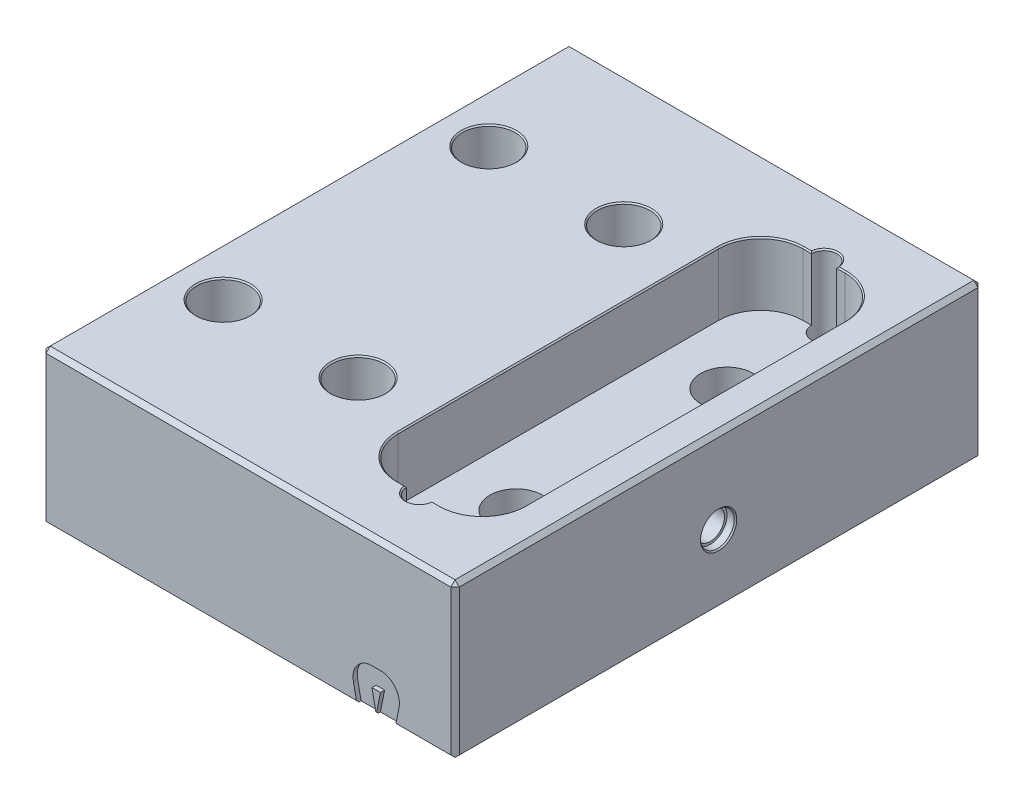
ISO-10303-21;
HEADER;
FILE_DESCRIPTION(('STEP AP214'),'2;1');
FILE_NAME('part.step','',(''),(''),'','','');
FILE_SCHEMA(('AUTOMOTIVE_DESIGN { 1 0 10303 214 1 1 1 1 }'));
ENDSEC;
DATA;
#1=APPLICATION_CONTEXT('core data for automotive mechanical design processes');
#2=APPLICATION_PROTOCOL_DEFINITION('international standard','automotive_design',2000,#1);
#3=PRODUCT_CONTEXT('',#1,'mechanical');
#4=PRODUCT('Part','Part','',(#3));
#5=PRODUCT_RELATED_PRODUCT_CATEGORY('part','',(#4));
#6=PRODUCT_DEFINITION_FORMATION('','',#4);
#7=PRODUCT_DEFINITION_CONTEXT('part definition',#1,'design');
#8=PRODUCT_DEFINITION('design','',#6,#7);
#9=PRODUCT_DEFINITION_SHAPE('','',#8);
#10=(LENGTH_UNIT() NAMED_UNIT(*) SI_UNIT(.MILLI.,.METRE.));
#11=(NAMED_UNIT(*) PLANE_ANGLE_UNIT() SI_UNIT($,.RADIAN.));
#12=(NAMED_UNIT(*) SI_UNIT($,.STERADIAN.) SOLID_ANGLE_UNIT());
#13=UNCERTAINTY_MEASURE_WITH_UNIT(LENGTH_MEASURE(1.E-05),#10,'distance_accuracy_value','');
#14=(GEOMETRIC_REPRESENTATION_CONTEXT(3) GLOBAL_UNCERTAINTY_ASSIGNED_CONTEXT((#13)) GLOBAL_UNIT_ASSIGNED_CONTEXT((#10,
#11,#12)) REPRESENTATION_CONTEXT('',''));
#15=CARTESIAN_POINT('',(0.,0.,0.));
#16=DIRECTION('',(0.,0.,1.));
#17=DIRECTION('',(1.,0.,0.));
#18=AXIS2_PLACEMENT_3D('',#15,#16,#17);
#19=CARTESIAN_POINT('',(-98.,36.,-62.5));
#20=DIRECTION('',(0.,0.,1.));
#21=DIRECTION('',(1.,0.,0.));
#22=AXIS2_PLACEMENT_3D('',#19,#20,#21);
#23=PLANE('',#22);
#24=DIRECTION('',(0.196116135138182,0.980580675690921,0.));
#25=VECTOR('',#24,1.);
#26=CARTESIAN_POINT('',(-13.2873869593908,4.11747739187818,-62.5));
#27=LINE('',#26,#25);
#28=CARTESIAN_POINT('',(-14.0108824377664,0.50000000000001,-62.5));
#29=VERTEX_POINT('',#28);
#30=CARTESIAN_POINT('',(-13.2873869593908,4.11747739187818,-62.5));
#31=VERTEX_POINT('',#30);
#32=EDGE_CURVE('E461',#29,#31,#27,.T.);
#33=ORIENTED_EDGE('',*,*,#32,.T.);
#34=CARTESIAN_POINT('',(-17.7,5.,-62.5));
#35=DIRECTION('',(0.,0.,1.));
#36=DIRECTION('',(1.,0.,0.));
#37=AXIS2_PLACEMENT_3D('',#34,#35,#36);
#38=CIRCLE('',#37,4.5);
#39=CARTESIAN_POINT('',(-17.7,9.5,-62.5));
#40=VERTEX_POINT('',#39);
#41=EDGE_CURVE('E478',#31,#40,#38,.T.);
#42=ORIENTED_EDGE('',*,*,#41,.T.);
#43=DIRECTION('',(-1.,0.,0.));
#44=VECTOR('',#43,1.);
#45=CARTESIAN_POINT('',(-19.7,9.5,-62.5));
#46=LINE('',#45,#44);
#47=CARTESIAN_POINT('',(-19.7,9.5,-62.5));
#48=VERTEX_POINT('',#47);
#49=EDGE_CURVE('E475',#40,#48,#46,.T.);
#50=ORIENTED_EDGE('',*,*,#49,.T.);
#51=CARTESIAN_POINT('',(-19.7,5.,-62.5));
#52=DIRECTION('',(0.,0.,1.));
#53=DIRECTION('',(-1.,0.,0.));
#54=AXIS2_PLACEMENT_3D('',#51,#52,#53);
#55=CIRCLE('',#54,4.5);
#56=CARTESIAN_POINT('',(-24.1126130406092,4.11747739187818,-62.5));
#57=VERTEX_POINT('',#56);
#58=EDGE_CURVE('E472',#48,#57,#55,.T.);
#59=ORIENTED_EDGE('',*,*,#58,.T.);
#60=DIRECTION('',(0.196116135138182,-0.980580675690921,0.));
#61=VECTOR('',#60,1.);
#62=CARTESIAN_POINT('',(-24.1126130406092,4.11747739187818,-62.5));
#63=LINE('',#62,#61);
#64=CARTESIAN_POINT('',(-23.3891175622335,0.5,-62.5));
#65=VERTEX_POINT('',#64);
#66=EDGE_CURVE('E456',#57,#65,#63,.T.);
#67=ORIENTED_EDGE('',*,*,#66,.T.);
#68=DIRECTION('',(-1.,0.,0.));
#69=VECTOR('',#68,1.);
#70=CARTESIAN_POINT('',(-98.,0.5,-62.5));
#71=LINE('',#70,#69);
#72=CARTESIAN_POINT('',(-97.,0.5,-62.5));
#73=VERTEX_POINT('',#72);
#74=EDGE_CURVE('E957',#65,#73,#71,.T.);
#75=ORIENTED_EDGE('',*,*,#74,.T.);
#76=DIRECTION('',(0.,1.,0.));
#77=VECTOR('',#76,1.);
#78=CARTESIAN_POINT('',(-97.,36.,-62.5));
#79=LINE('',#78,#77);
#80=CARTESIAN_POINT('',(-97.,35.,-62.5));
#81=VERTEX_POINT('',#80);
#82=EDGE_CURVE('E851',#73,#81,#79,.T.);
#83=ORIENTED_EDGE('',*,*,#82,.T.);
#84=DIRECTION('',(1.,0.,0.));
#85=VECTOR('',#84,1.);
#86=CARTESIAN_POINT('',(0.,35.,-62.5));
#87=LINE('',#86,#85);
#88=CARTESIAN_POINT('',(-1.,35.,-62.5));
#89=VERTEX_POINT('',#88);
#90=EDGE_CURVE('E846',#81,#89,#87,.T.);
#91=ORIENTED_EDGE('',*,*,#90,.T.);
#92=DIRECTION('',(0.,-1.,0.));
#93=VECTOR('',#92,1.);
#94=CARTESIAN_POINT('',(-1.,36.,-62.5));
#95=LINE('',#94,#93);
#96=CARTESIAN_POINT('',(-1.,0.5,-62.5));
#97=VERTEX_POINT('',#96);
#98=EDGE_CURVE('E848',#89,#97,#95,.T.);
#99=ORIENTED_EDGE('',*,*,#98,.T.);
#100=EDGE_CURVE('E958',#97,#29,#71,.T.);
#101=ORIENTED_EDGE('',*,*,#100,.T.);
#102=EDGE_LOOP('',(#33,#42,#50,#59,#67,#75,#83,#91,#99,#101));
#103=FACE_BOUND('',#102,.T.);
#104=ADVANCED_FACE('F14',(#103),#23,.F.);
#105=CARTESIAN_POINT('',(-98.,0.,62.5));
#106=DIRECTION('',(0.,1.,0.));
#107=DIRECTION('',(0.,0.,1.));
#108=AXIS2_PLACEMENT_3D('',#105,#106,#107);
#109=PLANE('',#108);
#110=CARTESIAN_POINT('',(-23.,0.,48.));
#111=DIRECTION('',(0.,-1.,0.));
#112=DIRECTION('',(0.,0.,-1.));
#113=AXIS2_PLACEMENT_3D('',#110,#111,#112);
#114=CIRCLE('',#113,4.6);
#115=CARTESIAN_POINT('',(-23.,0.,43.4));
#116=VERTEX_POINT('',#115);
#117=EDGE_CURVE('E655',#116,#116,#114,.T.);
#118=ORIENTED_EDGE('',*,*,#117,.F.);
#119=EDGE_LOOP('',(#118));
#120=FACE_BOUND('',#119,.T.);
#121=CARTESIAN_POINT('',(-23.,0.,-48.));
#122=DIRECTION('',(0.,-1.,0.));
#123=DIRECTION('',(0.,0.,-1.));
#124=AXIS2_PLACEMENT_3D('',#121,#122,#123);
#125=CIRCLE('',#124,4.6);
#126=CARTESIAN_POINT('',(-23.,0.,-52.6));
#127=VERTEX_POINT('',#126);
#128=EDGE_CURVE('E665',#127,#127,#125,.T.);
#129=ORIENTED_EDGE('',*,*,#128,.F.);
#130=EDGE_LOOP('',(#129));
#131=FACE_BOUND('',#130,.T.);
#132=CARTESIAN_POINT('',(-86.,0.,-31.5));
#133=DIRECTION('',(0.,1.,0.));
#134=DIRECTION('',(0.,0.,1.));
#135=AXIS2_PLACEMENT_3D('',#132,#133,#134);
#136=CIRCLE('',#135,6.55);
#137=CARTESIAN_POINT('',(-86.,0.,-24.95));
#138=VERTEX_POINT('',#137);
#139=EDGE_CURVE('E728',#138,#138,#136,.T.);
#140=ORIENTED_EDGE('',*,*,#139,.T.);
#141=EDGE_LOOP('',(#140));
#142=FACE_BOUND('',#141,.T.);
#143=CARTESIAN_POINT('',(-54.,0.,-31.5));
#144=DIRECTION('',(0.,1.,0.));
#145=DIRECTION('',(0.,0.,1.));
#146=AXIS2_PLACEMENT_3D('',#143,#144,#145);
#147=CIRCLE('',#146,6.55);
#148=CARTESIAN_POINT('',(-54.,0.,-24.95));
#149=VERTEX_POINT('',#148);
#150=EDGE_CURVE('E752',#149,#149,#147,.T.);
#151=ORIENTED_EDGE('',*,*,#150,.T.);
#152=EDGE_LOOP('',(#151));
#153=FACE_BOUND('',#152,.T.);
#154=CARTESIAN_POINT('',(-23.,0.,25.));
#155=DIRECTION('',(0.,-1.,0.));
#156=DIRECTION('',(0.,0.,-1.));
#157=AXIS2_PLACEMENT_3D('',#154,#155,#156);
#158=CIRCLE('',#157,10.3);
#159=CARTESIAN_POINT('',(-23.,0.,14.7));
#160=VERTEX_POINT('',#159);
#161=EDGE_CURVE('E755',#160,#160,#158,.T.);
#162=ORIENTED_EDGE('',*,*,#161,.F.);
#163=EDGE_LOOP('',(#162));
#164=FACE_BOUND('',#163,.T.);
#165=CARTESIAN_POINT('',(-23.,0.,-25.));
#166=DIRECTION('',(0.,-1.,0.));
#167=DIRECTION('',(0.,0.,-1.));
#168=AXIS2_PLACEMENT_3D('',#165,#166,#167);
#169=CIRCLE('',#168,10.3);
#170=CARTESIAN_POINT('',(-23.,0.,-35.3));
#171=VERTEX_POINT('',#170);
#172=EDGE_CURVE('E767',#171,#171,#169,.T.);
#173=ORIENTED_EDGE('',*,*,#172,.F.);
#174=EDGE_LOOP('',(#173));
#175=FACE_BOUND('',#174,.T.);
#176=DIRECTION('',(-1.,0.,0.));
#177=VECTOR('',#176,1.);
#178=CARTESIAN_POINT('',(-98.,0.,-61.5));
#179=LINE('',#178,#177);
#180=CARTESIAN_POINT('',(-14.1108824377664,0.,-61.5));
#181=VERTEX_POINT('',#180);
#182=CARTESIAN_POINT('',(-18.7,0.,-61.5));
#183=VERTEX_POINT('',#182);
#184=EDGE_CURVE('E9',#181,#183,#179,.T.);
#185=ORIENTED_EDGE('',*,*,#184,.F.);
#186=DIRECTION('',(0.,0.,1.));
#187=VECTOR('',#186,1.);
#188=CARTESIAN_POINT('',(-14.1108824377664,0.,62.5));
#189=LINE('',#188,#187);
#190=CARTESIAN_POINT('',(-14.1108824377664,0.,-62.));
#191=VERTEX_POINT('',#190);
#192=EDGE_CURVE('E491',#191,#181,#189,.T.);
#193=ORIENTED_EDGE('',*,*,#192,.F.);
#194=DIRECTION('',(1.,0.,0.));
#195=VECTOR('',#194,1.);
#196=CARTESIAN_POINT('',(-98.,0.,-62.));
#197=LINE('',#196,#195);
#198=CARTESIAN_POINT('',(-0.499999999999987,0.,-62.));
#199=VERTEX_POINT('',#198);
#200=EDGE_CURVE('E921',#191,#199,#197,.T.);
#201=ORIENTED_EDGE('',*,*,#200,.T.);
#202=DIRECTION('',(0.,0.,1.));
#203=VECTOR('',#202,1.);
#204=CARTESIAN_POINT('',(-0.499999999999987,0.,62.5));
#205=LINE('',#204,#203);
#206=CARTESIAN_POINT('',(-0.499999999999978,0.,62.));
#207=VERTEX_POINT('',#206);
#208=EDGE_CURVE('E919',#199,#207,#205,.T.);
#209=ORIENTED_EDGE('',*,*,#208,.T.);
#210=DIRECTION('',(-1.,0.,0.));
#211=VECTOR('',#210,1.);
#212=CARTESIAN_POINT('',(-98.,0.,62.));
#213=LINE('',#212,#211);
#214=CARTESIAN_POINT('',(-14.1108824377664,0.,62.));
#215=VERTEX_POINT('',#214);
#216=EDGE_CURVE('E929',#207,#215,#213,.T.);
#217=ORIENTED_EDGE('',*,*,#216,.T.);
#218=DIRECTION('',(0.,0.,-1.));
#219=VECTOR('',#218,1.);
#220=CARTESIAN_POINT('',(-14.1108824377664,0.,62.5));
#221=LINE('',#220,#219);
#222=CARTESIAN_POINT('',(-14.1108824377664,0.,61.5));
#223=VERTEX_POINT('',#222);
#224=EDGE_CURVE('E547',#215,#223,#221,.T.);
#225=ORIENTED_EDGE('',*,*,#224,.T.);
#226=DIRECTION('',(1.,0.,0.));
#227=VECTOR('',#226,1.);
#228=CARTESIAN_POINT('',(-98.,0.,61.5));
#229=LINE('',#228,#227);
#230=CARTESIAN_POINT('',(-18.7,0.,61.5));
#231=VERTEX_POINT('',#230);
#232=EDGE_CURVE('E1477',#231,#223,#229,.T.);
#233=ORIENTED_EDGE('',*,*,#232,.F.);
#234=CARTESIAN_POINT('',(-23.2891175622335,0.,61.5));
#235=VERTEX_POINT('',#234);
#236=EDGE_CURVE('E1476',#235,#231,#229,.T.);
#237=ORIENTED_EDGE('',*,*,#236,.F.);
#238=DIRECTION('',(0.,0.,1.));
#239=VECTOR('',#238,1.);
#240=CARTESIAN_POINT('',(-23.2891175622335,0.,62.5));
#241=LINE('',#240,#239);
#242=CARTESIAN_POINT('',(-23.2891175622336,0.,62.));
#243=VERTEX_POINT('',#242);
#244=EDGE_CURVE('E556',#235,#243,#241,.T.);
#245=ORIENTED_EDGE('',*,*,#244,.T.);
#246=CARTESIAN_POINT('',(-97.5,0.,62.));
#247=VERTEX_POINT('',#246);
#248=EDGE_CURVE('E928',#243,#247,#213,.T.);
#249=ORIENTED_EDGE('',*,*,#248,.T.);
#250=DIRECTION('',(0.,0.,-1.));
#251=VECTOR('',#250,1.);
#252=CARTESIAN_POINT('',(-97.5,0.,62.5));
#253=LINE('',#252,#251);
#254=CARTESIAN_POINT('',(-97.5,0.,41.8));
#255=VERTEX_POINT('',#254);
#256=EDGE_CURVE('E932',#247,#255,#253,.T.);
#257=ORIENTED_EDGE('',*,*,#256,.T.);
#258=DIRECTION('',(1.,0.,0.));
#259=VECTOR('',#258,1.);
#260=CARTESIAN_POINT('',(-98.,0.,41.8));
#261=LINE('',#260,#259);
#262=CARTESIAN_POINT('',(-41.5,0.,41.8));
#263=VERTEX_POINT('',#262);
#264=EDGE_CURVE('E795',#255,#263,#261,.T.);
#265=ORIENTED_EDGE('',*,*,#264,.T.);
#266=CARTESIAN_POINT('',(-41.5,0.,36.));
#267=DIRECTION('',(0.,1.,0.));
#268=DIRECTION('',(0.,0.,1.));
#269=AXIS2_PLACEMENT_3D('',#266,#267,#268);
#270=CIRCLE('',#269,5.8);
#271=CARTESIAN_POINT('',(-35.7,0.,36.));
#272=VERTEX_POINT('',#271);
#273=EDGE_CURVE('E793',#263,#272,#270,.T.);
#274=ORIENTED_EDGE('',*,*,#273,.T.);
#275=DIRECTION('',(0.,0.,-1.));
#276=VECTOR('',#275,1.);
#277=CARTESIAN_POINT('',(-35.7,0.,62.5));
#278=LINE('',#277,#276);
#279=CARTESIAN_POINT('',(-35.7,0.,27.));
#280=VERTEX_POINT('',#279);
#281=EDGE_CURVE('E791',#272,#280,#278,.T.);
#282=ORIENTED_EDGE('',*,*,#281,.T.);
#283=CARTESIAN_POINT('',(-41.5,0.,27.));
#284=DIRECTION('',(0.,1.,0.));
#285=DIRECTION('',(0.,0.,1.));
#286=AXIS2_PLACEMENT_3D('',#283,#284,#285);
#287=CIRCLE('',#286,5.8);
#288=CARTESIAN_POINT('',(-41.5,0.,21.2));
#289=VERTEX_POINT('',#288);
#290=EDGE_CURVE('E789',#280,#289,#287,.T.);
#291=ORIENTED_EDGE('',*,*,#290,.T.);
#292=DIRECTION('',(-1.,0.,0.));
#293=VECTOR('',#292,1.);
#294=CARTESIAN_POINT('',(-98.,0.,21.2));
#295=LINE('',#294,#293);
#296=CARTESIAN_POINT('',(-97.5,0.,21.2));
#297=VERTEX_POINT('',#296);
#298=EDGE_CURVE('E786',#289,#297,#295,.T.);
#299=ORIENTED_EDGE('',*,*,#298,.T.);
#300=DIRECTION('',(0.,0.,-1.));
#301=VECTOR('',#300,1.);
#302=CARTESIAN_POINT('',(-97.5,0.,62.5));
#303=LINE('',#302,#301);
#304=CARTESIAN_POINT('',(-97.5,0.,-62.));
#305=VERTEX_POINT('',#304);
#306=EDGE_CURVE('E925',#297,#305,#303,.T.);
#307=ORIENTED_EDGE('',*,*,#306,.T.);
#308=CARTESIAN_POINT('',(-23.2891175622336,0.,-62.));
#309=VERTEX_POINT('',#308);
#310=EDGE_CURVE('E922',#305,#309,#197,.T.);
#311=ORIENTED_EDGE('',*,*,#310,.T.);
#312=DIRECTION('',(0.,0.,-1.));
#313=VECTOR('',#312,1.);
#314=CARTESIAN_POINT('',(-23.2891175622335,0.,62.5));
#315=LINE('',#314,#313);
#316=CARTESIAN_POINT('',(-23.2891175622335,0.,-61.5));
#317=VERTEX_POINT('',#316);
#318=EDGE_CURVE('E37',#317,#309,#315,.T.);
#319=ORIENTED_EDGE('',*,*,#318,.F.);
#320=EDGE_CURVE('E18',#183,#317,#179,.T.);
#321=ORIENTED_EDGE('',*,*,#320,.F.);
#322=EDGE_LOOP('',(#185,#193,#201,#209,#217,#225,#233,#237,#245,#249,#257,#265,#274,#282,#291,
#299,#307,#311,#319,#321));
#323=FACE_BOUND('',#322,.T.);
#324=ADVANCED_FACE('F1117',(#120,#131,#142,#153,#164,#175,#323),#109,.F.);
#325=CARTESIAN_POINT('',(-98.,0.5,-62.5));
#326=DIRECTION('',(0.,0.707106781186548,0.707106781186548));
#327=DIRECTION('',(0.,-0.707106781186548,0.707106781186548));
#328=AXIS2_PLACEMENT_3D('',#325,#326,#327);
#329=PLANE('',#328);
#330=ORIENTED_EDGE('',*,*,#200,.F.);
#331=DIRECTION('',(-0.140028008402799,-0.700140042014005,0.700140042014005));
#332=VECTOR('',#331,1.);
#333=CARTESIAN_POINT('',(-15.6577278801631,-7.73422721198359,-54.2657727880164));
#334=LINE('',#333,#332);
#335=EDGE_CURVE('E1463',#191,#29,#334,.F.);
#336=ORIENTED_EDGE('',*,*,#335,.T.);
#337=ORIENTED_EDGE('',*,*,#100,.F.);
#338=DIRECTION('',(-0.577350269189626,0.577350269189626,-0.577350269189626));
#339=VECTOR('',#338,1.);
#340=CARTESIAN_POINT('',(-12.8333333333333,12.3333333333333,-74.3333333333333));
#341=LINE('',#340,#339);
#342=EDGE_CURVE('E965',#199,#97,#341,.T.);
#343=ORIENTED_EDGE('',*,*,#342,.F.);
#344=EDGE_LOOP('',(#330,#336,#337,#343));
#345=FACE_BOUND('',#344,.T.);
#346=ADVANCED_FACE('F1120',(#345),#329,.F.);
#347=ORIENTED_EDGE('',*,*,#74,.F.);
#348=DIRECTION('',(-0.140028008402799,0.700140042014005,-0.700140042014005));
#349=VECTOR('',#348,1.);
#350=CARTESIAN_POINT('',(-24.8520760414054,7.81479239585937,-69.8147923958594));
#351=LINE('',#350,#349);
#352=EDGE_CURVE('E1469',#65,#309,#351,.F.);
#353=ORIENTED_EDGE('',*,*,#352,.T.);
#354=ORIENTED_EDGE('',*,*,#310,.F.);
#355=DIRECTION('',(-0.577350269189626,-0.577350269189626,0.577350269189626));
#356=VECTOR('',#355,1.);
#357=CARTESIAN_POINT('',(-85.8333333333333,11.6666666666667,-73.6666666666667));
#358=LINE('',#357,#356);
#359=EDGE_CURVE('E953',#73,#305,#358,.T.);
#360=ORIENTED_EDGE('',*,*,#359,.F.);
#361=EDGE_LOOP('',(#347,#353,#354,#360));
#362=FACE_BOUND('',#361,.T.);
#363=ADVANCED_FACE('F1233',(#362),#329,.F.);
#364=CARTESIAN_POINT('',(-98.,0.5,62.5));
#365=DIRECTION('',(0.,0.707106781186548,-0.707106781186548));
#366=DIRECTION('',(0.,0.707106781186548,0.707106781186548));
#367=AXIS2_PLACEMENT_3D('',#364,#365,#366);
#368=PLANE('',#367);
#369=DIRECTION('',(-0.140028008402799,-0.700140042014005,-0.700140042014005));
#370=VECTOR('',#369,1.);
#371=CARTESIAN_POINT('',(-15.6577278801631,-7.73422721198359,54.2657727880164));
#372=LINE('',#371,#370);
#373=CARTESIAN_POINT('',(-14.0108824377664,0.5,62.5));
#374=VERTEX_POINT('',#373);
#375=EDGE_CURVE('E1481',#215,#374,#372,.F.);
#376=ORIENTED_EDGE('',*,*,#375,.F.);
#377=ORIENTED_EDGE('',*,*,#216,.F.);
#378=DIRECTION('',(0.577350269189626,-0.577350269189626,-0.577350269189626));
#379=VECTOR('',#378,1.);
#380=CARTESIAN_POINT('',(-12.1666666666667,11.6666666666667,73.6666666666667));
#381=LINE('',#380,#379);
#382=CARTESIAN_POINT('',(-1.,0.5,62.5));
#383=VERTEX_POINT('',#382);
#384=EDGE_CURVE('E916',#383,#207,#381,.T.);
#385=ORIENTED_EDGE('',*,*,#384,.F.);
#386=DIRECTION('',(1.,0.,0.));
#387=VECTOR('',#386,1.);
#388=CARTESIAN_POINT('',(-98.,0.5,62.5));
#389=LINE('',#388,#387);
#390=EDGE_CURVE('E876',#374,#383,#389,.T.);
#391=ORIENTED_EDGE('',*,*,#390,.F.);
#392=EDGE_LOOP('',(#376,#377,#385,#391));
#393=FACE_BOUND('',#392,.T.);
#394=ADVANCED_FACE('F1067',(#393),#368,.F.);
#395=CARTESIAN_POINT('',(-54.,36.,31.5));
#396=DIRECTION('',(0.,1.,0.));
#397=DIRECTION('',(0.,0.,1.));
#398=AXIS2_PLACEMENT_3D('',#395,#396,#397);
#399=CYLINDRICAL_SURFACE('',#398,6.25);
#400=CARTESIAN_POINT('',(-54.,35.7,31.5));
#401=DIRECTION('',(0.,1.,0.));
#402=DIRECTION('',(0.,0.,1.));
#403=AXIS2_PLACEMENT_3D('',#400,#401,#402);
#404=CIRCLE('',#403,6.25);
#405=CARTESIAN_POINT('',(-54.,35.7,37.75));
#406=VERTEX_POINT('',#405);
#407=EDGE_CURVE('E740',#406,#406,#404,.T.);
#408=ORIENTED_EDGE('',*,*,#407,.T.);
#409=EDGE_LOOP('',(#408));
#410=FACE_BOUND('',#409,.T.);
#411=CARTESIAN_POINT('',(-54.,6.,31.5));
#412=DIRECTION('',(0.,-1.,0.));
#413=DIRECTION('',(0.,0.,-1.));
#414=AXIS2_PLACEMENT_3D('',#411,#412,#413);
#415=CIRCLE('',#414,6.25);
#416=CARTESIAN_POINT('',(-54.,6.,25.25));
#417=VERTEX_POINT('',#416);
#418=EDGE_CURVE('E716',#417,#417,#415,.F.);
#419=ORIENTED_EDGE('',*,*,#418,.F.);
#420=EDGE_LOOP('',(#419));
#421=FACE_BOUND('',#420,.T.);
#422=ADVANCED_FACE('F1059',(#410,#421),#399,.F.);
#423=CARTESIAN_POINT('',(-86.,36.,31.5));
#424=DIRECTION('',(0.,1.,0.));
#425=DIRECTION('',(0.,0.,1.));
#426=AXIS2_PLACEMENT_3D('',#423,#424,#425);
#427=CYLINDRICAL_SURFACE('',#426,6.25);
#428=CARTESIAN_POINT('',(-86.,35.7,31.5));
#429=DIRECTION('',(0.,1.,0.));
#430=DIRECTION('',(0.,0.,1.));
#431=AXIS2_PLACEMENT_3D('',#428,#429,#430);
#432=CIRCLE('',#431,6.25);
#433=CARTESIAN_POINT('',(-86.,35.7,37.75));
#434=VERTEX_POINT('',#433);
#435=EDGE_CURVE('E734',#434,#434,#432,.T.);
#436=ORIENTED_EDGE('',*,*,#435,.T.);
#437=EDGE_LOOP('',(#436));
#438=FACE_BOUND('',#437,.T.);
#439=CARTESIAN_POINT('',(-86.,6.,31.5));
#440=DIRECTION('',(0.,-1.,0.));
#441=DIRECTION('',(0.,0.,-1.));
#442=AXIS2_PLACEMENT_3D('',#439,#440,#441);
#443=CIRCLE('',#442,6.25);
#444=CARTESIAN_POINT('',(-86.,6.,25.25));
#445=VERTEX_POINT('',#444);
#446=EDGE_CURVE('E707',#445,#445,#443,.F.);
#447=ORIENTED_EDGE('',*,*,#446,.F.);
#448=EDGE_LOOP('',(#447));
#449=FACE_BOUND('',#448,.T.);
#450=ADVANCED_FACE('F1055',(#438,#449),#427,.F.);
#451=CARTESIAN_POINT('',(-98.,36.,-62.5));
#452=DIRECTION('',(1.,0.,0.));
#453=DIRECTION('',(0.,0.,-1.));
#454=AXIS2_PLACEMENT_3D('',#451,#452,#453);
#455=PLANE('',#454);
#456=CARTESIAN_POINT('',(-98.,16.,0.));
#457=DIRECTION('',(1.,0.,0.));
#458=DIRECTION('',(0.,0.,-1.));
#459=AXIS2_PLACEMENT_3D('',#456,#457,#458);
#460=CIRCLE('',#459,4.3);
#461=CARTESIAN_POINT('',(-98.,16.,-4.3));
#462=VERTEX_POINT('',#461);
#463=EDGE_CURVE('E1495',#462,#462,#460,.T.);
#464=ORIENTED_EDGE('',*,*,#463,.T.);
#465=EDGE_LOOP('',(#464));
#466=FACE_BOUND('',#465,.T.);
#467=DIRECTION('',(0.,-1.,0.));
#468=VECTOR('',#467,1.);
#469=CARTESIAN_POINT('',(-98.,36.,41.8));
#470=LINE('',#469,#468);
#471=CARTESIAN_POINT('',(-98.,6.3,41.8));
#472=VERTEX_POINT('',#471);
#473=CARTESIAN_POINT('',(-98.,0.50000000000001,41.8));
#474=VERTEX_POINT('',#473);
#475=EDGE_CURVE('E807',#472,#474,#470,.T.);
#476=ORIENTED_EDGE('',*,*,#475,.T.);
#477=DIRECTION('',(0.,0.,1.));
#478=VECTOR('',#477,1.);
#479=CARTESIAN_POINT('',(-98.,0.5,-62.5));
#480=LINE('',#479,#478);
#481=CARTESIAN_POINT('',(-98.,0.5,61.5));
#482=VERTEX_POINT('',#481);
#483=EDGE_CURVE('E942',#474,#482,#480,.T.);
#484=ORIENTED_EDGE('',*,*,#483,.T.);
#485=DIRECTION('',(0.,1.,0.));
#486=VECTOR('',#485,1.);
#487=CARTESIAN_POINT('',(-98.,36.,61.5));
#488=LINE('',#487,#486);
#489=CARTESIAN_POINT('',(-98.,35.,61.5));
#490=VERTEX_POINT('',#489);
#491=EDGE_CURVE('E841',#482,#490,#488,.T.);
#492=ORIENTED_EDGE('',*,*,#491,.T.);
#493=DIRECTION('',(0.,0.,-1.));
#494=VECTOR('',#493,1.);
#495=CARTESIAN_POINT('',(-98.,35.,-62.5));
#496=LINE('',#495,#494);
#497=CARTESIAN_POINT('',(-98.,35.,-61.5));
#498=VERTEX_POINT('',#497);
#499=EDGE_CURVE('E817',#490,#498,#496,.T.);
#500=ORIENTED_EDGE('',*,*,#499,.T.);
#501=DIRECTION('',(0.,-1.,0.));
#502=VECTOR('',#501,1.);
#503=CARTESIAN_POINT('',(-98.,36.,-61.5));
#504=LINE('',#503,#502);
#505=CARTESIAN_POINT('',(-98.,0.5,-61.5));
#506=VERTEX_POINT('',#505);
#507=EDGE_CURVE('E843',#498,#506,#504,.T.);
#508=ORIENTED_EDGE('',*,*,#507,.T.);
#509=DIRECTION('',(0.,0.,1.));
#510=VECTOR('',#509,1.);
#511=CARTESIAN_POINT('',(-98.,0.5,-62.5));
#512=LINE('',#511,#510);
#513=CARTESIAN_POINT('',(-98.,0.5,21.2));
#514=VERTEX_POINT('',#513);
#515=EDGE_CURVE('E939',#506,#514,#512,.T.);
#516=ORIENTED_EDGE('',*,*,#515,.T.);
#517=DIRECTION('',(0.,1.,0.));
#518=VECTOR('',#517,1.);
#519=CARTESIAN_POINT('',(-98.,36.,21.2));
#520=LINE('',#519,#518);
#521=CARTESIAN_POINT('',(-98.,6.3,21.2));
#522=VERTEX_POINT('',#521);
#523=EDGE_CURVE('E803',#514,#522,#520,.T.);
#524=ORIENTED_EDGE('',*,*,#523,.T.);
#525=DIRECTION('',(0.,0.,1.));
#526=VECTOR('',#525,1.);
#527=CARTESIAN_POINT('',(-98.,6.3,41.5));
#528=LINE('',#527,#526);
#529=EDGE_CURVE('E805',#522,#472,#528,.T.);
#530=ORIENTED_EDGE('',*,*,#529,.T.);
#531=EDGE_LOOP('',(#476,#484,#492,#500,#508,#516,#524,#530));
#532=FACE_BOUND('',#531,.T.);
#533=ADVANCED_FACE('F1058',(#466,#532),#455,.F.);
#534=CARTESIAN_POINT('',(-98.,36.,62.5));
#535=DIRECTION('',(0.,0.,-1.));
#536=DIRECTION('',(-1.,0.,0.));
#537=AXIS2_PLACEMENT_3D('',#534,#535,#536);
#538=PLANE('',#537);
#539=CARTESIAN_POINT('',(-97.,0.5,62.5));
#540=VERTEX_POINT('',#539);
#541=CARTESIAN_POINT('',(-23.3891175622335,0.5,62.5));
#542=VERTEX_POINT('',#541);
#543=EDGE_CURVE('E910',#540,#542,#389,.T.);
#544=ORIENTED_EDGE('',*,*,#543,.T.);
#545=DIRECTION('',(0.196116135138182,-0.980580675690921,0.));
#546=VECTOR('',#545,1.);
#547=CARTESIAN_POINT('',(-24.1126130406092,4.11747739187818,62.5));
#548=LINE('',#547,#546);
#549=CARTESIAN_POINT('',(-24.1126130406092,4.11747739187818,62.5));
#550=VERTEX_POINT('',#549);
#551=EDGE_CURVE('E521',#550,#542,#548,.T.);
#552=ORIENTED_EDGE('',*,*,#551,.F.);
#553=CARTESIAN_POINT('',(-19.7,5.,62.5));
#554=DIRECTION('',(0.,0.,1.));
#555=DIRECTION('',(-1.,0.,0.));
#556=AXIS2_PLACEMENT_3D('',#553,#554,#555);
#557=CIRCLE('',#556,4.5);
#558=CARTESIAN_POINT('',(-19.7,9.5,62.5));
#559=VERTEX_POINT('',#558);
#560=EDGE_CURVE('E541',#559,#550,#557,.T.);
#561=ORIENTED_EDGE('',*,*,#560,.F.);
#562=DIRECTION('',(-1.,0.,0.));
#563=VECTOR('',#562,1.);
#564=CARTESIAN_POINT('',(-19.7,9.5,62.5));
#565=LINE('',#564,#563);
#566=CARTESIAN_POINT('',(-17.7,9.5,62.5));
#567=VERTEX_POINT('',#566);
#568=EDGE_CURVE('E538',#567,#559,#565,.T.);
#569=ORIENTED_EDGE('',*,*,#568,.F.);
#570=CARTESIAN_POINT('',(-17.7,5.,62.5));
#571=DIRECTION('',(0.,0.,1.));
#572=DIRECTION('',(1.,0.,0.));
#573=AXIS2_PLACEMENT_3D('',#570,#571,#572);
#574=CIRCLE('',#573,4.5);
#575=CARTESIAN_POINT('',(-13.2873869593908,4.11747739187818,62.5));
#576=VERTEX_POINT('',#575);
#577=EDGE_CURVE('E535',#576,#567,#574,.T.);
#578=ORIENTED_EDGE('',*,*,#577,.F.);
#579=DIRECTION('',(0.196116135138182,0.980580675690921,0.));
#580=VECTOR('',#579,1.);
#581=CARTESIAN_POINT('',(-13.2873869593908,4.11747739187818,62.5));
#582=LINE('',#581,#580);
#583=EDGE_CURVE('E514',#374,#576,#582,.T.);
#584=ORIENTED_EDGE('',*,*,#583,.F.);
#585=ORIENTED_EDGE('',*,*,#390,.T.);
#586=DIRECTION('',(0.,1.,0.));
#587=VECTOR('',#586,1.);
#588=CARTESIAN_POINT('',(-1.,36.,62.5));
#589=LINE('',#588,#587);
#590=CARTESIAN_POINT('',(-1.,35.,62.5));
#591=VERTEX_POINT('',#590);
#592=EDGE_CURVE('E874',#383,#591,#589,.T.);
#593=ORIENTED_EDGE('',*,*,#592,.T.);
#594=DIRECTION('',(-1.,0.,0.));
#595=VECTOR('',#594,1.);
#596=CARTESIAN_POINT('',(-98.,35.,62.5));
#597=LINE('',#596,#595);
#598=CARTESIAN_POINT('',(-97.,35.,62.5));
#599=VERTEX_POINT('',#598);
#600=EDGE_CURVE('E869',#591,#599,#597,.T.);
#601=ORIENTED_EDGE('',*,*,#600,.T.);
#602=DIRECTION('',(0.,-1.,0.));
#603=VECTOR('',#602,1.);
#604=CARTESIAN_POINT('',(-97.,36.,62.5));
#605=LINE('',#604,#603);
#606=EDGE_CURVE('E871',#599,#540,#605,.T.);
#607=ORIENTED_EDGE('',*,*,#606,.T.);
#608=EDGE_LOOP('',(#544,#552,#561,#569,#578,#584,#585,#593,#601,#607));
#609=FACE_BOUND('',#608,.T.);
#610=ADVANCED_FACE('F1129',(#609),#538,.F.);
#611=CARTESIAN_POINT('',(0.,36.,-62.5));
#612=DIRECTION('',(-1.,0.,0.));
#613=DIRECTION('',(0.,0.,1.));
#614=AXIS2_PLACEMENT_3D('',#611,#612,#613);
#615=PLANE('',#614);
#616=CARTESIAN_POINT('',(0.,16.,0.));
#617=DIRECTION('',(-1.,0.,0.));
#618=DIRECTION('',(0.,0.,1.));
#619=AXIS2_PLACEMENT_3D('',#616,#617,#618);
#620=CIRCLE('',#619,4.3);
#621=CARTESIAN_POINT('',(0.,16.,4.3));
#622=VERTEX_POINT('',#621);
#623=EDGE_CURVE('E1489',#622,#622,#620,.T.);
#624=ORIENTED_EDGE('',*,*,#623,.T.);
#625=EDGE_LOOP('',(#624));
#626=FACE_BOUND('',#625,.T.);
#627=DIRECTION('',(0.,-1.,0.));
#628=VECTOR('',#627,1.);
#629=CARTESIAN_POINT('',(0.,36.,61.5));
#630=LINE('',#629,#628);
#631=CARTESIAN_POINT('',(0.,35.,61.5));
#632=VERTEX_POINT('',#631);
#633=CARTESIAN_POINT('',(0.,0.5,61.5));
#634=VERTEX_POINT('',#633);
#635=EDGE_CURVE('E855',#632,#634,#630,.T.);
#636=ORIENTED_EDGE('',*,*,#635,.T.);
#637=DIRECTION('',(0.,0.,-1.));
#638=VECTOR('',#637,1.);
#639=CARTESIAN_POINT('',(0.,0.5,-62.5));
#640=LINE('',#639,#638);
#641=CARTESIAN_POINT('',(0.,0.5,-61.5));
#642=VERTEX_POINT('',#641);
#643=EDGE_CURVE('E967',#634,#642,#640,.T.);
#644=ORIENTED_EDGE('',*,*,#643,.T.);
#645=DIRECTION('',(0.,1.,0.));
#646=VECTOR('',#645,1.);
#647=CARTESIAN_POINT('',(0.,36.,-61.5));
#648=LINE('',#647,#646);
#649=CARTESIAN_POINT('',(0.,35.,-61.5));
#650=VERTEX_POINT('',#649);
#651=EDGE_CURVE('E858',#642,#650,#648,.T.);
#652=ORIENTED_EDGE('',*,*,#651,.T.);
#653=DIRECTION('',(0.,0.,1.));
#654=VECTOR('',#653,1.);
#655=CARTESIAN_POINT('',(0.,35.,62.5));
#656=LINE('',#655,#654);
#657=EDGE_CURVE('E853',#650,#632,#656,.T.);
#658=ORIENTED_EDGE('',*,*,#657,.T.);
#659=EDGE_LOOP('',(#636,#644,#652,#658));
#660=FACE_BOUND('',#659,.T.);
#661=ADVANCED_FACE('F1115',(#626,#660),#615,.F.);
#662=CARTESIAN_POINT('',(-98.,36.,62.5));
#663=DIRECTION('',(0.,1.,0.));
#664=DIRECTION('',(0.,0.,1.));
#665=AXIS2_PLACEMENT_3D('',#662,#663,#664);
#666=PLANE('',#665);
#667=CARTESIAN_POINT('',(-23.,36.,48.));
#668=DIRECTION('',(0.,1.,0.));
#669=DIRECTION('',(0.,0.,1.));
#670=AXIS2_PLACEMENT_3D('',#667,#668,#669);
#671=CIRCLE('',#670,3.3);
#672=CARTESIAN_POINT('',(-26.286335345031,36.,48.3));
#673=VERTEX_POINT('',#672);
#674=CARTESIAN_POINT('',(-19.713664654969,36.,48.3));
#675=VERTEX_POINT('',#674);
#676=EDGE_CURVE('E681',#673,#675,#671,.T.);
#677=ORIENTED_EDGE('',*,*,#676,.F.);
#678=DIRECTION('',(-1.,0.,0.));
#679=VECTOR('',#678,1.);
#680=CARTESIAN_POINT('',(-28.,36.,48.3));
#681=LINE('',#680,#679);
#682=CARTESIAN_POINT('',(-28.,36.,48.3));
#683=VERTEX_POINT('',#682);
#684=EDGE_CURVE('E1551',#673,#683,#681,.T.);
#685=ORIENTED_EDGE('',*,*,#684,.T.);
#686=CARTESIAN_POINT('',(-28.,36.,38.));
#687=DIRECTION('',(0.,1.,0.));
#688=DIRECTION('',(0.,0.,1.));
#689=AXIS2_PLACEMENT_3D('',#686,#687,#688);
#690=CIRCLE('',#689,10.3);
#691=CARTESIAN_POINT('',(-38.3,36.,38.));
#692=VERTEX_POINT('',#691);
#693=EDGE_CURVE('E1553',#683,#692,#690,.F.);
#694=ORIENTED_EDGE('',*,*,#693,.T.);
#695=DIRECTION('',(0.,0.,-1.));
#696=VECTOR('',#695,1.);
#697=CARTESIAN_POINT('',(-38.3,36.,-38.));
#698=LINE('',#697,#696);
#699=CARTESIAN_POINT('',(-38.3,36.,-38.));
#700=VERTEX_POINT('',#699);
#701=EDGE_CURVE('E1546',#692,#700,#698,.T.);
#702=ORIENTED_EDGE('',*,*,#701,.T.);
#703=CARTESIAN_POINT('',(-28.,36.,-38.));
#704=DIRECTION('',(0.,1.,0.));
#705=DIRECTION('',(0.,0.,1.));
#706=AXIS2_PLACEMENT_3D('',#703,#704,#705);
#707=CIRCLE('',#706,10.3);
#708=CARTESIAN_POINT('',(-28.,36.,-48.3));
#709=VERTEX_POINT('',#708);
#710=EDGE_CURVE('E1560',#700,#709,#707,.F.);
#711=ORIENTED_EDGE('',*,*,#710,.T.);
#712=DIRECTION('',(1.,0.,0.));
#713=VECTOR('',#712,1.);
#714=CARTESIAN_POINT('',(-26.3,36.,-48.3));
#715=LINE('',#714,#713);
#716=CARTESIAN_POINT('',(-26.286335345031,36.,-48.3));
#717=VERTEX_POINT('',#716);
#718=EDGE_CURVE('E1557',#709,#717,#715,.T.);
#719=ORIENTED_EDGE('',*,*,#718,.T.);
#720=CARTESIAN_POINT('',(-23.,36.,-48.));
#721=DIRECTION('',(0.,1.,0.));
#722=DIRECTION('',(0.,0.,1.));
#723=AXIS2_PLACEMENT_3D('',#720,#721,#722);
#724=CIRCLE('',#723,3.3);
#725=CARTESIAN_POINT('',(-19.713664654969,36.,-48.3));
#726=VERTEX_POINT('',#725);
#727=EDGE_CURVE('E675',#726,#717,#724,.T.);
#728=ORIENTED_EDGE('',*,*,#727,.F.);
#729=DIRECTION('',(1.,0.,0.));
#730=VECTOR('',#729,1.);
#731=CARTESIAN_POINT('',(-18.,36.,-48.3));
#732=LINE('',#731,#730);
#733=CARTESIAN_POINT('',(-18.,36.,-48.3));
#734=VERTEX_POINT('',#733);
#735=EDGE_CURVE('E1564',#726,#734,#732,.T.);
#736=ORIENTED_EDGE('',*,*,#735,.T.);
#737=CARTESIAN_POINT('',(-18.,36.,-38.));
#738=DIRECTION('',(0.,1.,0.));
#739=DIRECTION('',(0.,0.,1.));
#740=AXIS2_PLACEMENT_3D('',#737,#738,#739);
#741=CIRCLE('',#740,10.3);
#742=CARTESIAN_POINT('',(-7.7,36.,-38.));
#743=VERTEX_POINT('',#742);
#744=EDGE_CURVE('E1568',#734,#743,#741,.F.);
#745=ORIENTED_EDGE('',*,*,#744,.T.);
#746=DIRECTION('',(0.,0.,1.));
#747=VECTOR('',#746,1.);
#748=CARTESIAN_POINT('',(-7.7,36.,38.));
#749=LINE('',#748,#747);
#750=CARTESIAN_POINT('',(-7.7,36.,38.));
#751=VERTEX_POINT('',#750);
#752=EDGE_CURVE('E1569',#743,#751,#749,.T.);
#753=ORIENTED_EDGE('',*,*,#752,.T.);
#754=CARTESIAN_POINT('',(-18.,36.,38.));
#755=DIRECTION('',(0.,1.,0.));
#756=DIRECTION('',(0.,0.,1.));
#757=AXIS2_PLACEMENT_3D('',#754,#755,#756);
#758=CIRCLE('',#757,10.3);
#759=CARTESIAN_POINT('',(-18.,36.,48.3));
#760=VERTEX_POINT('',#759);
#761=EDGE_CURVE('E1566',#751,#760,#758,.F.);
#762=ORIENTED_EDGE('',*,*,#761,.T.);
#763=DIRECTION('',(-1.,0.,0.));
#764=VECTOR('',#763,1.);
#765=CARTESIAN_POINT('',(-19.7,36.,48.3));
#766=LINE('',#765,#764);
#767=EDGE_CURVE('E1562',#760,#675,#766,.T.);
#768=ORIENTED_EDGE('',*,*,#767,.T.);
#769=EDGE_LOOP('',(#677,#685,#694,#702,#711,#719,#728,#736,#745,#753,#762,#768));
#770=FACE_BOUND('',#769,.T.);
#771=DIRECTION('',(0.,0.,-1.));
#772=VECTOR('',#771,1.);
#773=CARTESIAN_POINT('',(-1.,36.,-62.5));
#774=LINE('',#773,#772);
#775=CARTESIAN_POINT('',(-1.,36.,61.5));
#776=VERTEX_POINT('',#775);
#777=CARTESIAN_POINT('',(-1.,36.,-61.5));
#778=VERTEX_POINT('',#777);
#779=EDGE_CURVE('E860',#776,#778,#774,.T.);
#780=ORIENTED_EDGE('',*,*,#779,.T.);
#781=DIRECTION('',(-1.,0.,0.));
#782=VECTOR('',#781,1.);
#783=CARTESIAN_POINT('',(-98.,36.,-61.5));
#784=LINE('',#783,#782);
#785=CARTESIAN_POINT('',(-97.,36.,-61.5));
#786=VERTEX_POINT('',#785);
#787=EDGE_CURVE('E866',#778,#786,#784,.T.);
#788=ORIENTED_EDGE('',*,*,#787,.T.);
#789=DIRECTION('',(0.,0.,1.));
#790=VECTOR('',#789,1.);
#791=CARTESIAN_POINT('',(-97.,36.,62.5));
#792=LINE('',#791,#790);
#793=CARTESIAN_POINT('',(-97.,36.,61.5));
#794=VERTEX_POINT('',#793);
#795=EDGE_CURVE('E864',#786,#794,#792,.T.);
#796=ORIENTED_EDGE('',*,*,#795,.T.);
#797=DIRECTION('',(1.,0.,0.));
#798=VECTOR('',#797,1.);
#799=CARTESIAN_POINT('',(0.,36.,61.5));
#800=LINE('',#799,#798);
#801=EDGE_CURVE('E862',#794,#776,#800,.T.);
#802=ORIENTED_EDGE('',*,*,#801,.T.);
#803=EDGE_LOOP('',(#780,#788,#796,#802));
#804=FACE_BOUND('',#803,.T.);
#805=CARTESIAN_POINT('',(-86.,36.,-31.5));
#806=DIRECTION('',(0.,1.,0.));
#807=DIRECTION('',(0.,0.,1.));
#808=AXIS2_PLACEMENT_3D('',#805,#806,#807);
#809=CIRCLE('',#808,6.55);
#810=CARTESIAN_POINT('',(-86.,36.,-24.95));
#811=VERTEX_POINT('',#810);
#812=EDGE_CURVE('E719',#811,#811,#809,.T.);
#813=ORIENTED_EDGE('',*,*,#812,.F.);
#814=EDGE_LOOP('',(#813));
#815=FACE_BOUND('',#814,.T.);
#816=CARTESIAN_POINT('',(-86.,36.,31.5));
#817=DIRECTION('',(0.,1.,0.));
#818=DIRECTION('',(0.,0.,1.));
#819=AXIS2_PLACEMENT_3D('',#816,#817,#818);
#820=CIRCLE('',#819,6.55);
#821=CARTESIAN_POINT('',(-86.,36.,38.05));
#822=VERTEX_POINT('',#821);
#823=EDGE_CURVE('E731',#822,#822,#820,.T.);
#824=ORIENTED_EDGE('',*,*,#823,.F.);
#825=EDGE_LOOP('',(#824));
#826=FACE_BOUND('',#825,.T.);
#827=CARTESIAN_POINT('',(-54.,36.,31.5));
#828=DIRECTION('',(0.,1.,0.));
#829=DIRECTION('',(0.,0.,1.));
#830=AXIS2_PLACEMENT_3D('',#827,#828,#829);
#831=CIRCLE('',#830,6.55);
#832=CARTESIAN_POINT('',(-54.,36.,38.05));
#833=VERTEX_POINT('',#832);
#834=EDGE_CURVE('E737',#833,#833,#831,.T.);
#835=ORIENTED_EDGE('',*,*,#834,.F.);
#836=EDGE_LOOP('',(#835));
#837=FACE_BOUND('',#836,.T.);
#838=CARTESIAN_POINT('',(-54.,36.,-31.5));
#839=DIRECTION('',(0.,1.,0.));
#840=DIRECTION('',(0.,0.,1.));
#841=AXIS2_PLACEMENT_3D('',#838,#839,#840);
#842=CIRCLE('',#841,6.55);
#843=CARTESIAN_POINT('',(-54.,36.,-24.95));
#844=VERTEX_POINT('',#843);
#845=EDGE_CURVE('E743',#844,#844,#842,.T.);
#846=ORIENTED_EDGE('',*,*,#845,.F.);
#847=EDGE_LOOP('',(#846));
#848=FACE_BOUND('',#847,.T.);
#849=ADVANCED_FACE('F1111',(#770,#804,#815,#826,#837,#848),#666,.T.);
#850=CARTESIAN_POINT('',(-23.,0.,-25.));
#851=DIRECTION('',(0.,-1.,0.));
#852=DIRECTION('',(0.,0.,-1.));
#853=AXIS2_PLACEMENT_3D('',#850,#851,#852);
#854=CYLINDRICAL_SURFACE('',#853,6.25);
#855=CARTESIAN_POINT('',(-23.,21.,-25.));
#856=DIRECTION('',(0.,-1.,0.));
#857=DIRECTION('',(0.,0.,-1.));
#858=AXIS2_PLACEMENT_3D('',#855,#856,#857);
#859=CIRCLE('',#858,6.25);
#860=CARTESIAN_POINT('',(-23.,21.,-31.25));
#861=VERTEX_POINT('',#860);
#862=EDGE_CURVE('E646',#861,#861,#859,.F.);
#863=ORIENTED_EDGE('',*,*,#862,.T.);
#864=EDGE_LOOP('',(#863));
#865=FACE_BOUND('',#864,.T.);
#866=CARTESIAN_POINT('',(-23.,12.5,-25.));
#867=DIRECTION('',(0.,-1.,0.));
#868=DIRECTION('',(0.,0.,-1.));
#869=AXIS2_PLACEMENT_3D('',#866,#867,#868);
#870=CIRCLE('',#869,6.25);
#871=CARTESIAN_POINT('',(-23.,12.5,-31.25));
#872=VERTEX_POINT('',#871);
#873=EDGE_CURVE('E776',#872,#872,#870,.T.);
#874=ORIENTED_EDGE('',*,*,#873,.T.);
#875=EDGE_LOOP('',(#874));
#876=FACE_BOUND('',#875,.T.);
#877=ADVANCED_FACE('F1107',(#865,#876),#854,.F.);
#878=CARTESIAN_POINT('',(-13.,12.5,-25.));
#879=DIRECTION('',(0.,1.,0.));
#880=DIRECTION('',(0.,0.,1.));
#881=AXIS2_PLACEMENT_3D('',#878,#879,#880);
#882=PLANE('',#881);
#883=ORIENTED_EDGE('',*,*,#873,.F.);
#884=EDGE_LOOP('',(#883));
#885=FACE_BOUND('',#884,.T.);
#886=CARTESIAN_POINT('',(-23.,12.5,-25.));
#887=DIRECTION('',(0.,-1.,0.));
#888=DIRECTION('',(0.,0.,-1.));
#889=AXIS2_PLACEMENT_3D('',#886,#887,#888);
#890=CIRCLE('',#889,10.);
#891=CARTESIAN_POINT('',(-23.,12.5,-35.));
#892=VERTEX_POINT('',#891);
#893=EDGE_CURVE('E773',#892,#892,#890,.T.);
#894=ORIENTED_EDGE('',*,*,#893,.T.);
#895=EDGE_LOOP('',(#894));
#896=FACE_BOUND('',#895,.T.);
#897=ADVANCED_FACE('F1103',(#885,#896),#882,.F.);
#898=CARTESIAN_POINT('',(-23.,0.,-25.));
#899=DIRECTION('',(0.,-1.,0.));
#900=DIRECTION('',(0.,0.,-1.));
#901=AXIS2_PLACEMENT_3D('',#898,#899,#900);
#902=CYLINDRICAL_SURFACE('',#901,10.);
#903=ORIENTED_EDGE('',*,*,#893,.F.);
#904=EDGE_LOOP('',(#903));
#905=FACE_BOUND('',#904,.T.);
#906=CARTESIAN_POINT('',(-23.,0.3,-25.));
#907=DIRECTION('',(0.,-1.,0.));
#908=DIRECTION('',(0.,0.,-1.));
#909=AXIS2_PLACEMENT_3D('',#906,#907,#908);
#910=CIRCLE('',#909,10.);
#911=CARTESIAN_POINT('',(-23.,0.3,-35.));
#912=VERTEX_POINT('',#911);
#913=EDGE_CURVE('E770',#912,#912,#910,.T.);
#914=ORIENTED_EDGE('',*,*,#913,.T.);
#915=EDGE_LOOP('',(#914));
#916=FACE_BOUND('',#915,.T.);
#917=ADVANCED_FACE('F1099',(#905,#916),#902,.F.);
#918=CARTESIAN_POINT('',(-23.,0.,-25.));
#919=DIRECTION('',(0.,-1.,0.));
#920=DIRECTION('',(0.,0.,-1.));
#921=AXIS2_PLACEMENT_3D('',#918,#919,#920);
#922=CONICAL_SURFACE('',#921,10.3,0.785398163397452);
#923=ORIENTED_EDGE('',*,*,#913,.F.);
#924=EDGE_LOOP('',(#923));
#925=FACE_BOUND('',#924,.T.);
#926=ORIENTED_EDGE('',*,*,#172,.T.);
#927=EDGE_LOOP('',(#926));
#928=FACE_BOUND('',#927,.T.);
#929=ADVANCED_FACE('F1095',(#925,#928),#922,.F.);
#930=CARTESIAN_POINT('',(-23.,0.,25.));
#931=DIRECTION('',(0.,-1.,0.));
#932=DIRECTION('',(0.,0.,-1.));
#933=AXIS2_PLACEMENT_3D('',#930,#931,#932);
#934=CYLINDRICAL_SURFACE('',#933,6.25);
#935=CARTESIAN_POINT('',(-23.,21.,25.));
#936=DIRECTION('',(0.,-1.,0.));
#937=DIRECTION('',(0.,0.,-1.));
#938=AXIS2_PLACEMENT_3D('',#935,#936,#937);
#939=CIRCLE('',#938,6.25);
#940=CARTESIAN_POINT('',(-23.,21.,18.75));
#941=VERTEX_POINT('',#940);
#942=EDGE_CURVE('E643',#941,#941,#939,.F.);
#943=ORIENTED_EDGE('',*,*,#942,.T.);
#944=EDGE_LOOP('',(#943));
#945=FACE_BOUND('',#944,.T.);
#946=CARTESIAN_POINT('',(-23.,12.5,25.));
#947=DIRECTION('',(0.,-1.,0.));
#948=DIRECTION('',(0.,0.,-1.));
#949=AXIS2_PLACEMENT_3D('',#946,#947,#948);
#950=CIRCLE('',#949,6.25);
#951=CARTESIAN_POINT('',(-23.,12.5,18.75));
#952=VERTEX_POINT('',#951);
#953=EDGE_CURVE('E764',#952,#952,#950,.T.);
#954=ORIENTED_EDGE('',*,*,#953,.T.);
#955=EDGE_LOOP('',(#954));
#956=FACE_BOUND('',#955,.T.);
#957=ADVANCED_FACE('F1091',(#945,#956),#934,.F.);
#958=CARTESIAN_POINT('',(-13.,12.5,25.));
#959=DIRECTION('',(0.,1.,0.));
#960=DIRECTION('',(0.,0.,1.));
#961=AXIS2_PLACEMENT_3D('',#958,#959,#960);
#962=PLANE('',#961);
#963=ORIENTED_EDGE('',*,*,#953,.F.);
#964=EDGE_LOOP('',(#963));
#965=FACE_BOUND('',#964,.T.);
#966=CARTESIAN_POINT('',(-23.,12.5,25.));
#967=DIRECTION('',(0.,-1.,0.));
#968=DIRECTION('',(0.,0.,-1.));
#969=AXIS2_PLACEMENT_3D('',#966,#967,#968);
#970=CIRCLE('',#969,10.);
#971=CARTESIAN_POINT('',(-23.,12.5,15.));
#972=VERTEX_POINT('',#971);
#973=EDGE_CURVE('E761',#972,#972,#970,.T.);
#974=ORIENTED_EDGE('',*,*,#973,.T.);
#975=EDGE_LOOP('',(#974));
#976=FACE_BOUND('',#975,.T.);
#977=ADVANCED_FACE('F1087',(#965,#976),#962,.F.);
#978=CARTESIAN_POINT('',(-23.,0.,25.));
#979=DIRECTION('',(0.,-1.,0.));
#980=DIRECTION('',(0.,0.,-1.));
#981=AXIS2_PLACEMENT_3D('',#978,#979,#980);
#982=CYLINDRICAL_SURFACE('',#981,10.);
#983=ORIENTED_EDGE('',*,*,#973,.F.);
#984=EDGE_LOOP('',(#983));
#985=FACE_BOUND('',#984,.T.);
#986=CARTESIAN_POINT('',(-23.,0.3,25.));
#987=DIRECTION('',(0.,-1.,0.));
#988=DIRECTION('',(0.,0.,-1.));
#989=AXIS2_PLACEMENT_3D('',#986,#987,#988);
#990=CIRCLE('',#989,10.);
#991=CARTESIAN_POINT('',(-23.,0.3,15.));
#992=VERTEX_POINT('',#991);
#993=EDGE_CURVE('E758',#992,#992,#990,.T.);
#994=ORIENTED_EDGE('',*,*,#993,.T.);
#995=EDGE_LOOP('',(#994));
#996=FACE_BOUND('',#995,.T.);
#997=ADVANCED_FACE('F1083',(#985,#996),#982,.F.);
#998=CARTESIAN_POINT('',(-23.,0.,25.));
#999=DIRECTION('',(0.,-1.,0.));
#1000=DIRECTION('',(0.,0.,-1.));
#1001=AXIS2_PLACEMENT_3D('',#998,#999,#1000);
#1002=CONICAL_SURFACE('',#1001,10.3,0.785398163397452);
#1003=ORIENTED_EDGE('',*,*,#993,.F.);
#1004=EDGE_LOOP('',(#1003));
#1005=FACE_BOUND('',#1004,.T.);
#1006=ORIENTED_EDGE('',*,*,#161,.T.);
#1007=EDGE_LOOP('',(#1006));
#1008=FACE_BOUND('',#1007,.T.);
#1009=ADVANCED_FACE('F1079',(#1005,#1008),#1002,.F.);
#1010=CARTESIAN_POINT('',(-54.,0.299999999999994,-31.5));
#1011=DIRECTION('',(0.,-1.,0.));
#1012=DIRECTION('',(0.,0.,-1.));
#1013=AXIS2_PLACEMENT_3D('',#1010,#1011,#1012);
#1014=CONICAL_SURFACE('',#1013,6.25,0.785398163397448);
#1015=ORIENTED_EDGE('',*,*,#150,.F.);
#1016=EDGE_LOOP('',(#1015));
#1017=FACE_BOUND('',#1016,.T.);
#1018=CARTESIAN_POINT('',(-54.,0.299999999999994,-31.5));
#1019=DIRECTION('',(0.,1.,0.));
#1020=DIRECTION('',(0.,0.,1.));
#1021=AXIS2_PLACEMENT_3D('',#1018,#1019,#1020);
#1022=CIRCLE('',#1021,6.25);
#1023=CARTESIAN_POINT('',(-54.,0.299999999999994,-25.25));
#1024=VERTEX_POINT('',#1023);
#1025=EDGE_CURVE('E749',#1024,#1024,#1022,.T.);
#1026=ORIENTED_EDGE('',*,*,#1025,.T.);
#1027=EDGE_LOOP('',(#1026));
#1028=FACE_BOUND('',#1027,.T.);
#1029=ADVANCED_FACE('F1075',(#1017,#1028),#1014,.F.);
#1030=CARTESIAN_POINT('',(-54.,36.,-31.5));
#1031=DIRECTION('',(0.,1.,0.));
#1032=DIRECTION('',(0.,0.,1.));
#1033=AXIS2_PLACEMENT_3D('',#1030,#1031,#1032);
#1034=CYLINDRICAL_SURFACE('',#1033,6.25);
#1035=ORIENTED_EDGE('',*,*,#1025,.F.);
#1036=EDGE_LOOP('',(#1035));
#1037=FACE_BOUND('',#1036,.T.);
#1038=CARTESIAN_POINT('',(-54.,35.7,-31.5));
#1039=DIRECTION('',(0.,1.,0.));
#1040=DIRECTION('',(0.,0.,1.));
#1041=AXIS2_PLACEMENT_3D('',#1038,#1039,#1040);
#1042=CIRCLE('',#1041,6.25);
#1043=CARTESIAN_POINT('',(-54.,35.7,-25.25));
#1044=VERTEX_POINT('',#1043);
#1045=EDGE_CURVE('E746',#1044,#1044,#1042,.T.);
#1046=ORIENTED_EDGE('',*,*,#1045,.T.);
#1047=EDGE_LOOP('',(#1046));
#1048=FACE_BOUND('',#1047,.T.);
#1049=ADVANCED_FACE('F1071',(#1037,#1048),#1034,.F.);
#1050=CARTESIAN_POINT('',(-54.,36.,-31.5));
#1051=DIRECTION('',(0.,1.,0.));
#1052=DIRECTION('',(0.,0.,1.));
#1053=AXIS2_PLACEMENT_3D('',#1050,#1051,#1052);
#1054=CONICAL_SURFACE('',#1053,6.55,0.78539816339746);
#1055=ORIENTED_EDGE('',*,*,#1045,.F.);
#1056=EDGE_LOOP('',(#1055));
#1057=FACE_BOUND('',#1056,.T.);
#1058=ORIENTED_EDGE('',*,*,#845,.T.);
#1059=EDGE_LOOP('',(#1058));
#1060=FACE_BOUND('',#1059,.T.);
#1061=ADVANCED_FACE('F1063',(#1057,#1060),#1054,.F.);
#1062=CARTESIAN_POINT('',(-54.,36.,31.5));
#1063=DIRECTION('',(0.,1.,0.));
#1064=DIRECTION('',(0.,0.,1.));
#1065=AXIS2_PLACEMENT_3D('',#1062,#1063,#1064);
#1066=CONICAL_SURFACE('',#1065,6.55,0.78539816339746);
#1067=ORIENTED_EDGE('',*,*,#407,.F.);
#1068=EDGE_LOOP('',(#1067));
#1069=FACE_BOUND('',#1068,.T.);
#1070=ORIENTED_EDGE('',*,*,#834,.T.);
#1071=EDGE_LOOP('',(#1070));
#1072=FACE_BOUND('',#1071,.T.);
#1073=ADVANCED_FACE('F1053',(#1069,#1072),#1066,.F.);
#1074=CARTESIAN_POINT('',(-86.,36.,31.5));
#1075=DIRECTION('',(0.,1.,0.));
#1076=DIRECTION('',(0.,0.,1.));
#1077=AXIS2_PLACEMENT_3D('',#1074,#1075,#1076);
#1078=CONICAL_SURFACE('',#1077,6.55,0.785398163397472);
#1079=ORIENTED_EDGE('',*,*,#435,.F.);
#1080=EDGE_LOOP('',(#1079));
#1081=FACE_BOUND('',#1080,.T.);
#1082=ORIENTED_EDGE('',*,*,#823,.T.);
#1083=EDGE_LOOP('',(#1082));
#1084=FACE_BOUND('',#1083,.T.);
#1085=ADVANCED_FACE('F1049',(#1081,#1084),#1078,.F.);
#1086=CARTESIAN_POINT('',(-86.,0.299999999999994,-31.5));
#1087=DIRECTION('',(0.,-1.,0.));
#1088=DIRECTION('',(0.,0.,-1.));
#1089=AXIS2_PLACEMENT_3D('',#1086,#1087,#1088);
#1090=CONICAL_SURFACE('',#1089,6.25,0.785398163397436);
#1091=ORIENTED_EDGE('',*,*,#139,.F.);
#1092=EDGE_LOOP('',(#1091));
#1093=FACE_BOUND('',#1092,.T.);
#1094=CARTESIAN_POINT('',(-86.,0.299999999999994,-31.5));
#1095=DIRECTION('',(0.,1.,0.));
#1096=DIRECTION('',(0.,0.,1.));
#1097=AXIS2_PLACEMENT_3D('',#1094,#1095,#1096);
#1098=CIRCLE('',#1097,6.25);
#1099=CARTESIAN_POINT('',(-86.,0.299999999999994,-25.25));
#1100=VERTEX_POINT('',#1099);
#1101=EDGE_CURVE('E725',#1100,#1100,#1098,.T.);
#1102=ORIENTED_EDGE('',*,*,#1101,.T.);
#1103=EDGE_LOOP('',(#1102));
#1104=FACE_BOUND('',#1103,.T.);
#1105=ADVANCED_FACE('F1045',(#1093,#1104),#1090,.F.);
#1106=CARTESIAN_POINT('',(-86.,36.,-31.5));
#1107=DIRECTION('',(0.,1.,0.));
#1108=DIRECTION('',(0.,0.,1.));
#1109=AXIS2_PLACEMENT_3D('',#1106,#1107,#1108);
#1110=CYLINDRICAL_SURFACE('',#1109,6.25);
#1111=ORIENTED_EDGE('',*,*,#1101,.F.);
#1112=EDGE_LOOP('',(#1111));
#1113=FACE_BOUND('',#1112,.T.);
#1114=CARTESIAN_POINT('',(-86.,35.7,-31.5));
#1115=DIRECTION('',(0.,1.,0.));
#1116=DIRECTION('',(0.,0.,1.));
#1117=AXIS2_PLACEMENT_3D('',#1114,#1115,#1116);
#1118=CIRCLE('',#1117,6.25);
#1119=CARTESIAN_POINT('',(-86.,35.7,-25.25));
#1120=VERTEX_POINT('',#1119);
#1121=EDGE_CURVE('E722',#1120,#1120,#1118,.T.);
#1122=ORIENTED_EDGE('',*,*,#1121,.T.);
#1123=EDGE_LOOP('',(#1122));
#1124=FACE_BOUND('',#1123,.T.);
#1125=ADVANCED_FACE('F1041',(#1113,#1124),#1110,.F.);
#1126=CARTESIAN_POINT('',(-86.,36.,-31.5));
#1127=DIRECTION('',(0.,1.,0.));
#1128=DIRECTION('',(0.,0.,1.));
#1129=AXIS2_PLACEMENT_3D('',#1126,#1127,#1128);
#1130=CONICAL_SURFACE('',#1129,6.55,0.785398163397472);
#1131=ORIENTED_EDGE('',*,*,#1121,.F.);
#1132=EDGE_LOOP('',(#1131));
#1133=FACE_BOUND('',#1132,.T.);
#1134=ORIENTED_EDGE('',*,*,#812,.T.);
#1135=EDGE_LOOP('',(#1134));
#1136=FACE_BOUND('',#1135,.T.);
#1137=ADVANCED_FACE('F1017',(#1133,#1136),#1130,.F.);
#1138=CARTESIAN_POINT('',(-41.5,6.,27.));
#1139=DIRECTION('',(0.,-1.,0.));
#1140=DIRECTION('',(0.,0.,-1.));
#1141=AXIS2_PLACEMENT_3D('',#1138,#1139,#1140);
#1142=PLANE('',#1141);
#1143=CARTESIAN_POINT('',(-70.,6.,31.5));
#1144=DIRECTION('',(0.,-1.,0.));
#1145=DIRECTION('',(0.,0.,-1.));
#1146=AXIS2_PLACEMENT_3D('',#1143,#1144,#1145);
#1147=CIRCLE('',#1146,3.025);
#1148=CARTESIAN_POINT('',(-70.,6.,28.475));
#1149=VERTEX_POINT('',#1148);
#1150=EDGE_CURVE('E559',#1149,#1149,#1147,.T.);
#1151=ORIENTED_EDGE('',*,*,#1150,.F.);
#1152=EDGE_LOOP('',(#1151));
#1153=FACE_BOUND('',#1152,.T.);
#1154=ORIENTED_EDGE('',*,*,#446,.T.);
#1155=EDGE_LOOP('',(#1154));
#1156=FACE_BOUND('',#1155,.T.);
#1157=DIRECTION('',(-1.,0.,0.));
#1158=VECTOR('',#1157,1.);
#1159=CARTESIAN_POINT('',(-98.,6.,41.5));
#1160=LINE('',#1159,#1158);
#1161=CARTESIAN_POINT('',(-41.5,6.,41.5));
#1162=VERTEX_POINT('',#1161);
#1163=CARTESIAN_POINT('',(-97.7,6.,41.5));
#1164=VERTEX_POINT('',#1163);
#1165=EDGE_CURVE('E700',#1162,#1164,#1160,.T.);
#1166=ORIENTED_EDGE('',*,*,#1165,.T.);
#1167=DIRECTION('',(0.,0.,-1.));
#1168=VECTOR('',#1167,1.);
#1169=CARTESIAN_POINT('',(-97.7,6.,21.5));
#1170=LINE('',#1169,#1168);
#1171=CARTESIAN_POINT('',(-97.7,6.,21.5));
#1172=VERTEX_POINT('',#1171);
#1173=EDGE_CURVE('E810',#1164,#1172,#1170,.T.);
#1174=ORIENTED_EDGE('',*,*,#1173,.T.);
#1175=DIRECTION('',(1.,0.,0.));
#1176=VECTOR('',#1175,1.);
#1177=CARTESIAN_POINT('',(-98.,6.,21.5));
#1178=LINE('',#1177,#1176);
#1179=CARTESIAN_POINT('',(-41.5,6.,21.5));
#1180=VERTEX_POINT('',#1179);
#1181=EDGE_CURVE('E688',#1172,#1180,#1178,.T.);
#1182=ORIENTED_EDGE('',*,*,#1181,.T.);
#1183=CARTESIAN_POINT('',(-41.5,6.,27.));
#1184=DIRECTION('',(0.,-1.,0.));
#1185=DIRECTION('',(0.,0.,-1.));
#1186=AXIS2_PLACEMENT_3D('',#1183,#1184,#1185);
#1187=CIRCLE('',#1186,5.5);
#1188=CARTESIAN_POINT('',(-36.,6.,27.));
#1189=VERTEX_POINT('',#1188);
#1190=EDGE_CURVE('E690',#1180,#1189,#1187,.T.);
#1191=ORIENTED_EDGE('',*,*,#1190,.T.);
#1192=DIRECTION('',(0.,0.,1.));
#1193=VECTOR('',#1192,1.);
#1194=CARTESIAN_POINT('',(-36.,6.,36.));
#1195=LINE('',#1194,#1193);
#1196=CARTESIAN_POINT('',(-36.,6.,36.));
#1197=VERTEX_POINT('',#1196);
#1198=EDGE_CURVE('E694',#1189,#1197,#1195,.T.);
#1199=ORIENTED_EDGE('',*,*,#1198,.T.);
#1200=CARTESIAN_POINT('',(-41.5,6.,36.));
#1201=DIRECTION('',(0.,-1.,0.));
#1202=DIRECTION('',(0.,0.,1.));
#1203=AXIS2_PLACEMENT_3D('',#1200,#1201,#1202);
#1204=CIRCLE('',#1203,5.5);
#1205=EDGE_CURVE('E697',#1197,#1162,#1204,.T.);
#1206=ORIENTED_EDGE('',*,*,#1205,.T.);
#1207=EDGE_LOOP('',(#1166,#1174,#1182,#1191,#1199,#1206));
#1208=FACE_BOUND('',#1207,.T.);
#1209=ORIENTED_EDGE('',*,*,#418,.T.);
#1210=EDGE_LOOP('',(#1209));
#1211=FACE_BOUND('',#1210,.T.);
#1212=ADVANCED_FACE('F1013',(#1153,#1156,#1208,#1211),#1142,.T.);
#1213=CARTESIAN_POINT('',(-98.,6.,41.5));
#1214=DIRECTION('',(0.,0.,1.));
#1215=DIRECTION('',(1.,0.,0.));
#1216=AXIS2_PLACEMENT_3D('',#1213,#1214,#1215);
#1217=PLANE('',#1216);
#1218=DIRECTION('',(0.,-1.,0.));
#1219=VECTOR('',#1218,1.);
#1220=CARTESIAN_POINT('',(-41.5,6.,41.5));
#1221=LINE('',#1220,#1219);
#1222=CARTESIAN_POINT('',(-41.5,0.300000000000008,41.5));
#1223=VERTEX_POINT('',#1222);
#1224=EDGE_CURVE('E704',#1162,#1223,#1221,.T.);
#1225=ORIENTED_EDGE('',*,*,#1224,.T.);
#1226=DIRECTION('',(-1.,0.,0.));
#1227=VECTOR('',#1226,1.);
#1228=CARTESIAN_POINT('',(-98.,0.300000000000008,41.5));
#1229=LINE('',#1228,#1227);
#1230=CARTESIAN_POINT('',(-97.7,0.300000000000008,41.5));
#1231=VERTEX_POINT('',#1230);
#1232=EDGE_CURVE('E783',#1223,#1231,#1229,.T.);
#1233=ORIENTED_EDGE('',*,*,#1232,.T.);
#1234=DIRECTION('',(0.,1.,0.));
#1235=VECTOR('',#1234,1.);
#1236=CARTESIAN_POINT('',(-97.7,6.,41.5));
#1237=LINE('',#1236,#1235);
#1238=EDGE_CURVE('E779',#1231,#1164,#1237,.T.);
#1239=ORIENTED_EDGE('',*,*,#1238,.T.);
#1240=ORIENTED_EDGE('',*,*,#1165,.F.);
#1241=EDGE_LOOP('',(#1225,#1233,#1239,#1240));
#1242=FACE_BOUND('',#1241,.T.);
#1243=ADVANCED_FACE('F1016',(#1242),#1217,.F.);
#1244=CARTESIAN_POINT('',(-41.5,6.,36.));
#1245=DIRECTION('',(0.,-1.,0.));
#1246=DIRECTION('',(0.,0.,-1.));
#1247=AXIS2_PLACEMENT_3D('',#1244,#1245,#1246);
#1248=CYLINDRICAL_SURFACE('',#1247,5.5);
#1249=DIRECTION('',(0.,-1.,0.));
#1250=VECTOR('',#1249,1.);
#1251=CARTESIAN_POINT('',(-36.,6.,36.));
#1252=LINE('',#1251,#1250);
#1253=CARTESIAN_POINT('',(-36.,0.300000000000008,36.));
#1254=VERTEX_POINT('',#1253);
#1255=EDGE_CURVE('E708',#1197,#1254,#1252,.T.);
#1256=ORIENTED_EDGE('',*,*,#1255,.T.);
#1257=CARTESIAN_POINT('',(-41.5,0.300000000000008,36.));
#1258=DIRECTION('',(0.,1.,0.));
#1259=DIRECTION('',(0.,0.,1.));
#1260=AXIS2_PLACEMENT_3D('',#1257,#1258,#1259);
#1261=CIRCLE('',#1260,5.5);
#1262=EDGE_CURVE('E797',#1254,#1223,#1261,.F.);
#1263=ORIENTED_EDGE('',*,*,#1262,.T.);
#1264=ORIENTED_EDGE('',*,*,#1224,.F.);
#1265=ORIENTED_EDGE('',*,*,#1205,.F.);
#1266=EDGE_LOOP('',(#1256,#1263,#1264,#1265));
#1267=FACE_BOUND('',#1266,.T.);
#1268=ADVANCED_FACE('F1021',(#1267),#1248,.F.);
#1269=CARTESIAN_POINT('',(-36.,6.,36.));
#1270=DIRECTION('',(1.,0.,0.));
#1271=DIRECTION('',(0.,0.,-1.));
#1272=AXIS2_PLACEMENT_3D('',#1269,#1270,#1271);
#1273=PLANE('',#1272);
#1274=DIRECTION('',(0.,-1.,0.));
#1275=VECTOR('',#1274,1.);
#1276=CARTESIAN_POINT('',(-36.,6.,27.));
#1277=LINE('',#1276,#1275);
#1278=CARTESIAN_POINT('',(-36.,0.300000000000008,27.));
#1279=VERTEX_POINT('',#1278);
#1280=EDGE_CURVE('E711',#1189,#1279,#1277,.T.);
#1281=ORIENTED_EDGE('',*,*,#1280,.T.);
#1282=DIRECTION('',(0.,0.,1.));
#1283=VECTOR('',#1282,1.);
#1284=CARTESIAN_POINT('',(-36.,0.300000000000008,36.));
#1285=LINE('',#1284,#1283);
#1286=EDGE_CURVE('E799',#1279,#1254,#1285,.T.);
#1287=ORIENTED_EDGE('',*,*,#1286,.T.);
#1288=ORIENTED_EDGE('',*,*,#1255,.F.);
#1289=ORIENTED_EDGE('',*,*,#1198,.F.);
#1290=EDGE_LOOP('',(#1281,#1287,#1288,#1289));
#1291=FACE_BOUND('',#1290,.T.);
#1292=ADVANCED_FACE('F1025',(#1291),#1273,.F.);
#1293=CARTESIAN_POINT('',(-41.5,6.,27.));
#1294=DIRECTION('',(0.,-1.,0.));
#1295=DIRECTION('',(0.,0.,-1.));
#1296=AXIS2_PLACEMENT_3D('',#1293,#1294,#1295);
#1297=CYLINDRICAL_SURFACE('',#1296,5.5);
#1298=DIRECTION('',(0.,-1.,0.));
#1299=VECTOR('',#1298,1.);
#1300=CARTESIAN_POINT('',(-41.5,6.,21.5));
#1301=LINE('',#1300,#1299);
#1302=CARTESIAN_POINT('',(-41.5,0.300000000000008,21.5));
#1303=VERTEX_POINT('',#1302);
#1304=EDGE_CURVE('E703',#1180,#1303,#1301,.T.);
#1305=ORIENTED_EDGE('',*,*,#1304,.T.);
#1306=CARTESIAN_POINT('',(-41.5,0.300000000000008,27.));
#1307=DIRECTION('',(0.,1.,0.));
#1308=DIRECTION('',(0.,0.,1.));
#1309=AXIS2_PLACEMENT_3D('',#1306,#1307,#1308);
#1310=CIRCLE('',#1309,5.5);
#1311=EDGE_CURVE('E801',#1303,#1279,#1310,.F.);
#1312=ORIENTED_EDGE('',*,*,#1311,.T.);
#1313=ORIENTED_EDGE('',*,*,#1280,.F.);
#1314=ORIENTED_EDGE('',*,*,#1190,.F.);
#1315=EDGE_LOOP('',(#1305,#1312,#1313,#1314));
#1316=FACE_BOUND('',#1315,.T.);
#1317=ADVANCED_FACE('F1029',(#1316),#1297,.F.);
#1318=CARTESIAN_POINT('',(-98.,6.,21.5));
#1319=DIRECTION('',(0.,0.,-1.));
#1320=DIRECTION('',(-1.,0.,0.));
#1321=AXIS2_PLACEMENT_3D('',#1318,#1319,#1320);
#1322=PLANE('',#1321);
#1323=ORIENTED_EDGE('',*,*,#1181,.F.);
#1324=DIRECTION('',(0.,-1.,0.));
#1325=VECTOR('',#1324,1.);
#1326=CARTESIAN_POINT('',(-97.7,6.,21.5));
#1327=LINE('',#1326,#1325);
#1328=CARTESIAN_POINT('',(-97.7,0.300000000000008,21.5));
#1329=VERTEX_POINT('',#1328);
#1330=EDGE_CURVE('E814',#1172,#1329,#1327,.T.);
#1331=ORIENTED_EDGE('',*,*,#1330,.T.);
#1332=DIRECTION('',(1.,0.,0.));
#1333=VECTOR('',#1332,1.);
#1334=CARTESIAN_POINT('',(-98.,0.300000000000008,21.5));
#1335=LINE('',#1334,#1333);
#1336=EDGE_CURVE('E812',#1329,#1303,#1335,.T.);
#1337=ORIENTED_EDGE('',*,*,#1336,.T.);
#1338=ORIENTED_EDGE('',*,*,#1304,.F.);
#1339=EDGE_LOOP('',(#1323,#1331,#1337,#1338));
#1340=FACE_BOUND('',#1339,.T.);
#1341=ADVANCED_FACE('F1033',(#1340),#1322,.F.);
#1342=CARTESIAN_POINT('',(-98.,0.300000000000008,21.5));
#1343=DIRECTION('',(0.,0.707106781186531,-0.707106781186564));
#1344=DIRECTION('',(0.,0.707106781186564,0.707106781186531));
#1345=AXIS2_PLACEMENT_3D('',#1342,#1343,#1344);
#1346=PLANE('',#1345);
#1347=DIRECTION('',(-0.577350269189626,-0.577350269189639,-0.577350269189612));
#1348=VECTOR('',#1347,1.);
#1349=CARTESIAN_POINT('',(-97.8,0.2,21.4));
#1350=LINE('',#1349,#1348);
#1351=CARTESIAN_POINT('',(-97.75,0.249999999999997,21.45));
#1352=VERTEX_POINT('',#1351);
#1353=EDGE_CURVE('E836',#1352,#1329,#1350,.F.);
#1354=ORIENTED_EDGE('',*,*,#1353,.F.);
#1355=DIRECTION('',(0.577350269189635,-0.577350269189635,-0.577350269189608));
#1356=VECTOR('',#1355,1.);
#1357=CARTESIAN_POINT('',(-97.8666666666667,0.36666666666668,21.5666666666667));
#1358=LINE('',#1357,#1356);
#1359=EDGE_CURVE('E951',#1352,#297,#1358,.T.);
#1360=ORIENTED_EDGE('',*,*,#1359,.T.);
#1361=ORIENTED_EDGE('',*,*,#298,.F.);
#1362=DIRECTION('',(0.,-0.707106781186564,-0.707106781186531));
#1363=VECTOR('',#1362,1.);
#1364=CARTESIAN_POINT('',(-41.5,0.300000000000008,21.5));
#1365=LINE('',#1364,#1363);
#1366=EDGE_CURVE('E691',#1303,#289,#1365,.T.);
#1367=ORIENTED_EDGE('',*,*,#1366,.F.);
#1368=ORIENTED_EDGE('',*,*,#1336,.F.);
#1369=EDGE_LOOP('',(#1354,#1360,#1361,#1367,#1368));
#1370=FACE_BOUND('',#1369,.T.);
#1371=ADVANCED_FACE('F1037',(#1370),#1346,.F.);
#1372=CARTESIAN_POINT('',(-41.5,0.300000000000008,27.));
#1373=DIRECTION('',(0.,-1.,0.));
#1374=DIRECTION('',(0.,0.,-1.));
#1375=AXIS2_PLACEMENT_3D('',#1372,#1373,#1374);
#1376=CONICAL_SURFACE('',#1375,5.5,0.785398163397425);
#1377=ORIENTED_EDGE('',*,*,#1366,.T.);
#1378=ORIENTED_EDGE('',*,*,#290,.F.);
#1379=DIRECTION('',(0.707106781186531,-0.707106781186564,0.));
#1380=VECTOR('',#1379,1.);
#1381=CARTESIAN_POINT('',(-36.,0.300000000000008,27.));
#1382=LINE('',#1381,#1380);
#1383=EDGE_CURVE('E833',#1279,#280,#1382,.T.);
#1384=ORIENTED_EDGE('',*,*,#1383,.F.);
#1385=ORIENTED_EDGE('',*,*,#1311,.F.);
#1386=EDGE_LOOP('',(#1377,#1378,#1384,#1385));
#1387=FACE_BOUND('',#1386,.T.);
#1388=ADVANCED_FACE('F1162',(#1387),#1376,.F.);
#1389=CARTESIAN_POINT('',(-97.7,6.,21.5));
#1390=DIRECTION('',(0.707106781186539,0.,-0.707106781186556));
#1391=DIRECTION('',(-0.707106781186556,0.,-0.707106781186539));
#1392=AXIS2_PLACEMENT_3D('',#1389,#1390,#1391);
#1393=PLANE('',#1392);
#1394=ORIENTED_EDGE('',*,*,#523,.F.);
#1395=DIRECTION('',(0.57735026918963,-0.57735026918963,0.577350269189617));
#1396=VECTOR('',#1395,1.);
#1397=CARTESIAN_POINT('',(-99.6333333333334,2.13333333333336,19.5666666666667));
#1398=LINE('',#1397,#1396);
#1399=EDGE_CURVE('E949',#514,#1352,#1398,.T.);
#1400=ORIENTED_EDGE('',*,*,#1399,.T.);
#1401=ORIENTED_EDGE('',*,*,#1353,.T.);
#1402=ORIENTED_EDGE('',*,*,#1330,.F.);
#1403=DIRECTION('',(0.57735026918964,-0.57735026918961,0.577350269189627));
#1404=VECTOR('',#1403,1.);
#1405=CARTESIAN_POINT('',(-95.8666666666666,4.16666666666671,23.3333333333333));
#1406=LINE('',#1405,#1404);
#1407=EDGE_CURVE('E830',#522,#1172,#1406,.T.);
#1408=ORIENTED_EDGE('',*,*,#1407,.F.);
#1409=EDGE_LOOP('',(#1394,#1400,#1401,#1402,#1408));
#1410=FACE_BOUND('',#1409,.T.);
#1411=ADVANCED_FACE('F1158',(#1410),#1393,.F.);
#1412=CARTESIAN_POINT('',(-36.,0.300000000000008,36.));
#1413=DIRECTION('',(0.707106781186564,0.707106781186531,0.));
#1414=DIRECTION('',(-0.707106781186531,0.707106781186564,0.));
#1415=AXIS2_PLACEMENT_3D('',#1412,#1413,#1414);
#1416=PLANE('',#1415);
#1417=ORIENTED_EDGE('',*,*,#1383,.T.);
#1418=ORIENTED_EDGE('',*,*,#281,.F.);
#1419=DIRECTION('',(0.707106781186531,-0.707106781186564,0.));
#1420=VECTOR('',#1419,1.);
#1421=CARTESIAN_POINT('',(-36.,0.300000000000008,36.));
#1422=LINE('',#1421,#1420);
#1423=EDGE_CURVE('E827',#1254,#272,#1422,.T.);
#1424=ORIENTED_EDGE('',*,*,#1423,.F.);
#1425=ORIENTED_EDGE('',*,*,#1286,.F.);
#1426=EDGE_LOOP('',(#1417,#1418,#1424,#1425));
#1427=FACE_BOUND('',#1426,.T.);
#1428=ADVANCED_FACE('F1154',(#1427),#1416,.F.);
#1429=CARTESIAN_POINT('',(-97.7,6.,27.));
#1430=DIRECTION('',(-0.707106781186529,-0.707106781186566,0.));
#1431=DIRECTION('',(0.707106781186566,-0.707106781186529,0.));
#1432=AXIS2_PLACEMENT_3D('',#1429,#1430,#1431);
#1433=PLANE('',#1432);
#1434=ORIENTED_EDGE('',*,*,#1407,.T.);
#1435=ORIENTED_EDGE('',*,*,#1173,.F.);
#1436=DIRECTION('',(0.577350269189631,-0.577350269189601,-0.577350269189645));
#1437=VECTOR('',#1436,1.);
#1438=CARTESIAN_POINT('',(-107.9,16.1999999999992,51.7));
#1439=LINE('',#1438,#1437);
#1440=EDGE_CURVE('E824',#472,#1164,#1439,.T.);
#1441=ORIENTED_EDGE('',*,*,#1440,.F.);
#1442=ORIENTED_EDGE('',*,*,#529,.F.);
#1443=EDGE_LOOP('',(#1434,#1435,#1441,#1442));
#1444=FACE_BOUND('',#1443,.T.);
#1445=ADVANCED_FACE('F1150',(#1444),#1433,.T.);
#1446=CARTESIAN_POINT('',(-41.5,0.300000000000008,36.));
#1447=DIRECTION('',(0.,-1.,0.));
#1448=DIRECTION('',(0.,0.,-1.));
#1449=AXIS2_PLACEMENT_3D('',#1446,#1447,#1448);
#1450=CONICAL_SURFACE('',#1449,5.5,0.785398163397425);
#1451=ORIENTED_EDGE('',*,*,#1423,.T.);
#1452=ORIENTED_EDGE('',*,*,#273,.F.);
#1453=DIRECTION('',(0.,-0.707106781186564,0.707106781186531));
#1454=VECTOR('',#1453,1.);
#1455=CARTESIAN_POINT('',(-41.5,0.300000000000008,41.5));
#1456=LINE('',#1455,#1454);
#1457=EDGE_CURVE('E820',#1223,#263,#1456,.T.);
#1458=ORIENTED_EDGE('',*,*,#1457,.F.);
#1459=ORIENTED_EDGE('',*,*,#1262,.F.);
#1460=EDGE_LOOP('',(#1451,#1452,#1458,#1459));
#1461=FACE_BOUND('',#1460,.T.);
#1462=ADVANCED_FACE('F1146',(#1461),#1450,.F.);
#1463=CARTESIAN_POINT('',(-98.,36.,41.8));
#1464=DIRECTION('',(0.707106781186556,0.,0.707106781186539));
#1465=DIRECTION('',(0.707106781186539,0.,-0.707106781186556));
#1466=AXIS2_PLACEMENT_3D('',#1463,#1464,#1465);
#1467=PLANE('',#1466);
#1468=DIRECTION('',(-0.577350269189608,-0.577350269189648,0.577350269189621));
#1469=VECTOR('',#1468,1.);
#1470=CARTESIAN_POINT('',(-86.,12.0000000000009,29.7999999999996));
#1471=LINE('',#1470,#1469);
#1472=CARTESIAN_POINT('',(-97.75,0.250000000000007,41.55));
#1473=VERTEX_POINT('',#1472);
#1474=EDGE_CURVE('E818',#1473,#1231,#1471,.F.);
#1475=ORIENTED_EDGE('',*,*,#1474,.F.);
#1476=DIRECTION('',(-0.577350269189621,0.577350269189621,0.577350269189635));
#1477=VECTOR('',#1476,1.);
#1478=CARTESIAN_POINT('',(-109.833333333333,12.3333333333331,53.6333333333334));
#1479=LINE('',#1478,#1477);
#1480=EDGE_CURVE('E947',#1473,#474,#1479,.T.);
#1481=ORIENTED_EDGE('',*,*,#1480,.T.);
#1482=ORIENTED_EDGE('',*,*,#475,.F.);
#1483=ORIENTED_EDGE('',*,*,#1440,.T.);
#1484=ORIENTED_EDGE('',*,*,#1238,.F.);
#1485=EDGE_LOOP('',(#1475,#1481,#1482,#1483,#1484));
#1486=FACE_BOUND('',#1485,.T.);
#1487=ADVANCED_FACE('F1142',(#1486),#1467,.F.);
#1488=CARTESIAN_POINT('',(-98.,0.300000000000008,41.5));
#1489=DIRECTION('',(0.,0.707106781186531,0.707106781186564));
#1490=DIRECTION('',(0.,-0.707106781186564,0.707106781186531));
#1491=AXIS2_PLACEMENT_3D('',#1488,#1489,#1490);
#1492=PLANE('',#1491);
#1493=ORIENTED_EDGE('',*,*,#264,.F.);
#1494=DIRECTION('',(-0.577350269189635,0.577350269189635,-0.577350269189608));
#1495=VECTOR('',#1494,1.);
#1496=CARTESIAN_POINT('',(-97.8666666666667,0.36666666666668,41.4333333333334));
#1497=LINE('',#1496,#1495);
#1498=EDGE_CURVE('E945',#255,#1473,#1497,.T.);
#1499=ORIENTED_EDGE('',*,*,#1498,.T.);
#1500=ORIENTED_EDGE('',*,*,#1474,.T.);
#1501=ORIENTED_EDGE('',*,*,#1232,.F.);
#1502=ORIENTED_EDGE('',*,*,#1457,.T.);
#1503=EDGE_LOOP('',(#1493,#1499,#1500,#1501,#1502));
#1504=FACE_BOUND('',#1503,.T.);
#1505=ADVANCED_FACE('F1138',(#1504),#1492,.F.);
#1506=CARTESIAN_POINT('',(0.,36.,61.5));
#1507=DIRECTION('',(-0.707106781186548,0.,-0.707106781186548));
#1508=DIRECTION('',(-0.707106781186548,0.,0.707106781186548));
#1509=AXIS2_PLACEMENT_3D('',#1506,#1507,#1508);
#1510=PLANE('',#1509);
#1511=ORIENTED_EDGE('',*,*,#592,.F.);
#1512=ORIENTED_EDGE('',*,*,#384,.T.);
#1513=DIRECTION('',(0.577350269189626,0.577350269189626,-0.577350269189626));
#1514=VECTOR('',#1513,1.);
#1515=CARTESIAN_POINT('',(11.8333333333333,12.3333333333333,49.6666666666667));
#1516=LINE('',#1515,#1514);
#1517=EDGE_CURVE('E913',#207,#634,#1516,.T.);
#1518=ORIENTED_EDGE('',*,*,#1517,.T.);
#1519=ORIENTED_EDGE('',*,*,#635,.F.);
#1520=DIRECTION('',(-0.707106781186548,0.,0.707106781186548));
#1521=VECTOR('',#1520,1.);
#1522=CARTESIAN_POINT('',(-1.,35.,62.5));
#1523=LINE('',#1522,#1521);
#1524=EDGE_CURVE('E821',#591,#632,#1523,.F.);
#1525=ORIENTED_EDGE('',*,*,#1524,.F.);
#1526=EDGE_LOOP('',(#1511,#1512,#1518,#1519,#1525));
#1527=FACE_BOUND('',#1526,.T.);
#1528=ADVANCED_FACE('F1141',(#1527),#1510,.F.);
#1529=CARTESIAN_POINT('',(-1.,35.,62.5));
#1530=DIRECTION('',(0.577350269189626,0.577350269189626,0.577350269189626));
#1531=DIRECTION('',(0.707106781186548,0.,-0.707106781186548));
#1532=AXIS2_PLACEMENT_3D('',#1529,#1530,#1531);
#1533=PLANE('',#1532);
#1534=DIRECTION('',(0.,-0.707106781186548,0.707106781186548));
#1535=VECTOR('',#1534,1.);
#1536=CARTESIAN_POINT('',(-1.,35.,62.5));
#1537=LINE('',#1536,#1535);
#1538=EDGE_CURVE('E902',#591,#776,#1537,.F.);
#1539=ORIENTED_EDGE('',*,*,#1538,.F.);
#1540=ORIENTED_EDGE('',*,*,#1524,.T.);
#1541=DIRECTION('',(-0.707106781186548,0.707106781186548,0.));
#1542=VECTOR('',#1541,1.);
#1543=CARTESIAN_POINT('',(-0.499999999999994,35.5,61.5));
#1544=LINE('',#1543,#1542);
#1545=EDGE_CURVE('E905',#776,#632,#1544,.F.);
#1546=ORIENTED_EDGE('',*,*,#1545,.F.);
#1547=EDGE_LOOP('',(#1539,#1540,#1546));
#1548=FACE_BOUND('',#1547,.T.);
#1549=ADVANCED_FACE('F1210',(#1548),#1533,.T.);
#1550=CARTESIAN_POINT('',(-1.,36.,-62.5));
#1551=DIRECTION('',(-0.707106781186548,0.,0.707106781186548));
#1552=DIRECTION('',(0.707106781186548,0.,0.707106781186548));
#1553=AXIS2_PLACEMENT_3D('',#1550,#1551,#1552);
#1554=PLANE('',#1553);
#1555=DIRECTION('',(-0.577350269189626,-0.577350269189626,-0.577350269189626));
#1556=VECTOR('',#1555,1.);
#1557=CARTESIAN_POINT('',(11.1666666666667,11.6666666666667,-50.3333333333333));
#1558=LINE('',#1557,#1556);
#1559=EDGE_CURVE('E961',#642,#199,#1558,.T.);
#1560=ORIENTED_EDGE('',*,*,#1559,.T.);
#1561=ORIENTED_EDGE('',*,*,#342,.T.);
#1562=ORIENTED_EDGE('',*,*,#98,.F.);
#1563=DIRECTION('',(0.707106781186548,0.,0.707106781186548));
#1564=VECTOR('',#1563,1.);
#1565=CARTESIAN_POINT('',(0.,35.,-61.5));
#1566=LINE('',#1565,#1564);
#1567=EDGE_CURVE('E899',#650,#89,#1566,.F.);
#1568=ORIENTED_EDGE('',*,*,#1567,.F.);
#1569=ORIENTED_EDGE('',*,*,#651,.F.);
#1570=EDGE_LOOP('',(#1560,#1561,#1562,#1568,#1569));
#1571=FACE_BOUND('',#1570,.T.);
#1572=ADVANCED_FACE('F1206',(#1571),#1554,.F.);
#1573=CARTESIAN_POINT('',(-1.,36.,62.5));
#1574=DIRECTION('',(0.707106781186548,0.707106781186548,0.));
#1575=DIRECTION('',(-0.707106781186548,0.707106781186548,0.));
#1576=AXIS2_PLACEMENT_3D('',#1573,#1574,#1575);
#1577=PLANE('',#1576);
#1578=ORIENTED_EDGE('',*,*,#1545,.T.);
#1579=ORIENTED_EDGE('',*,*,#657,.F.);
#1580=DIRECTION('',(0.707106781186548,-0.707106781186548,0.));
#1581=VECTOR('',#1580,1.);
#1582=CARTESIAN_POINT('',(0.,35.,-61.5));
#1583=LINE('',#1582,#1581);
#1584=EDGE_CURVE('E896',#778,#650,#1583,.T.);
#1585=ORIENTED_EDGE('',*,*,#1584,.F.);
#1586=ORIENTED_EDGE('',*,*,#779,.F.);
#1587=EDGE_LOOP('',(#1578,#1579,#1585,#1586));
#1588=FACE_BOUND('',#1587,.T.);
#1589=ADVANCED_FACE('F1202',(#1588),#1577,.T.);
#1590=CARTESIAN_POINT('',(-98.,36.,61.5));
#1591=DIRECTION('',(0.,0.707106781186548,0.707106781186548));
#1592=DIRECTION('',(0.,-0.707106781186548,0.707106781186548));
#1593=AXIS2_PLACEMENT_3D('',#1590,#1591,#1592);
#1594=PLANE('',#1593);
#1595=ORIENTED_EDGE('',*,*,#1538,.T.);
#1596=ORIENTED_EDGE('',*,*,#801,.F.);
#1597=DIRECTION('',(0.,0.707106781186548,-0.707106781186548));
#1598=VECTOR('',#1597,1.);
#1599=CARTESIAN_POINT('',(-97.,35.5,62.));
#1600=LINE('',#1599,#1598);
#1601=EDGE_CURVE('E893',#599,#794,#1600,.T.);
#1602=ORIENTED_EDGE('',*,*,#1601,.F.);
#1603=ORIENTED_EDGE('',*,*,#600,.F.);
#1604=EDGE_LOOP('',(#1595,#1596,#1602,#1603));
#1605=FACE_BOUND('',#1604,.T.);
#1606=ADVANCED_FACE('F1198',(#1605),#1594,.T.);
#1607=CARTESIAN_POINT('',(-97.,36.,62.5));
#1608=DIRECTION('',(0.707106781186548,0.,-0.707106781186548));
#1609=DIRECTION('',(-0.707106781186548,0.,-0.707106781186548));
#1610=AXIS2_PLACEMENT_3D('',#1607,#1608,#1609);
#1611=PLANE('',#1610);
#1612=DIRECTION('',(0.577350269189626,-0.577350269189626,0.577350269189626));
#1613=VECTOR('',#1612,1.);
#1614=CARTESIAN_POINT('',(-109.166666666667,11.6666666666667,50.3333333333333));
#1615=LINE('',#1614,#1613);
#1616=EDGE_CURVE('E934',#482,#247,#1615,.T.);
#1617=ORIENTED_EDGE('',*,*,#1616,.T.);
#1618=DIRECTION('',(0.577350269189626,0.577350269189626,0.577350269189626));
#1619=VECTOR('',#1618,1.);
#1620=CARTESIAN_POINT('',(-85.1666666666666,12.3333333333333,74.3333333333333));
#1621=LINE('',#1620,#1619);
#1622=EDGE_CURVE('E937',#247,#540,#1621,.T.);
#1623=ORIENTED_EDGE('',*,*,#1622,.T.);
#1624=ORIENTED_EDGE('',*,*,#606,.F.);
#1625=DIRECTION('',(-0.707106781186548,0.,-0.707106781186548));
#1626=VECTOR('',#1625,1.);
#1627=CARTESIAN_POINT('',(-98.,35.,61.5));
#1628=LINE('',#1627,#1626);
#1629=EDGE_CURVE('E890',#490,#599,#1628,.F.);
#1630=ORIENTED_EDGE('',*,*,#1629,.F.);
#1631=ORIENTED_EDGE('',*,*,#491,.F.);
#1632=EDGE_LOOP('',(#1617,#1623,#1624,#1630,#1631));
#1633=FACE_BOUND('',#1632,.T.);
#1634=ADVANCED_FACE('F1194',(#1633),#1611,.F.);
#1635=CARTESIAN_POINT('',(0.,35.,-61.5));
#1636=DIRECTION('',(0.577350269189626,0.577350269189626,-0.577350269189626));
#1637=DIRECTION('',(-0.707106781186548,0.,-0.707106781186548));
#1638=AXIS2_PLACEMENT_3D('',#1635,#1636,#1637);
#1639=PLANE('',#1638);
#1640=ORIENTED_EDGE('',*,*,#1584,.T.);
#1641=ORIENTED_EDGE('',*,*,#1567,.T.);
#1642=DIRECTION('',(0.,0.707106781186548,0.707106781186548));
#1643=VECTOR('',#1642,1.);
#1644=CARTESIAN_POINT('',(-1.,35.5,-62.));
#1645=LINE('',#1644,#1643);
#1646=EDGE_CURVE('E887',#778,#89,#1645,.F.);
#1647=ORIENTED_EDGE('',*,*,#1646,.F.);
#1648=EDGE_LOOP('',(#1640,#1641,#1647));
#1649=FACE_BOUND('',#1648,.T.);
#1650=ADVANCED_FACE('F1190',(#1649),#1639,.T.);
#1651=CARTESIAN_POINT('',(-98.,35.,61.5));
#1652=DIRECTION('',(-0.577350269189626,0.577350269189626,0.577350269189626));
#1653=DIRECTION('',(0.707106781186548,0.,0.707106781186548));
#1654=AXIS2_PLACEMENT_3D('',#1651,#1652,#1653);
#1655=PLANE('',#1654);
#1656=ORIENTED_EDGE('',*,*,#1629,.T.);
#1657=ORIENTED_EDGE('',*,*,#1601,.T.);
#1658=DIRECTION('',(-0.707106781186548,-0.707106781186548,0.));
#1659=VECTOR('',#1658,1.);
#1660=CARTESIAN_POINT('',(-98.,35.,61.5));
#1661=LINE('',#1660,#1659);
#1662=EDGE_CURVE('E884',#490,#794,#1661,.F.);
#1663=ORIENTED_EDGE('',*,*,#1662,.F.);
#1664=EDGE_LOOP('',(#1656,#1657,#1663));
#1665=FACE_BOUND('',#1664,.T.);
#1666=ADVANCED_FACE('F1186',(#1665),#1655,.T.);
#1667=CARTESIAN_POINT('',(-98.,36.,-61.5));
#1668=DIRECTION('',(0.,0.707106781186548,-0.707106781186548));
#1669=DIRECTION('',(0.,0.707106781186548,0.707106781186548));
#1670=AXIS2_PLACEMENT_3D('',#1667,#1668,#1669);
#1671=PLANE('',#1670);
#1672=ORIENTED_EDGE('',*,*,#1646,.T.);
#1673=ORIENTED_EDGE('',*,*,#90,.F.);
#1674=DIRECTION('',(0.,-0.707106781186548,-0.707106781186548));
#1675=VECTOR('',#1674,1.);
#1676=CARTESIAN_POINT('',(-97.,35.,-62.5));
#1677=LINE('',#1676,#1675);
#1678=EDGE_CURVE('E881',#786,#81,#1677,.T.);
#1679=ORIENTED_EDGE('',*,*,#1678,.F.);
#1680=ORIENTED_EDGE('',*,*,#787,.F.);
#1681=EDGE_LOOP('',(#1672,#1673,#1679,#1680));
#1682=FACE_BOUND('',#1681,.T.);
#1683=ADVANCED_FACE('F1182',(#1682),#1671,.T.);
#1684=CARTESIAN_POINT('',(-97.,36.,62.5));
#1685=DIRECTION('',(-0.707106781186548,0.707106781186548,0.));
#1686=DIRECTION('',(-0.707106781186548,-0.707106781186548,0.));
#1687=AXIS2_PLACEMENT_3D('',#1684,#1685,#1686);
#1688=PLANE('',#1687);
#1689=ORIENTED_EDGE('',*,*,#1662,.T.);
#1690=ORIENTED_EDGE('',*,*,#795,.F.);
#1691=DIRECTION('',(0.707106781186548,0.707106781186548,0.));
#1692=VECTOR('',#1691,1.);
#1693=CARTESIAN_POINT('',(-97.5,35.5,-61.5));
#1694=LINE('',#1693,#1692);
#1695=EDGE_CURVE('E879',#498,#786,#1694,.T.);
#1696=ORIENTED_EDGE('',*,*,#1695,.F.);
#1697=ORIENTED_EDGE('',*,*,#499,.F.);
#1698=EDGE_LOOP('',(#1689,#1690,#1696,#1697));
#1699=FACE_BOUND('',#1698,.T.);
#1700=ADVANCED_FACE('F1178',(#1699),#1688,.T.);
#1701=CARTESIAN_POINT('',(-97.,35.,-62.5));
#1702=DIRECTION('',(-0.577350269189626,0.577350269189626,-0.577350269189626));
#1703=DIRECTION('',(-0.707106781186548,0.,0.707106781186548));
#1704=AXIS2_PLACEMENT_3D('',#1701,#1702,#1703);
#1705=PLANE('',#1704);
#1706=ORIENTED_EDGE('',*,*,#1695,.T.);
#1707=ORIENTED_EDGE('',*,*,#1678,.T.);
#1708=DIRECTION('',(0.707106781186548,0.,-0.707106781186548));
#1709=VECTOR('',#1708,1.);
#1710=CARTESIAN_POINT('',(-97.,35.,-62.5));
#1711=LINE('',#1710,#1709);
#1712=EDGE_CURVE('E687',#498,#81,#1711,.T.);
#1713=ORIENTED_EDGE('',*,*,#1712,.F.);
#1714=EDGE_LOOP('',(#1706,#1707,#1713));
#1715=FACE_BOUND('',#1714,.T.);
#1716=ADVANCED_FACE('F1174',(#1715),#1705,.T.);
#1717=CARTESIAN_POINT('',(-98.,36.,-61.5));
#1718=DIRECTION('',(0.707106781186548,0.,0.707106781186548));
#1719=DIRECTION('',(0.707106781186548,0.,-0.707106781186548));
#1720=AXIS2_PLACEMENT_3D('',#1717,#1718,#1719);
#1721=PLANE('',#1720);
#1722=ORIENTED_EDGE('',*,*,#359,.T.);
#1723=DIRECTION('',(-0.577350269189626,0.577350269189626,0.577350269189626));
#1724=VECTOR('',#1723,1.);
#1725=CARTESIAN_POINT('',(-109.833333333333,12.3333333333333,-49.6666666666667));
#1726=LINE('',#1725,#1724);
#1727=EDGE_CURVE('E955',#305,#506,#1726,.T.);
#1728=ORIENTED_EDGE('',*,*,#1727,.T.);
#1729=ORIENTED_EDGE('',*,*,#507,.F.);
#1730=ORIENTED_EDGE('',*,*,#1712,.T.);
#1731=ORIENTED_EDGE('',*,*,#82,.F.);
#1732=EDGE_LOOP('',(#1722,#1728,#1729,#1730,#1731));
#1733=FACE_BOUND('',#1732,.T.);
#1734=ADVANCED_FACE('F1170',(#1733),#1721,.F.);
#1735=DIRECTION('',(-0.140028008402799,0.700140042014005,0.700140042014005));
#1736=VECTOR('',#1735,1.);
#1737=CARTESIAN_POINT('',(-24.8520760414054,7.81479239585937,69.8147923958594));
#1738=LINE('',#1737,#1736);
#1739=EDGE_CURVE('E1479',#542,#243,#1738,.F.);
#1740=ORIENTED_EDGE('',*,*,#1739,.F.);
#1741=ORIENTED_EDGE('',*,*,#543,.F.);
#1742=ORIENTED_EDGE('',*,*,#1622,.F.);
#1743=ORIENTED_EDGE('',*,*,#248,.F.);
#1744=EDGE_LOOP('',(#1740,#1741,#1742,#1743));
#1745=FACE_BOUND('',#1744,.T.);
#1746=ADVANCED_FACE('F1173',(#1745),#368,.F.);
#1747=CARTESIAN_POINT('',(-98.,0.5,-62.5));
#1748=DIRECTION('',(0.707106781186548,0.707106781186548,0.));
#1749=DIRECTION('',(-0.707106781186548,0.707106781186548,0.));
#1750=AXIS2_PLACEMENT_3D('',#1747,#1748,#1749);
#1751=PLANE('',#1750);
#1752=ORIENTED_EDGE('',*,*,#1498,.F.);
#1753=ORIENTED_EDGE('',*,*,#256,.F.);
#1754=ORIENTED_EDGE('',*,*,#1616,.F.);
#1755=ORIENTED_EDGE('',*,*,#483,.F.);
#1756=ORIENTED_EDGE('',*,*,#1480,.F.);
#1757=EDGE_LOOP('',(#1752,#1753,#1754,#1755,#1756));
#1758=FACE_BOUND('',#1757,.T.);
#1759=ADVANCED_FACE('F1220',(#1758),#1751,.F.);
#1760=CARTESIAN_POINT('',(-98.,0.5,-62.5));
#1761=DIRECTION('',(0.707106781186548,0.707106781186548,0.));
#1762=DIRECTION('',(-0.707106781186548,0.707106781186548,0.));
#1763=AXIS2_PLACEMENT_3D('',#1760,#1761,#1762);
#1764=PLANE('',#1763);
#1765=ORIENTED_EDGE('',*,*,#1727,.F.);
#1766=ORIENTED_EDGE('',*,*,#306,.F.);
#1767=ORIENTED_EDGE('',*,*,#1359,.F.);
#1768=ORIENTED_EDGE('',*,*,#1399,.F.);
#1769=ORIENTED_EDGE('',*,*,#515,.F.);
#1770=EDGE_LOOP('',(#1765,#1766,#1767,#1768,#1769));
#1771=FACE_BOUND('',#1770,.T.);
#1772=ADVANCED_FACE('F1225',(#1771),#1764,.F.);
#1773=CARTESIAN_POINT('',(0.,0.5,-62.5));
#1774=DIRECTION('',(-0.707106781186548,0.707106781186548,0.));
#1775=DIRECTION('',(-0.707106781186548,-0.707106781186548,0.));
#1776=AXIS2_PLACEMENT_3D('',#1773,#1774,#1775);
#1777=PLANE('',#1776);
#1778=ORIENTED_EDGE('',*,*,#1517,.F.);
#1779=ORIENTED_EDGE('',*,*,#208,.F.);
#1780=ORIENTED_EDGE('',*,*,#1559,.F.);
#1781=ORIENTED_EDGE('',*,*,#643,.F.);
#1782=EDGE_LOOP('',(#1778,#1779,#1780,#1781));
#1783=FACE_BOUND('',#1782,.T.);
#1784=ADVANCED_FACE('F1011',(#1783),#1777,.F.);
#1785=CARTESIAN_POINT('',(-23.,36.,48.));
#1786=DIRECTION('',(0.,1.,0.));
#1787=DIRECTION('',(0.,0.,1.));
#1788=AXIS2_PLACEMENT_3D('',#1785,#1786,#1787);
#1789=CYLINDRICAL_SURFACE('',#1788,3.);
#1790=CARTESIAN_POINT('',(-23.,35.7,48.));
#1791=DIRECTION('',(0.,1.,0.));
#1792=DIRECTION('',(0.,0.,1.));
#1793=AXIS2_PLACEMENT_3D('',#1790,#1791,#1792);
#1794=CIRCLE('',#1793,3.);
#1795=CARTESIAN_POINT('',(-26.,35.7,48.));
#1796=VERTEX_POINT('',#1795);
#1797=CARTESIAN_POINT('',(-20.,35.7,48.));
#1798=VERTEX_POINT('',#1797);
#1799=EDGE_CURVE('E684',#1796,#1798,#1794,.T.);
#1800=ORIENTED_EDGE('',*,*,#1799,.T.);
#1801=DIRECTION('',(0.,1.,0.));
#1802=VECTOR('',#1801,1.);
#1803=CARTESIAN_POINT('',(-20.,36.,48.));
#1804=LINE('',#1803,#1802);
#1805=CARTESIAN_POINT('',(-20.,21.,48.));
#1806=VERTEX_POINT('',#1805);
#1807=EDGE_CURVE('E652',#1798,#1806,#1804,.F.);
#1808=ORIENTED_EDGE('',*,*,#1807,.T.);
#1809=CARTESIAN_POINT('',(-23.,21.,48.));
#1810=DIRECTION('',(0.,-1.,0.));
#1811=DIRECTION('',(0.,0.,-1.));
#1812=AXIS2_PLACEMENT_3D('',#1809,#1810,#1811);
#1813=CIRCLE('',#1812,3.);
#1814=CARTESIAN_POINT('',(-26.,21.,48.));
#1815=VERTEX_POINT('',#1814);
#1816=EDGE_CURVE('E640',#1806,#1815,#1813,.F.);
#1817=ORIENTED_EDGE('',*,*,#1816,.T.);
#1818=DIRECTION('',(0.,1.,0.));
#1819=VECTOR('',#1818,1.);
#1820=CARTESIAN_POINT('',(-26.,36.,48.));
#1821=LINE('',#1820,#1819);
#1822=EDGE_CURVE('E649',#1815,#1796,#1821,.T.);
#1823=ORIENTED_EDGE('',*,*,#1822,.T.);
#1824=EDGE_LOOP('',(#1800,#1808,#1817,#1823));
#1825=FACE_BOUND('',#1824,.T.);
#1826=CARTESIAN_POINT('',(-23.,10.240344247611,48.));
#1827=DIRECTION('',(0.,-1.,0.));
#1828=DIRECTION('',(0.,0.,-1.));
#1829=AXIS2_PLACEMENT_3D('',#1826,#1827,#1828);
#1830=CIRCLE('',#1829,3.);
#1831=CARTESIAN_POINT('',(-23.,10.240344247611,45.));
#1832=VERTEX_POINT('',#1831);
#1833=EDGE_CURVE('E664',#1832,#1832,#1830,.T.);
#1834=ORIENTED_EDGE('',*,*,#1833,.T.);
#1835=EDGE_LOOP('',(#1834));
#1836=FACE_BOUND('',#1835,.T.);
#1837=ADVANCED_FACE('F1005',(#1825,#1836),#1789,.F.);
#1838=CARTESIAN_POINT('',(-23.,36.,48.));
#1839=DIRECTION('',(0.,1.,0.));
#1840=DIRECTION('',(0.,0.,1.));
#1841=AXIS2_PLACEMENT_3D('',#1838,#1839,#1840);
#1842=CONICAL_SURFACE('',#1841,3.3,0.785398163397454);
#1843=ORIENTED_EDGE('',*,*,#1799,.F.);
#1844=CARTESIAN_POINT('',(-26.,35.7,48.));
#1845=CARTESIAN_POINT('',(-26.0246295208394,35.7246298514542,48.0246298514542));
#1846=CARTESIAN_POINT('',(-26.0490571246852,35.74936043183,48.04936043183));
#1847=CARTESIAN_POINT('',(-26.0975212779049,35.7990084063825,48.0990084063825));
#1848=CARTESIAN_POINT('',(-26.1215578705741,35.8239257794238,48.1239257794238));
#1849=CARTESIAN_POINT('',(-26.1692579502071,35.873937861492,48.173937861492));
#1850=CARTESIAN_POINT('',(-26.1929214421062,35.8990325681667,48.1990325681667));
#1851=CARTESIAN_POINT('',(-26.239892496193,35.9493920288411,48.2493920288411));
#1852=CARTESIAN_POINT('',(-26.263200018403,35.9746568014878,48.2746568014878));
#1853=CARTESIAN_POINT('',(-26.2863353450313,36.,48.3));
#1854=B_SPLINE_CURVE_WITH_KNOTS('',3,(#1844,#1845,#1846,#1847,#1848,#1849,#1850,#1851,#1852,
#1853),.UNSPECIFIED.,.F.,.F.,(4,2,2,2,4),(0.,0.127978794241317,0.255943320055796,
0.383906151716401,0.511883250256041),.UNSPECIFIED.);
#1855=EDGE_CURVE('E988',#1796,#673,#1854,.T.);
#1856=ORIENTED_EDGE('',*,*,#1855,.T.);
#1857=ORIENTED_EDGE('',*,*,#676,.T.);
#1858=CARTESIAN_POINT('',(-19.713664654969,36.,48.3));
#1859=CARTESIAN_POINT('',(-19.7367999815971,35.9746568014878,48.2746568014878));
#1860=CARTESIAN_POINT('',(-19.7601075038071,35.949392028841,48.249392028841));
#1861=CARTESIAN_POINT('',(-19.8070785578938,35.8990325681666,48.1990325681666));
#1862=CARTESIAN_POINT('',(-19.830742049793,35.8739378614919,48.1739378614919));
#1863=CARTESIAN_POINT('',(-19.8784421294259,35.8239257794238,48.1239257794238));
#1864=CARTESIAN_POINT('',(-19.9024787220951,35.7990084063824,48.0990084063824));
#1865=CARTESIAN_POINT('',(-19.9509428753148,35.74936043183,48.04936043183));
#1866=CARTESIAN_POINT('',(-19.9753704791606,35.7246298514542,48.0246298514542));
#1867=CARTESIAN_POINT('',(-20.,35.7,48.));
#1868=B_SPLINE_CURVE_WITH_KNOTS('',3,(#1858,#1859,#1860,#1861,#1862,#1863,#1864,#1865,#1866,
#1867),.UNSPECIFIED.,.F.,.F.,(4,2,2,2,4),(0.,0.127977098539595,0.255939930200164,
0.383904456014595,0.511883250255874),.UNSPECIFIED.);
#1869=EDGE_CURVE('E980',#675,#1798,#1868,.T.);
#1870=ORIENTED_EDGE('',*,*,#1869,.T.);
#1871=EDGE_LOOP('',(#1843,#1856,#1857,#1870));
#1872=FACE_BOUND('',#1871,.T.);
#1873=ADVANCED_FACE('F999',(#1872),#1842,.F.);
#1874=CARTESIAN_POINT('',(-23.,36.,-48.));
#1875=DIRECTION('',(0.,1.,0.));
#1876=DIRECTION('',(0.,0.,1.));
#1877=AXIS2_PLACEMENT_3D('',#1874,#1875,#1876);
#1878=CYLINDRICAL_SURFACE('',#1877,3.);
#1879=CARTESIAN_POINT('',(-23.,35.7,-48.));
#1880=DIRECTION('',(0.,1.,0.));
#1881=DIRECTION('',(0.,0.,1.));
#1882=AXIS2_PLACEMENT_3D('',#1879,#1880,#1881);
#1883=CIRCLE('',#1882,3.);
#1884=CARTESIAN_POINT('',(-20.,35.7,-48.));
#1885=VERTEX_POINT('',#1884);
#1886=CARTESIAN_POINT('',(-26.,35.7,-48.));
#1887=VERTEX_POINT('',#1886);
#1888=EDGE_CURVE('E678',#1885,#1887,#1883,.T.);
#1889=ORIENTED_EDGE('',*,*,#1888,.T.);
#1890=DIRECTION('',(0.,1.,0.));
#1891=VECTOR('',#1890,1.);
#1892=CARTESIAN_POINT('',(-26.,36.,-48.));
#1893=LINE('',#1892,#1891);
#1894=CARTESIAN_POINT('',(-26.,21.,-48.));
#1895=VERTEX_POINT('',#1894);
#1896=EDGE_CURVE('E637',#1887,#1895,#1893,.F.);
#1897=ORIENTED_EDGE('',*,*,#1896,.T.);
#1898=CARTESIAN_POINT('',(-23.,21.,-48.));
#1899=DIRECTION('',(0.,-1.,0.));
#1900=DIRECTION('',(0.,0.,-1.));
#1901=AXIS2_PLACEMENT_3D('',#1898,#1899,#1900);
#1902=CIRCLE('',#1901,3.);
#1903=CARTESIAN_POINT('',(-20.,21.,-48.));
#1904=VERTEX_POINT('',#1903);
#1905=EDGE_CURVE('E970',#1895,#1904,#1902,.F.);
#1906=ORIENTED_EDGE('',*,*,#1905,.T.);
#1907=DIRECTION('',(0.,1.,0.));
#1908=VECTOR('',#1907,1.);
#1909=CARTESIAN_POINT('',(-20.,36.,-48.));
#1910=LINE('',#1909,#1908);
#1911=EDGE_CURVE('E614',#1904,#1885,#1910,.T.);
#1912=ORIENTED_EDGE('',*,*,#1911,.T.);
#1913=EDGE_LOOP('',(#1889,#1897,#1906,#1912));
#1914=FACE_BOUND('',#1913,.T.);
#1915=CARTESIAN_POINT('',(-23.,10.240344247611,-48.));
#1916=DIRECTION('',(0.,-1.,0.));
#1917=DIRECTION('',(0.,0.,-1.));
#1918=AXIS2_PLACEMENT_3D('',#1915,#1916,#1917);
#1919=CIRCLE('',#1918,3.);
#1920=CARTESIAN_POINT('',(-23.,10.240344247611,-51.));
#1921=VERTEX_POINT('',#1920);
#1922=EDGE_CURVE('E674',#1921,#1921,#1919,.T.);
#1923=ORIENTED_EDGE('',*,*,#1922,.T.);
#1924=EDGE_LOOP('',(#1923));
#1925=FACE_BOUND('',#1924,.T.);
#1926=ADVANCED_FACE('F1004',(#1914,#1925),#1878,.F.);
#1927=CARTESIAN_POINT('',(-23.,36.,-48.));
#1928=DIRECTION('',(0.,1.,0.));
#1929=DIRECTION('',(0.,0.,1.));
#1930=AXIS2_PLACEMENT_3D('',#1927,#1928,#1929);
#1931=CONICAL_SURFACE('',#1930,3.3,0.785398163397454);
#1932=ORIENTED_EDGE('',*,*,#727,.T.);
#1933=CARTESIAN_POINT('',(-26.286335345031,36.,-48.3));
#1934=CARTESIAN_POINT('',(-26.2632000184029,35.9746568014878,-48.2746568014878));
#1935=CARTESIAN_POINT('',(-26.2398924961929,35.949392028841,-48.249392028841));
#1936=CARTESIAN_POINT('',(-26.1929214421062,35.8990325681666,-48.1990325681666));
#1937=CARTESIAN_POINT('',(-26.169257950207,35.8739378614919,-48.173937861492));
#1938=CARTESIAN_POINT('',(-26.1215578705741,35.8239257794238,-48.1239257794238));
#1939=CARTESIAN_POINT('',(-26.0975212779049,35.7990084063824,-48.0990084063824));
#1940=CARTESIAN_POINT('',(-26.0490571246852,35.74936043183,-48.04936043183));
#1941=CARTESIAN_POINT('',(-26.0246295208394,35.7246298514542,-48.0246298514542));
#1942=CARTESIAN_POINT('',(-26.,35.7,-48.));
#1943=B_SPLINE_CURVE_WITH_KNOTS('',3,(#1933,#1934,#1935,#1936,#1937,#1938,#1939,#1940,#1941,
#1942),.UNSPECIFIED.,.F.,.F.,(4,2,2,2,4),(0.,0.127977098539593,0.255939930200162,
0.383904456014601,0.511883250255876),.UNSPECIFIED.);
#1944=EDGE_CURVE('E1259',#717,#1887,#1943,.T.);
#1945=ORIENTED_EDGE('',*,*,#1944,.T.);
#1946=ORIENTED_EDGE('',*,*,#1888,.F.);
#1947=CARTESIAN_POINT('',(-20.,35.7,-48.));
#1948=CARTESIAN_POINT('',(-19.9753704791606,35.7246298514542,-48.0246298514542));
#1949=CARTESIAN_POINT('',(-19.9509428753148,35.74936043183,-48.04936043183));
#1950=CARTESIAN_POINT('',(-19.9024787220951,35.7990084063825,-48.0990084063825));
#1951=CARTESIAN_POINT('',(-19.8784421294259,35.8239257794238,-48.1239257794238));
#1952=CARTESIAN_POINT('',(-19.8307420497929,35.873937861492,-48.173937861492));
#1953=CARTESIAN_POINT('',(-19.8070785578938,35.8990325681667,-48.1990325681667));
#1954=CARTESIAN_POINT('',(-19.760107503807,35.9493920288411,-48.2493920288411));
#1955=CARTESIAN_POINT('',(-19.7367999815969,35.9746568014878,-48.2746568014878));
#1956=CARTESIAN_POINT('',(-19.7136646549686,36.,-48.3));
#1957=B_SPLINE_CURVE_WITH_KNOTS('',3,(#1947,#1948,#1949,#1950,#1951,#1952,#1953,#1954,#1955,
#1956),.UNSPECIFIED.,.F.,.F.,(4,2,2,2,4),(0.,0.127978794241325,0.255943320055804,
0.383906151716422,0.511883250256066),.UNSPECIFIED.);
#1958=EDGE_CURVE('E1267',#1885,#726,#1957,.T.);
#1959=ORIENTED_EDGE('',*,*,#1958,.T.);
#1960=EDGE_LOOP('',(#1932,#1945,#1946,#1959));
#1961=FACE_BOUND('',#1960,.T.);
#1962=ADVANCED_FACE('F1275',(#1961),#1931,.F.);
#1963=CARTESIAN_POINT('',(-23.,10.,-48.));
#1964=DIRECTION('',(0.,-1.,0.));
#1965=DIRECTION('',(0.,0.,-1.));
#1966=AXIS2_PLACEMENT_3D('',#1963,#1964,#1965);
#1967=CONICAL_SURFACE('',#1966,3.4,1.02974425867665);
#1968=CARTESIAN_POINT('',(-23.,10.,-48.));
#1969=DIRECTION('',(0.,-1.,0.));
#1970=DIRECTION('',(0.,0.,-1.));
#1971=AXIS2_PLACEMENT_3D('',#1968,#1969,#1970);
#1972=CIRCLE('',#1971,3.4);
#1973=CARTESIAN_POINT('',(-23.,10.,-51.4));
#1974=VERTEX_POINT('',#1973);
#1975=EDGE_CURVE('E671',#1974,#1974,#1972,.T.);
#1976=ORIENTED_EDGE('',*,*,#1975,.T.);
#1977=EDGE_LOOP('',(#1976));
#1978=FACE_BOUND('',#1977,.T.);
#1979=ORIENTED_EDGE('',*,*,#1922,.F.);
#1980=EDGE_LOOP('',(#1979));
#1981=FACE_BOUND('',#1980,.T.);
#1982=ADVANCED_FACE('F1279',(#1978,#1981),#1967,.F.);
#1983=CARTESIAN_POINT('',(-23.,0.,-48.));
#1984=DIRECTION('',(0.,-1.,0.));
#1985=DIRECTION('',(0.,0.,-1.));
#1986=AXIS2_PLACEMENT_3D('',#1983,#1984,#1985);
#1987=CYLINDRICAL_SURFACE('',#1986,3.4);
#1988=ORIENTED_EDGE('',*,*,#1975,.F.);
#1989=EDGE_LOOP('',(#1988));
#1990=FACE_BOUND('',#1989,.T.);
#1991=CARTESIAN_POINT('',(-23.,1.2,-48.));
#1992=DIRECTION('',(0.,-1.,0.));
#1993=DIRECTION('',(0.,0.,-1.));
#1994=AXIS2_PLACEMENT_3D('',#1991,#1992,#1993);
#1995=CIRCLE('',#1994,3.4);
#1996=CARTESIAN_POINT('',(-23.,1.2,-51.4));
#1997=VERTEX_POINT('',#1996);
#1998=EDGE_CURVE('E668',#1997,#1997,#1995,.T.);
#1999=ORIENTED_EDGE('',*,*,#1998,.T.);
#2000=EDGE_LOOP('',(#1999));
#2001=FACE_BOUND('',#2000,.T.);
#2002=ADVANCED_FACE('F1284',(#1990,#2001),#1987,.F.);
#2003=CARTESIAN_POINT('',(-23.,0.,-48.));
#2004=DIRECTION('',(0.,-1.,0.));
#2005=DIRECTION('',(0.,0.,-1.));
#2006=AXIS2_PLACEMENT_3D('',#2003,#2004,#2005);
#2007=CONICAL_SURFACE('',#2006,4.6,0.78539816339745);
#2008=ORIENTED_EDGE('',*,*,#1998,.F.);
#2009=EDGE_LOOP('',(#2008));
#2010=FACE_BOUND('',#2009,.T.);
#2011=ORIENTED_EDGE('',*,*,#128,.T.);
#2012=EDGE_LOOP('',(#2011));
#2013=FACE_BOUND('',#2012,.T.);
#2014=ADVANCED_FACE('F1288',(#2010,#2013),#2007,.F.);
#2015=CARTESIAN_POINT('',(-23.,10.,48.));
#2016=DIRECTION('',(0.,-1.,0.));
#2017=DIRECTION('',(0.,0.,-1.));
#2018=AXIS2_PLACEMENT_3D('',#2015,#2016,#2017);
#2019=CONICAL_SURFACE('',#2018,3.4,1.02974425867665);
#2020=CARTESIAN_POINT('',(-23.,10.,48.));
#2021=DIRECTION('',(0.,-1.,0.));
#2022=DIRECTION('',(0.,0.,-1.));
#2023=AXIS2_PLACEMENT_3D('',#2020,#2021,#2022);
#2024=CIRCLE('',#2023,3.4);
#2025=CARTESIAN_POINT('',(-23.,10.,44.6));
#2026=VERTEX_POINT('',#2025);
#2027=EDGE_CURVE('E661',#2026,#2026,#2024,.T.);
#2028=ORIENTED_EDGE('',*,*,#2027,.T.);
#2029=EDGE_LOOP('',(#2028));
#2030=FACE_BOUND('',#2029,.T.);
#2031=ORIENTED_EDGE('',*,*,#1833,.F.);
#2032=EDGE_LOOP('',(#2031));
#2033=FACE_BOUND('',#2032,.T.);
#2034=ADVANCED_FACE('F1292',(#2030,#2033),#2019,.F.);
#2035=CARTESIAN_POINT('',(-23.,0.,48.));
#2036=DIRECTION('',(0.,-1.,0.));
#2037=DIRECTION('',(0.,0.,-1.));
#2038=AXIS2_PLACEMENT_3D('',#2035,#2036,#2037);
#2039=CYLINDRICAL_SURFACE('',#2038,3.4);
#2040=ORIENTED_EDGE('',*,*,#2027,.F.);
#2041=EDGE_LOOP('',(#2040));
#2042=FACE_BOUND('',#2041,.T.);
#2043=CARTESIAN_POINT('',(-23.,1.2,48.));
#2044=DIRECTION('',(0.,-1.,0.));
#2045=DIRECTION('',(0.,0.,-1.));
#2046=AXIS2_PLACEMENT_3D('',#2043,#2044,#2045);
#2047=CIRCLE('',#2046,3.4);
#2048=CARTESIAN_POINT('',(-23.,1.2,44.6));
#2049=VERTEX_POINT('',#2048);
#2050=EDGE_CURVE('E658',#2049,#2049,#2047,.T.);
#2051=ORIENTED_EDGE('',*,*,#2050,.T.);
#2052=EDGE_LOOP('',(#2051));
#2053=FACE_BOUND('',#2052,.T.);
#2054=ADVANCED_FACE('F1296',(#2042,#2053),#2039,.F.);
#2055=CARTESIAN_POINT('',(-23.,0.,48.));
#2056=DIRECTION('',(0.,-1.,0.));
#2057=DIRECTION('',(0.,0.,-1.));
#2058=AXIS2_PLACEMENT_3D('',#2055,#2056,#2057);
#2059=CONICAL_SURFACE('',#2058,4.6,0.785398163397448);
#2060=ORIENTED_EDGE('',*,*,#2050,.F.);
#2061=EDGE_LOOP('',(#2060));
#2062=FACE_BOUND('',#2061,.T.);
#2063=ORIENTED_EDGE('',*,*,#117,.T.);
#2064=EDGE_LOOP('',(#2063));
#2065=FACE_BOUND('',#2064,.T.);
#2066=ADVANCED_FACE('F1300',(#2062,#2065),#2059,.F.);
#2067=CARTESIAN_POINT('',(-28.,21.,48.));
#2068=DIRECTION('',(0.,0.,1.));
#2069=DIRECTION('',(1.,0.,0.));
#2070=AXIS2_PLACEMENT_3D('',#2067,#2068,#2069);
#2071=PLANE('',#2070);
#2072=ORIENTED_EDGE('',*,*,#1807,.F.);
#2073=DIRECTION('',(1.,0.,0.));
#2074=VECTOR('',#2073,1.);
#2075=CARTESIAN_POINT('',(-18.,35.7,48.));
#2076=LINE('',#2075,#2074);
#2077=CARTESIAN_POINT('',(-18.,35.7,48.));
#2078=VERTEX_POINT('',#2077);
#2079=EDGE_CURVE('E1534',#1798,#2078,#2076,.T.);
#2080=ORIENTED_EDGE('',*,*,#2079,.T.);
#2081=DIRECTION('',(0.,1.,0.));
#2082=VECTOR('',#2081,1.);
#2083=CARTESIAN_POINT('',(-18.,21.,48.));
#2084=LINE('',#2083,#2082);
#2085=CARTESIAN_POINT('',(-18.,21.,48.));
#2086=VERTEX_POINT('',#2085);
#2087=EDGE_CURVE('E618',#2086,#2078,#2084,.T.);
#2088=ORIENTED_EDGE('',*,*,#2087,.F.);
#2089=DIRECTION('',(1.,0.,0.));
#2090=VECTOR('',#2089,1.);
#2091=CARTESIAN_POINT('',(-28.,21.,48.));
#2092=LINE('',#2091,#2090);
#2093=EDGE_CURVE('E600',#1806,#2086,#2092,.T.);
#2094=ORIENTED_EDGE('',*,*,#2093,.F.);
#2095=EDGE_LOOP('',(#2072,#2080,#2088,#2094));
#2096=FACE_BOUND('',#2095,.T.);
#2097=ADVANCED_FACE('F1304',(#2096),#2071,.F.);
#2098=DIRECTION('',(0.,1.,0.));
#2099=VECTOR('',#2098,1.);
#2100=CARTESIAN_POINT('',(-28.,21.,48.));
#2101=LINE('',#2100,#2099);
#2102=CARTESIAN_POINT('',(-28.,21.,48.));
#2103=VERTEX_POINT('',#2102);
#2104=CARTESIAN_POINT('',(-28.,35.7,48.));
#2105=VERTEX_POINT('',#2104);
#2106=EDGE_CURVE('E621',#2103,#2105,#2101,.T.);
#2107=ORIENTED_EDGE('',*,*,#2106,.T.);
#2108=DIRECTION('',(1.,0.,0.));
#2109=VECTOR('',#2108,1.);
#2110=CARTESIAN_POINT('',(-26.3,35.7,48.));
#2111=LINE('',#2110,#2109);
#2112=EDGE_CURVE('E977',#2105,#1796,#2111,.T.);
#2113=ORIENTED_EDGE('',*,*,#2112,.T.);
#2114=ORIENTED_EDGE('',*,*,#1822,.F.);
#2115=EDGE_CURVE('E601',#2103,#1815,#2092,.T.);
#2116=ORIENTED_EDGE('',*,*,#2115,.F.);
#2117=EDGE_LOOP('',(#2107,#2113,#2114,#2116));
#2118=FACE_BOUND('',#2117,.T.);
#2119=ADVANCED_FACE('F1331',(#2118),#2071,.F.);
#2120=CARTESIAN_POINT('',(-18.,21.,-38.));
#2121=DIRECTION('',(0.,-1.,0.));
#2122=DIRECTION('',(0.,0.,-1.));
#2123=AXIS2_PLACEMENT_3D('',#2120,#2121,#2122);
#2124=PLANE('',#2123);
#2125=ORIENTED_EDGE('',*,*,#942,.F.);
#2126=EDGE_LOOP('',(#2125));
#2127=FACE_BOUND('',#2126,.T.);
#2128=ORIENTED_EDGE('',*,*,#2093,.T.);
#2129=CARTESIAN_POINT('',(-18.,21.,38.));
#2130=DIRECTION('',(0.,1.,0.));
#2131=DIRECTION('',(0.,0.,1.));
#2132=AXIS2_PLACEMENT_3D('',#2129,#2130,#2131);
#2133=CIRCLE('',#2132,10.);
#2134=CARTESIAN_POINT('',(-8.,21.,38.));
#2135=VERTEX_POINT('',#2134);
#2136=EDGE_CURVE('E604',#2086,#2135,#2133,.T.);
#2137=ORIENTED_EDGE('',*,*,#2136,.T.);
#2138=DIRECTION('',(0.,0.,-1.));
#2139=VECTOR('',#2138,1.);
#2140=CARTESIAN_POINT('',(-8.,21.,-38.));
#2141=LINE('',#2140,#2139);
#2142=CARTESIAN_POINT('',(-8.,21.,-38.));
#2143=VERTEX_POINT('',#2142);
#2144=EDGE_CURVE('E607',#2135,#2143,#2141,.T.);
#2145=ORIENTED_EDGE('',*,*,#2144,.T.);
#2146=CARTESIAN_POINT('',(-18.,21.,-38.));
#2147=DIRECTION('',(0.,1.,0.));
#2148=DIRECTION('',(0.,0.,-1.));
#2149=AXIS2_PLACEMENT_3D('',#2146,#2147,#2148);
#2150=CIRCLE('',#2149,10.);
#2151=CARTESIAN_POINT('',(-18.,21.,-48.));
#2152=VERTEX_POINT('',#2151);
#2153=EDGE_CURVE('E583',#2143,#2152,#2150,.T.);
#2154=ORIENTED_EDGE('',*,*,#2153,.T.);
#2155=DIRECTION('',(-1.,0.,0.));
#2156=VECTOR('',#2155,1.);
#2157=CARTESIAN_POINT('',(-28.,21.,-48.));
#2158=LINE('',#2157,#2156);
#2159=EDGE_CURVE('E588',#2152,#1904,#2158,.T.);
#2160=ORIENTED_EDGE('',*,*,#2159,.T.);
#2161=ORIENTED_EDGE('',*,*,#1905,.F.);
#2162=CARTESIAN_POINT('',(-28.,21.,-48.));
#2163=VERTEX_POINT('',#2162);
#2164=EDGE_CURVE('E586',#1895,#2163,#2158,.T.);
#2165=ORIENTED_EDGE('',*,*,#2164,.T.);
#2166=CARTESIAN_POINT('',(-28.,21.,-38.));
#2167=DIRECTION('',(0.,1.,0.));
#2168=DIRECTION('',(0.,0.,1.));
#2169=AXIS2_PLACEMENT_3D('',#2166,#2167,#2168);
#2170=CIRCLE('',#2169,10.);
#2171=CARTESIAN_POINT('',(-38.,21.,-38.));
#2172=VERTEX_POINT('',#2171);
#2173=EDGE_CURVE('E591',#2163,#2172,#2170,.T.);
#2174=ORIENTED_EDGE('',*,*,#2173,.T.);
#2175=DIRECTION('',(0.,0.,1.));
#2176=VECTOR('',#2175,1.);
#2177=CARTESIAN_POINT('',(-38.,21.,-38.));
#2178=LINE('',#2177,#2176);
#2179=CARTESIAN_POINT('',(-38.,21.,38.));
#2180=VERTEX_POINT('',#2179);
#2181=EDGE_CURVE('E594',#2172,#2180,#2178,.T.);
#2182=ORIENTED_EDGE('',*,*,#2181,.T.);
#2183=CARTESIAN_POINT('',(-28.,21.,38.));
#2184=DIRECTION('',(0.,1.,0.));
#2185=DIRECTION('',(0.,0.,1.));
#2186=AXIS2_PLACEMENT_3D('',#2183,#2184,#2185);
#2187=CIRCLE('',#2186,10.);
#2188=EDGE_CURVE('E597',#2180,#2103,#2187,.T.);
#2189=ORIENTED_EDGE('',*,*,#2188,.T.);
#2190=ORIENTED_EDGE('',*,*,#2115,.T.);
#2191=ORIENTED_EDGE('',*,*,#1816,.F.);
#2192=EDGE_LOOP('',(#2128,#2137,#2145,#2154,#2160,#2161,#2165,#2174,#2182,#2189,#2190,#2191));
#2193=FACE_BOUND('',#2192,.T.);
#2194=ORIENTED_EDGE('',*,*,#862,.F.);
#2195=EDGE_LOOP('',(#2194));
#2196=FACE_BOUND('',#2195,.T.);
#2197=ADVANCED_FACE('F1315',(#2127,#2193,#2196),#2124,.F.);
#2198=CARTESIAN_POINT('',(-28.,21.,-48.));
#2199=DIRECTION('',(0.,0.,-1.));
#2200=DIRECTION('',(-1.,0.,0.));
#2201=AXIS2_PLACEMENT_3D('',#2198,#2199,#2200);
#2202=PLANE('',#2201);
#2203=ORIENTED_EDGE('',*,*,#1896,.F.);
#2204=DIRECTION('',(-1.,0.,0.));
#2205=VECTOR('',#2204,1.);
#2206=CARTESIAN_POINT('',(-28.,35.7,-48.));
#2207=LINE('',#2206,#2205);
#2208=CARTESIAN_POINT('',(-28.,35.7,-48.));
#2209=VERTEX_POINT('',#2208);
#2210=EDGE_CURVE('E1550',#1887,#2209,#2207,.T.);
#2211=ORIENTED_EDGE('',*,*,#2210,.T.);
#2212=DIRECTION('',(0.,1.,0.));
#2213=VECTOR('',#2212,1.);
#2214=CARTESIAN_POINT('',(-28.,21.,-48.));
#2215=LINE('',#2214,#2213);
#2216=EDGE_CURVE('E630',#2163,#2209,#2215,.T.);
#2217=ORIENTED_EDGE('',*,*,#2216,.F.);
#2218=ORIENTED_EDGE('',*,*,#2164,.F.);
#2219=EDGE_LOOP('',(#2203,#2211,#2217,#2218));
#2220=FACE_BOUND('',#2219,.T.);
#2221=ADVANCED_FACE('F1312',(#2220),#2202,.F.);
#2222=DIRECTION('',(0.,1.,0.));
#2223=VECTOR('',#2222,1.);
#2224=CARTESIAN_POINT('',(-18.,21.,-48.));
#2225=LINE('',#2224,#2223);
#2226=CARTESIAN_POINT('',(-18.,35.7,-48.));
#2227=VERTEX_POINT('',#2226);
#2228=EDGE_CURVE('E610',#2152,#2227,#2225,.T.);
#2229=ORIENTED_EDGE('',*,*,#2228,.T.);
#2230=DIRECTION('',(-1.,0.,0.));
#2231=VECTOR('',#2230,1.);
#2232=CARTESIAN_POINT('',(-19.7,35.7,-48.));
#2233=LINE('',#2232,#2231);
#2234=EDGE_CURVE('E1532',#2227,#1885,#2233,.T.);
#2235=ORIENTED_EDGE('',*,*,#2234,.T.);
#2236=ORIENTED_EDGE('',*,*,#1911,.F.);
#2237=ORIENTED_EDGE('',*,*,#2159,.F.);
#2238=EDGE_LOOP('',(#2229,#2235,#2236,#2237));
#2239=FACE_BOUND('',#2238,.T.);
#2240=ADVANCED_FACE('F1310',(#2239),#2202,.F.);
#2241=CARTESIAN_POINT('',(-18.,21.,-38.));
#2242=DIRECTION('',(0.,1.,0.));
#2243=DIRECTION('',(0.,0.,1.));
#2244=AXIS2_PLACEMENT_3D('',#2241,#2242,#2243);
#2245=CYLINDRICAL_SURFACE('',#2244,10.);
#2246=DIRECTION('',(0.,1.,0.));
#2247=VECTOR('',#2246,1.);
#2248=CARTESIAN_POINT('',(-8.,21.,-38.));
#2249=LINE('',#2248,#2247);
#2250=CARTESIAN_POINT('',(-8.,35.7,-38.));
#2251=VERTEX_POINT('',#2250);
#2252=EDGE_CURVE('E611',#2143,#2251,#2249,.T.);
#2253=ORIENTED_EDGE('',*,*,#2252,.T.);
#2254=CARTESIAN_POINT('',(-18.,35.7,-38.));
#2255=DIRECTION('',(0.,1.,0.));
#2256=DIRECTION('',(0.,0.,1.));
#2257=AXIS2_PLACEMENT_3D('',#2254,#2255,#2256);
#2258=CIRCLE('',#2257,10.);
#2259=EDGE_CURVE('E1528',#2251,#2227,#2258,.T.);
#2260=ORIENTED_EDGE('',*,*,#2259,.T.);
#2261=ORIENTED_EDGE('',*,*,#2228,.F.);
#2262=ORIENTED_EDGE('',*,*,#2153,.F.);
#2263=EDGE_LOOP('',(#2253,#2260,#2261,#2262));
#2264=FACE_BOUND('',#2263,.T.);
#2265=ADVANCED_FACE('F1306',(#2264),#2245,.F.);
#2266=CARTESIAN_POINT('',(-8.,21.,-38.));
#2267=DIRECTION('',(1.,0.,0.));
#2268=DIRECTION('',(0.,0.,-1.));
#2269=AXIS2_PLACEMENT_3D('',#2266,#2267,#2268);
#2270=PLANE('',#2269);
#2271=DIRECTION('',(0.,1.,0.));
#2272=VECTOR('',#2271,1.);
#2273=CARTESIAN_POINT('',(-8.,21.,38.));
#2274=LINE('',#2273,#2272);
#2275=CARTESIAN_POINT('',(-8.,35.7,38.));
#2276=VERTEX_POINT('',#2275);
#2277=EDGE_CURVE('E615',#2135,#2276,#2274,.T.);
#2278=ORIENTED_EDGE('',*,*,#2277,.T.);
#2279=DIRECTION('',(0.,0.,-1.));
#2280=VECTOR('',#2279,1.);
#2281=CARTESIAN_POINT('',(-8.,35.7,-38.));
#2282=LINE('',#2281,#2280);
#2283=EDGE_CURVE('E1501',#2276,#2251,#2282,.T.);
#2284=ORIENTED_EDGE('',*,*,#2283,.T.);
#2285=ORIENTED_EDGE('',*,*,#2252,.F.);
#2286=ORIENTED_EDGE('',*,*,#2144,.F.);
#2287=EDGE_LOOP('',(#2278,#2284,#2285,#2286));
#2288=FACE_BOUND('',#2287,.T.);
#2289=ADVANCED_FACE('F1309',(#2288),#2270,.F.);
#2290=CARTESIAN_POINT('',(-18.,21.,38.));
#2291=DIRECTION('',(0.,1.,0.));
#2292=DIRECTION('',(0.,0.,1.));
#2293=AXIS2_PLACEMENT_3D('',#2290,#2291,#2292);
#2294=CYLINDRICAL_SURFACE('',#2293,10.);
#2295=ORIENTED_EDGE('',*,*,#2087,.T.);
#2296=CARTESIAN_POINT('',(-18.,35.7,38.));
#2297=DIRECTION('',(0.,1.,0.));
#2298=DIRECTION('',(0.,0.,1.));
#2299=AXIS2_PLACEMENT_3D('',#2296,#2297,#2298);
#2300=CIRCLE('',#2299,10.);
#2301=EDGE_CURVE('E1530',#2078,#2276,#2300,.T.);
#2302=ORIENTED_EDGE('',*,*,#2301,.T.);
#2303=ORIENTED_EDGE('',*,*,#2277,.F.);
#2304=ORIENTED_EDGE('',*,*,#2136,.F.);
#2305=EDGE_LOOP('',(#2295,#2302,#2303,#2304));
#2306=FACE_BOUND('',#2305,.T.);
#2307=ADVANCED_FACE('F1327',(#2306),#2294,.F.);
#2308=CARTESIAN_POINT('',(-28.,21.,38.));
#2309=DIRECTION('',(0.,1.,0.));
#2310=DIRECTION('',(0.,0.,1.));
#2311=AXIS2_PLACEMENT_3D('',#2308,#2309,#2310);
#2312=CYLINDRICAL_SURFACE('',#2311,10.);
#2313=DIRECTION('',(0.,1.,0.));
#2314=VECTOR('',#2313,1.);
#2315=CARTESIAN_POINT('',(-38.,21.,38.));
#2316=LINE('',#2315,#2314);
#2317=CARTESIAN_POINT('',(-38.,35.7,38.));
#2318=VERTEX_POINT('',#2317);
#2319=EDGE_CURVE('E624',#2180,#2318,#2316,.T.);
#2320=ORIENTED_EDGE('',*,*,#2319,.T.);
#2321=CARTESIAN_POINT('',(-28.,35.7,38.));
#2322=DIRECTION('',(0.,1.,0.));
#2323=DIRECTION('',(0.,0.,1.));
#2324=AXIS2_PLACEMENT_3D('',#2321,#2322,#2323);
#2325=CIRCLE('',#2324,10.);
#2326=EDGE_CURVE('E1544',#2318,#2105,#2325,.T.);
#2327=ORIENTED_EDGE('',*,*,#2326,.T.);
#2328=ORIENTED_EDGE('',*,*,#2106,.F.);
#2329=ORIENTED_EDGE('',*,*,#2188,.F.);
#2330=EDGE_LOOP('',(#2320,#2327,#2328,#2329));
#2331=FACE_BOUND('',#2330,.T.);
#2332=ADVANCED_FACE('F1323',(#2331),#2312,.F.);
#2333=CARTESIAN_POINT('',(-38.,21.,-38.));
#2334=DIRECTION('',(-1.,0.,0.));
#2335=DIRECTION('',(0.,0.,1.));
#2336=AXIS2_PLACEMENT_3D('',#2333,#2334,#2335);
#2337=PLANE('',#2336);
#2338=DIRECTION('',(0.,1.,0.));
#2339=VECTOR('',#2338,1.);
#2340=CARTESIAN_POINT('',(-38.,21.,-38.));
#2341=LINE('',#2340,#2339);
#2342=CARTESIAN_POINT('',(-38.,35.7,-38.));
#2343=VERTEX_POINT('',#2342);
#2344=EDGE_CURVE('E627',#2172,#2343,#2341,.T.);
#2345=ORIENTED_EDGE('',*,*,#2344,.T.);
#2346=DIRECTION('',(0.,0.,1.));
#2347=VECTOR('',#2346,1.);
#2348=CARTESIAN_POINT('',(-38.,35.7,38.));
#2349=LINE('',#2348,#2347);
#2350=EDGE_CURVE('E1266',#2343,#2318,#2349,.T.);
#2351=ORIENTED_EDGE('',*,*,#2350,.T.);
#2352=ORIENTED_EDGE('',*,*,#2319,.F.);
#2353=ORIENTED_EDGE('',*,*,#2181,.F.);
#2354=EDGE_LOOP('',(#2345,#2351,#2352,#2353));
#2355=FACE_BOUND('',#2354,.T.);
#2356=ADVANCED_FACE('F1319',(#2355),#2337,.F.);
#2357=CARTESIAN_POINT('',(-28.,21.,-38.));
#2358=DIRECTION('',(0.,1.,0.));
#2359=DIRECTION('',(0.,0.,1.));
#2360=AXIS2_PLACEMENT_3D('',#2357,#2358,#2359);
#2361=CYLINDRICAL_SURFACE('',#2360,10.);
#2362=ORIENTED_EDGE('',*,*,#2216,.T.);
#2363=CARTESIAN_POINT('',(-28.,35.7,-38.));
#2364=DIRECTION('',(0.,1.,0.));
#2365=DIRECTION('',(0.,0.,1.));
#2366=AXIS2_PLACEMENT_3D('',#2363,#2364,#2365);
#2367=CIRCLE('',#2366,10.);
#2368=EDGE_CURVE('E1536',#2209,#2343,#2367,.T.);
#2369=ORIENTED_EDGE('',*,*,#2368,.T.);
#2370=ORIENTED_EDGE('',*,*,#2344,.F.);
#2371=ORIENTED_EDGE('',*,*,#2173,.F.);
#2372=EDGE_LOOP('',(#2362,#2369,#2370,#2371));
#2373=FACE_BOUND('',#2372,.T.);
#2374=ADVANCED_FACE('F1256',(#2373),#2361,.F.);
#2375=CARTESIAN_POINT('',(-28.,35.7,-48.));
#2376=DIRECTION('',(0.,0.707106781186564,0.707106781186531));
#2377=DIRECTION('',(0.,-0.707106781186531,0.707106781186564));
#2378=AXIS2_PLACEMENT_3D('',#2375,#2376,#2377);
#2379=PLANE('',#2378);
#2380=ORIENTED_EDGE('',*,*,#1944,.F.);
#2381=ORIENTED_EDGE('',*,*,#718,.F.);
#2382=DIRECTION('',(0.,0.707106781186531,-0.707106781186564));
#2383=VECTOR('',#2382,1.);
#2384=CARTESIAN_POINT('',(-28.,35.7,-48.));
#2385=LINE('',#2384,#2383);
#2386=EDGE_CURVE('E587',#2209,#709,#2385,.T.);
#2387=ORIENTED_EDGE('',*,*,#2386,.F.);
#2388=ORIENTED_EDGE('',*,*,#2210,.F.);
#2389=EDGE_LOOP('',(#2380,#2381,#2387,#2388));
#2390=FACE_BOUND('',#2389,.T.);
#2391=ADVANCED_FACE('F1252',(#2390),#2379,.T.);
#2392=CARTESIAN_POINT('',(-28.,35.7,-38.));
#2393=DIRECTION('',(0.,1.,0.));
#2394=DIRECTION('',(0.,0.,1.));
#2395=AXIS2_PLACEMENT_3D('',#2392,#2393,#2394);
#2396=CONICAL_SURFACE('',#2395,10.,0.785398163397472);
#2397=ORIENTED_EDGE('',*,*,#2386,.T.);
#2398=ORIENTED_EDGE('',*,*,#710,.F.);
#2399=DIRECTION('',(-0.707106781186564,0.707106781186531,0.));
#2400=VECTOR('',#2399,1.);
#2401=CARTESIAN_POINT('',(-38.,35.7,-38.));
#2402=LINE('',#2401,#2400);
#2403=EDGE_CURVE('E1519',#2343,#700,#2402,.T.);
#2404=ORIENTED_EDGE('',*,*,#2403,.F.);
#2405=ORIENTED_EDGE('',*,*,#2368,.F.);
#2406=EDGE_LOOP('',(#2397,#2398,#2404,#2405));
#2407=FACE_BOUND('',#2406,.T.);
#2408=ADVANCED_FACE('F1249',(#2407),#2396,.F.);
#2409=CARTESIAN_POINT('',(-38.,35.7,-38.));
#2410=DIRECTION('',(0.707106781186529,0.707106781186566,0.));
#2411=DIRECTION('',(-0.707106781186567,0.707106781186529,0.));
#2412=AXIS2_PLACEMENT_3D('',#2409,#2410,#2411);
#2413=PLANE('',#2412);
#2414=ORIENTED_EDGE('',*,*,#2403,.T.);
#2415=ORIENTED_EDGE('',*,*,#701,.F.);
#2416=DIRECTION('',(-0.707106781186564,0.707106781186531,0.));
#2417=VECTOR('',#2416,1.);
#2418=CARTESIAN_POINT('',(-38.,35.7,38.));
#2419=LINE('',#2418,#2417);
#2420=EDGE_CURVE('E1522',#2318,#692,#2419,.T.);
#2421=ORIENTED_EDGE('',*,*,#2420,.F.);
#2422=ORIENTED_EDGE('',*,*,#2350,.F.);
#2423=EDGE_LOOP('',(#2414,#2415,#2421,#2422));
#2424=FACE_BOUND('',#2423,.T.);
#2425=ADVANCED_FACE('F1245',(#2424),#2413,.T.);
#2426=CARTESIAN_POINT('',(-28.,35.7,38.));
#2427=DIRECTION('',(0.,1.,0.));
#2428=DIRECTION('',(0.,0.,1.));
#2429=AXIS2_PLACEMENT_3D('',#2426,#2427,#2428);
#2430=CONICAL_SURFACE('',#2429,10.,0.785398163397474);
#2431=ORIENTED_EDGE('',*,*,#2420,.T.);
#2432=ORIENTED_EDGE('',*,*,#693,.F.);
#2433=DIRECTION('',(0.,0.707106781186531,0.707106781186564));
#2434=VECTOR('',#2433,1.);
#2435=CARTESIAN_POINT('',(-28.,35.7,48.));
#2436=LINE('',#2435,#2434);
#2437=EDGE_CURVE('E1509',#2105,#683,#2436,.T.);
#2438=ORIENTED_EDGE('',*,*,#2437,.F.);
#2439=ORIENTED_EDGE('',*,*,#2326,.F.);
#2440=EDGE_LOOP('',(#2431,#2432,#2438,#2439));
#2441=FACE_BOUND('',#2440,.T.);
#2442=ADVANCED_FACE('F1241',(#2441),#2430,.F.);
#2443=CARTESIAN_POINT('',(-28.,35.7,48.));
#2444=DIRECTION('',(0.,0.707106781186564,-0.707106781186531));
#2445=DIRECTION('',(0.,0.707106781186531,0.707106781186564));
#2446=AXIS2_PLACEMENT_3D('',#2443,#2444,#2445);
#2447=PLANE('',#2446);
#2448=ORIENTED_EDGE('',*,*,#2437,.T.);
#2449=ORIENTED_EDGE('',*,*,#684,.F.);
#2450=ORIENTED_EDGE('',*,*,#1855,.F.);
#2451=ORIENTED_EDGE('',*,*,#2112,.F.);
#2452=EDGE_LOOP('',(#2448,#2449,#2450,#2451));
#2453=FACE_BOUND('',#2452,.T.);
#2454=ADVANCED_FACE('F1236',(#2453),#2447,.T.);
#2455=CARTESIAN_POINT('',(-28.,35.7,-48.));
#2456=DIRECTION('',(0.,0.707106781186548,0.707106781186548));
#2457=DIRECTION('',(0.,-0.707106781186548,0.707106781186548));
#2458=AXIS2_PLACEMENT_3D('',#2455,#2456,#2457);
#2459=PLANE('',#2458);
#2460=ORIENTED_EDGE('',*,*,#1958,.F.);
#2461=ORIENTED_EDGE('',*,*,#2234,.F.);
#2462=DIRECTION('',(0.,-0.707106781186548,0.707106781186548));
#2463=VECTOR('',#2462,1.);
#2464=CARTESIAN_POINT('',(-18.,36.,-48.3));
#2465=LINE('',#2464,#2463);
#2466=EDGE_CURVE('E1506',#734,#2227,#2465,.T.);
#2467=ORIENTED_EDGE('',*,*,#2466,.F.);
#2468=ORIENTED_EDGE('',*,*,#735,.F.);
#2469=EDGE_LOOP('',(#2460,#2461,#2467,#2468));
#2470=FACE_BOUND('',#2469,.T.);
#2471=ADVANCED_FACE('F1240',(#2470),#2459,.T.);
#2472=CARTESIAN_POINT('',(-18.,35.7,-38.));
#2473=DIRECTION('',(0.,1.,0.));
#2474=DIRECTION('',(0.,0.,1.));
#2475=AXIS2_PLACEMENT_3D('',#2472,#2473,#2474);
#2476=CONICAL_SURFACE('',#2475,10.,0.785398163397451);
#2477=ORIENTED_EDGE('',*,*,#2466,.T.);
#2478=ORIENTED_EDGE('',*,*,#2259,.F.);
#2479=DIRECTION('',(-0.70710678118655,-0.707106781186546,0.));
#2480=VECTOR('',#2479,1.);
#2481=CARTESIAN_POINT('',(-7.7,36.,-38.));
#2482=LINE('',#2481,#2480);
#2483=EDGE_CURVE('E1510',#743,#2251,#2482,.T.);
#2484=ORIENTED_EDGE('',*,*,#2483,.F.);
#2485=ORIENTED_EDGE('',*,*,#744,.F.);
#2486=EDGE_LOOP('',(#2477,#2478,#2484,#2485));
#2487=FACE_BOUND('',#2486,.T.);
#2488=ADVANCED_FACE('F1615',(#2487),#2476,.F.);
#2489=CARTESIAN_POINT('',(-8.,35.7,-38.));
#2490=DIRECTION('',(-0.707106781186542,0.707106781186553,0.));
#2491=DIRECTION('',(-0.707106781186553,-0.707106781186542,0.));
#2492=AXIS2_PLACEMENT_3D('',#2489,#2490,#2491);
#2493=PLANE('',#2492);
#2494=ORIENTED_EDGE('',*,*,#2483,.T.);
#2495=ORIENTED_EDGE('',*,*,#2283,.F.);
#2496=DIRECTION('',(-0.707106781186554,-0.707106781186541,0.));
#2497=VECTOR('',#2496,1.);
#2498=CARTESIAN_POINT('',(-7.7,36.,38.));
#2499=LINE('',#2498,#2497);
#2500=EDGE_CURVE('E1513',#751,#2276,#2499,.T.);
#2501=ORIENTED_EDGE('',*,*,#2500,.F.);
#2502=ORIENTED_EDGE('',*,*,#752,.F.);
#2503=EDGE_LOOP('',(#2494,#2495,#2501,#2502));
#2504=FACE_BOUND('',#2503,.T.);
#2505=ADVANCED_FACE('F1617',(#2504),#2493,.T.);
#2506=CARTESIAN_POINT('',(-18.,35.7,38.));
#2507=DIRECTION('',(0.,1.,0.));
#2508=DIRECTION('',(0.,0.,1.));
#2509=AXIS2_PLACEMENT_3D('',#2506,#2507,#2508);
#2510=CONICAL_SURFACE('',#2509,10.,0.785398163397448);
#2511=ORIENTED_EDGE('',*,*,#2500,.T.);
#2512=ORIENTED_EDGE('',*,*,#2301,.F.);
#2513=DIRECTION('',(0.,-0.707106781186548,-0.707106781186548));
#2514=VECTOR('',#2513,1.);
#2515=CARTESIAN_POINT('',(-18.,36.,48.3));
#2516=LINE('',#2515,#2514);
#2517=EDGE_CURVE('E582',#760,#2078,#2516,.T.);
#2518=ORIENTED_EDGE('',*,*,#2517,.F.);
#2519=ORIENTED_EDGE('',*,*,#761,.F.);
#2520=EDGE_LOOP('',(#2511,#2512,#2518,#2519));
#2521=FACE_BOUND('',#2520,.T.);
#2522=ADVANCED_FACE('F1622',(#2521),#2510,.F.);
#2523=CARTESIAN_POINT('',(-28.,35.7,48.));
#2524=DIRECTION('',(0.,0.707106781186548,-0.707106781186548));
#2525=DIRECTION('',(0.,0.707106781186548,0.707106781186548));
#2526=AXIS2_PLACEMENT_3D('',#2523,#2524,#2525);
#2527=PLANE('',#2526);
#2528=ORIENTED_EDGE('',*,*,#1869,.F.);
#2529=ORIENTED_EDGE('',*,*,#767,.F.);
#2530=ORIENTED_EDGE('',*,*,#2517,.T.);
#2531=ORIENTED_EDGE('',*,*,#2079,.F.);
#2532=EDGE_LOOP('',(#2528,#2529,#2530,#2531));
#2533=FACE_BOUND('',#2532,.T.);
#2534=ADVANCED_FACE('F995',(#2533),#2527,.T.);
#2535=CARTESIAN_POINT('',(-96.,16.,0.));
#2536=DIRECTION('',(-1.,0.,0.));
#2537=DIRECTION('',(0.,0.,1.));
#2538=AXIS2_PLACEMENT_3D('',#2535,#2536,#2537);
#2539=PLANE('',#2538);
#2540=CARTESIAN_POINT('',(-96.,16.,0.));
#2541=DIRECTION('',(-1.,0.,0.));
#2542=DIRECTION('',(0.,0.,1.));
#2543=AXIS2_PLACEMENT_3D('',#2540,#2541,#2542);
#2544=CIRCLE('',#2543,4.);
#2545=CARTESIAN_POINT('',(-96.,16.,4.));
#2546=VERTEX_POINT('',#2545);
#2547=EDGE_CURVE('E572',#2546,#2546,#2544,.T.);
#2548=ORIENTED_EDGE('',*,*,#2547,.T.);
#2549=EDGE_LOOP('',(#2548));
#2550=FACE_BOUND('',#2549,.T.);
#2551=CARTESIAN_POINT('',(-96.,16.,0.));
#2552=DIRECTION('',(-1.,0.,0.));
#2553=DIRECTION('',(0.,0.,1.));
#2554=AXIS2_PLACEMENT_3D('',#2551,#2552,#2553);
#2555=CIRCLE('',#2554,3.4);
#2556=CARTESIAN_POINT('',(-96.,16.,3.4));
#2557=VERTEX_POINT('',#2556);
#2558=EDGE_CURVE('E575',#2557,#2557,#2555,.F.);
#2559=ORIENTED_EDGE('',*,*,#2558,.T.);
#2560=EDGE_LOOP('',(#2559));
#2561=FACE_BOUND('',#2560,.T.);
#2562=ADVANCED_FACE('F1364',(#2550,#2561),#2539,.T.);
#2563=CARTESIAN_POINT('',(-96.,16.,0.));
#2564=DIRECTION('',(-1.,0.,0.));
#2565=DIRECTION('',(0.,0.,1.));
#2566=AXIS2_PLACEMENT_3D('',#2563,#2564,#2565);
#2567=CYLINDRICAL_SURFACE('',#2566,4.);
#2568=CARTESIAN_POINT('',(-97.7,16.,0.));
#2569=DIRECTION('',(1.,0.,0.));
#2570=DIRECTION('',(0.,0.,-1.));
#2571=AXIS2_PLACEMENT_3D('',#2568,#2569,#2570);
#2572=CIRCLE('',#2571,4.);
#2573=CARTESIAN_POINT('',(-97.7,16.,-4.));
#2574=VERTEX_POINT('',#2573);
#2575=EDGE_CURVE('E1498',#2574,#2574,#2572,.F.);
#2576=ORIENTED_EDGE('',*,*,#2575,.T.);
#2577=EDGE_LOOP('',(#2576));
#2578=FACE_BOUND('',#2577,.T.);
#2579=ORIENTED_EDGE('',*,*,#2547,.F.);
#2580=EDGE_LOOP('',(#2579));
#2581=FACE_BOUND('',#2580,.T.);
#2582=ADVANCED_FACE('F1346',(#2578,#2581),#2567,.F.);
#2583=CARTESIAN_POINT('',(-85.,16.,0.));
#2584=DIRECTION('',(-1.,0.,0.));
#2585=DIRECTION('',(0.,0.,1.));
#2586=AXIS2_PLACEMENT_3D('',#2583,#2584,#2585);
#2587=CONICAL_SURFACE('',#2586,3.4,1.02974425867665);
#2588=CARTESIAN_POINT('',(-82.9570738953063,16.,0.));
#2589=VERTEX_POINT('',#2588);
#2590=VERTEX_LOOP('',#2589);
#2591=FACE_BOUND('',#2590,.T.);
#2592=CARTESIAN_POINT('',(-85.,16.,0.));
#2593=DIRECTION('',(-1.,0.,0.));
#2594=DIRECTION('',(0.,0.,1.));
#2595=AXIS2_PLACEMENT_3D('',#2592,#2593,#2594);
#2596=CIRCLE('',#2595,3.4);
#2597=CARTESIAN_POINT('',(-85.,16.,3.4));
#2598=VERTEX_POINT('',#2597);
#2599=EDGE_CURVE('E579',#2598,#2598,#2596,.T.);
#2600=ORIENTED_EDGE('',*,*,#2599,.T.);
#2601=EDGE_LOOP('',(#2600));
#2602=FACE_BOUND('',#2601,.T.);
#2603=ADVANCED_FACE('F1342',(#2591,#2602),#2587,.F.);
#2604=CARTESIAN_POINT('',(-98.,16.,0.));
#2605=DIRECTION('',(-1.,0.,0.));
#2606=DIRECTION('',(0.,0.,1.));
#2607=AXIS2_PLACEMENT_3D('',#2604,#2605,#2606);
#2608=CYLINDRICAL_SURFACE('',#2607,3.4);
#2609=ORIENTED_EDGE('',*,*,#2599,.F.);
#2610=EDGE_LOOP('',(#2609));
#2611=FACE_BOUND('',#2610,.T.);
#2612=ORIENTED_EDGE('',*,*,#2558,.F.);
#2613=EDGE_LOOP('',(#2612));
#2614=FACE_BOUND('',#2613,.T.);
#2615=ADVANCED_FACE('F1345',(#2611,#2614),#2608,.F.);
#2616=CARTESIAN_POINT('',(-2.,16.,0.));
#2617=DIRECTION('',(1.,0.,0.));
#2618=DIRECTION('',(0.,0.,-1.));
#2619=AXIS2_PLACEMENT_3D('',#2616,#2617,#2618);
#2620=PLANE('',#2619);
#2621=CARTESIAN_POINT('',(-2.,16.,0.));
#2622=DIRECTION('',(1.,0.,0.));
#2623=DIRECTION('',(0.,0.,-1.));
#2624=AXIS2_PLACEMENT_3D('',#2621,#2622,#2623);
#2625=CIRCLE('',#2624,4.);
#2626=CARTESIAN_POINT('',(-2.,16.,-4.));
#2627=VERTEX_POINT('',#2626);
#2628=EDGE_CURVE('E568',#2627,#2627,#2625,.T.);
#2629=ORIENTED_EDGE('',*,*,#2628,.T.);
#2630=EDGE_LOOP('',(#2629));
#2631=FACE_BOUND('',#2630,.T.);
#2632=CARTESIAN_POINT('',(-2.,16.,0.));
#2633=DIRECTION('',(1.,0.,0.));
#2634=DIRECTION('',(0.,0.,-1.));
#2635=AXIS2_PLACEMENT_3D('',#2632,#2633,#2634);
#2636=CIRCLE('',#2635,3.4);
#2637=CARTESIAN_POINT('',(-2.,16.,-3.4));
#2638=VERTEX_POINT('',#2637);
#2639=EDGE_CURVE('E571',#2638,#2638,#2636,.F.);
#2640=ORIENTED_EDGE('',*,*,#2639,.T.);
#2641=EDGE_LOOP('',(#2640));
#2642=FACE_BOUND('',#2641,.T.);
#2643=ADVANCED_FACE('F1350',(#2631,#2642),#2620,.T.);
#2644=CARTESIAN_POINT('',(-2.,16.,0.));
#2645=DIRECTION('',(1.,0.,0.));
#2646=DIRECTION('',(0.,0.,-1.));
#2647=AXIS2_PLACEMENT_3D('',#2644,#2645,#2646);
#2648=CYLINDRICAL_SURFACE('',#2647,4.);
#2649=CARTESIAN_POINT('',(-0.3,16.,0.));
#2650=DIRECTION('',(-1.,0.,0.));
#2651=DIRECTION('',(0.,0.,1.));
#2652=AXIS2_PLACEMENT_3D('',#2649,#2650,#2651);
#2653=CIRCLE('',#2652,4.);
#2654=CARTESIAN_POINT('',(-0.299999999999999,16.,4.));
#2655=VERTEX_POINT('',#2654);
#2656=EDGE_CURVE('E1492',#2655,#2655,#2653,.F.);
#2657=ORIENTED_EDGE('',*,*,#2656,.T.);
#2658=EDGE_LOOP('',(#2657));
#2659=FACE_BOUND('',#2658,.T.);
#2660=ORIENTED_EDGE('',*,*,#2628,.F.);
#2661=EDGE_LOOP('',(#2660));
#2662=FACE_BOUND('',#2661,.T.);
#2663=ADVANCED_FACE('F1356',(#2659,#2662),#2648,.F.);
#2664=CARTESIAN_POINT('',(-13.,16.,0.));
#2665=DIRECTION('',(1.,0.,0.));
#2666=DIRECTION('',(0.,0.,-1.));
#2667=AXIS2_PLACEMENT_3D('',#2664,#2665,#2666);
#2668=CONICAL_SURFACE('',#2667,3.4,1.02974425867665);
#2669=CARTESIAN_POINT('',(-15.0429261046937,16.,0.));
#2670=VERTEX_POINT('',#2669);
#2671=VERTEX_LOOP('',#2670);
#2672=FACE_BOUND('',#2671,.T.);
#2673=CARTESIAN_POINT('',(-13.,16.,0.));
#2674=DIRECTION('',(1.,0.,0.));
#2675=DIRECTION('',(0.,0.,-1.));
#2676=AXIS2_PLACEMENT_3D('',#2673,#2674,#2675);
#2677=CIRCLE('',#2676,3.4);
#2678=CARTESIAN_POINT('',(-13.,16.,-3.4));
#2679=VERTEX_POINT('',#2678);
#2680=EDGE_CURVE('E576',#2679,#2679,#2677,.T.);
#2681=ORIENTED_EDGE('',*,*,#2680,.T.);
#2682=EDGE_LOOP('',(#2681));
#2683=FACE_BOUND('',#2682,.T.);
#2684=ADVANCED_FACE('F1352',(#2672,#2683),#2668,.F.);
#2685=CARTESIAN_POINT('',(0.,16.,0.));
#2686=DIRECTION('',(1.,0.,0.));
#2687=DIRECTION('',(0.,0.,-1.));
#2688=AXIS2_PLACEMENT_3D('',#2685,#2686,#2687);
#2689=CYLINDRICAL_SURFACE('',#2688,3.4);
#2690=ORIENTED_EDGE('',*,*,#2680,.F.);
#2691=EDGE_LOOP('',(#2690));
#2692=FACE_BOUND('',#2691,.T.);
#2693=ORIENTED_EDGE('',*,*,#2639,.F.);
#2694=EDGE_LOOP('',(#2693));
#2695=FACE_BOUND('',#2694,.T.);
#2696=ADVANCED_FACE('F1355',(#2692,#2695),#2689,.F.);
#2697=CARTESIAN_POINT('',(-97.7,16.,0.));
#2698=DIRECTION('',(-1.,0.,0.));
#2699=DIRECTION('',(0.,0.,1.));
#2700=AXIS2_PLACEMENT_3D('',#2697,#2698,#2699);
#2701=CONICAL_SURFACE('',#2700,4.,0.785398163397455);
#2702=ORIENTED_EDGE('',*,*,#463,.F.);
#2703=EDGE_LOOP('',(#2702));
#2704=FACE_BOUND('',#2703,.T.);
#2705=ORIENTED_EDGE('',*,*,#2575,.F.);
#2706=EDGE_LOOP('',(#2705));
#2707=FACE_BOUND('',#2706,.T.);
#2708=ADVANCED_FACE('F1360',(#2704,#2707),#2701,.F.);
#2709=CARTESIAN_POINT('',(-0.3,16.,0.));
#2710=DIRECTION('',(1.,0.,0.));
#2711=DIRECTION('',(0.,0.,-1.));
#2712=AXIS2_PLACEMENT_3D('',#2709,#2710,#2711);
#2713=CONICAL_SURFACE('',#2712,4.,0.785398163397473);
#2714=ORIENTED_EDGE('',*,*,#623,.F.);
#2715=EDGE_LOOP('',(#2714));
#2716=FACE_BOUND('',#2715,.T.);
#2717=ORIENTED_EDGE('',*,*,#2656,.F.);
#2718=EDGE_LOOP('',(#2717));
#2719=FACE_BOUND('',#2718,.T.);
#2720=ADVANCED_FACE('F16',(#2716,#2719),#2713,.F.);
#2721=CARTESIAN_POINT('',(-70.,21.,31.5));
#2722=DIRECTION('',(0.,-1.,0.));
#2723=DIRECTION('',(0.,0.,-1.));
#2724=AXIS2_PLACEMENT_3D('',#2721,#2722,#2723);
#2725=CONICAL_SURFACE('',#2724,2.5,1.02974425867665);
#2726=CARTESIAN_POINT('',(-70.,22.5021515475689,31.5));
#2727=VERTEX_POINT('',#2726);
#2728=VERTEX_LOOP('',#2727);
#2729=FACE_BOUND('',#2728,.T.);
#2730=CARTESIAN_POINT('',(-70.,21.,31.5));
#2731=DIRECTION('',(0.,-1.,0.));
#2732=DIRECTION('',(0.,0.,-1.));
#2733=AXIS2_PLACEMENT_3D('',#2730,#2731,#2732);
#2734=CIRCLE('',#2733,2.5);
#2735=CARTESIAN_POINT('',(-70.,21.,29.));
#2736=VERTEX_POINT('',#2735);
#2737=EDGE_CURVE('E565',#2736,#2736,#2734,.T.);
#2738=ORIENTED_EDGE('',*,*,#2737,.T.);
#2739=EDGE_LOOP('',(#2738));
#2740=FACE_BOUND('',#2739,.T.);
#2741=ADVANCED_FACE('F1375',(#2729,#2740),#2725,.F.);
#2742=CARTESIAN_POINT('',(-70.,6.,31.5));
#2743=DIRECTION('',(0.,-1.,0.));
#2744=DIRECTION('',(0.,0.,-1.));
#2745=AXIS2_PLACEMENT_3D('',#2742,#2743,#2744);
#2746=CYLINDRICAL_SURFACE('',#2745,2.5);
#2747=ORIENTED_EDGE('',*,*,#2737,.F.);
#2748=EDGE_LOOP('',(#2747));
#2749=FACE_BOUND('',#2748,.T.);
#2750=CARTESIAN_POINT('',(-70.,6.525,31.5));
#2751=DIRECTION('',(0.,-1.,0.));
#2752=DIRECTION('',(0.,0.,-1.));
#2753=AXIS2_PLACEMENT_3D('',#2750,#2751,#2752);
#2754=CIRCLE('',#2753,2.5);
#2755=CARTESIAN_POINT('',(-70.,6.525,29.));
#2756=VERTEX_POINT('',#2755);
#2757=EDGE_CURVE('E562',#2756,#2756,#2754,.T.);
#2758=ORIENTED_EDGE('',*,*,#2757,.T.);
#2759=EDGE_LOOP('',(#2758));
#2760=FACE_BOUND('',#2759,.T.);
#2761=ADVANCED_FACE('F1378',(#2749,#2760),#2746,.F.);
#2762=CARTESIAN_POINT('',(-70.,6.,31.5));
#2763=DIRECTION('',(0.,-1.,0.));
#2764=DIRECTION('',(0.,0.,-1.));
#2765=AXIS2_PLACEMENT_3D('',#2762,#2763,#2764);
#2766=CONICAL_SURFACE('',#2765,3.025,0.785398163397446);
#2767=ORIENTED_EDGE('',*,*,#2757,.F.);
#2768=EDGE_LOOP('',(#2767));
#2769=FACE_BOUND('',#2768,.T.);
#2770=ORIENTED_EDGE('',*,*,#1150,.T.);
#2771=EDGE_LOOP('',(#2770));
#2772=FACE_BOUND('',#2771,.T.);
#2773=ADVANCED_FACE('F1382',(#2769,#2772),#2766,.F.);
#2774=CARTESIAN_POINT('',(-17.7,5.,61.5));
#2775=DIRECTION('',(0.,0.,1.));
#2776=DIRECTION('',(1.,0.,0.));
#2777=AXIS2_PLACEMENT_3D('',#2774,#2775,#2776);
#2778=PLANE('',#2777);
#2779=ORIENTED_EDGE('',*,*,#236,.T.);
#2780=DIRECTION('',(0.196116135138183,-0.980580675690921,0.));
#2781=VECTOR('',#2780,1.);
#2782=CARTESIAN_POINT('',(-19.7,5.,61.5));
#2783=LINE('',#2782,#2781);
#2784=CARTESIAN_POINT('',(-19.7,5.,61.5));
#2785=VERTEX_POINT('',#2784);
#2786=EDGE_CURVE('E497',#2785,#231,#2783,.T.);
#2787=ORIENTED_EDGE('',*,*,#2786,.F.);
#2788=DIRECTION('',(-1.,0.,0.));
#2789=VECTOR('',#2788,1.);
#2790=CARTESIAN_POINT('',(-19.7,5.,61.5));
#2791=LINE('',#2790,#2789);
#2792=CARTESIAN_POINT('',(-17.7,5.,61.5));
#2793=VERTEX_POINT('',#2792);
#2794=EDGE_CURVE('E494',#2793,#2785,#2791,.T.);
#2795=ORIENTED_EDGE('',*,*,#2794,.F.);
#2796=DIRECTION('',(0.196116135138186,0.98058067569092,0.));
#2797=VECTOR('',#2796,1.);
#2798=CARTESIAN_POINT('',(-17.7,5.,61.5));
#2799=LINE('',#2798,#2797);
#2800=EDGE_CURVE('E501',#231,#2793,#2799,.T.);
#2801=ORIENTED_EDGE('',*,*,#2800,.F.);
#2802=ORIENTED_EDGE('',*,*,#232,.T.);
#2803=DIRECTION('',(0.196116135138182,0.980580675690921,0.));
#2804=VECTOR('',#2803,1.);
#2805=CARTESIAN_POINT('',(-13.2873869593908,4.11747739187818,61.5));
#2806=LINE('',#2805,#2804);
#2807=CARTESIAN_POINT('',(-13.2873869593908,4.11747739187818,61.5));
#2808=VERTEX_POINT('',#2807);
#2809=EDGE_CURVE('E518',#223,#2808,#2806,.T.);
#2810=ORIENTED_EDGE('',*,*,#2809,.T.);
#2811=CARTESIAN_POINT('',(-17.7,5.,61.5));
#2812=DIRECTION('',(0.,0.,1.));
#2813=DIRECTION('',(1.,0.,0.));
#2814=AXIS2_PLACEMENT_3D('',#2811,#2812,#2813);
#2815=CIRCLE('',#2814,4.5);
#2816=CARTESIAN_POINT('',(-17.7,9.5,61.5));
#2817=VERTEX_POINT('',#2816);
#2818=EDGE_CURVE('E520',#2808,#2817,#2815,.T.);
#2819=ORIENTED_EDGE('',*,*,#2818,.T.);
#2820=DIRECTION('',(-1.,0.,0.));
#2821=VECTOR('',#2820,1.);
#2822=CARTESIAN_POINT('',(-19.7,9.5,61.5));
#2823=LINE('',#2822,#2821);
#2824=CARTESIAN_POINT('',(-19.7,9.5,61.5));
#2825=VERTEX_POINT('',#2824);
#2826=EDGE_CURVE('E524',#2817,#2825,#2823,.T.);
#2827=ORIENTED_EDGE('',*,*,#2826,.T.);
#2828=CARTESIAN_POINT('',(-19.7,5.,61.5));
#2829=DIRECTION('',(0.,0.,1.));
#2830=DIRECTION('',(-1.,0.,0.));
#2831=AXIS2_PLACEMENT_3D('',#2828,#2829,#2830);
#2832=CIRCLE('',#2831,4.5);
#2833=CARTESIAN_POINT('',(-24.1126130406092,4.11747739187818,61.5));
#2834=VERTEX_POINT('',#2833);
#2835=EDGE_CURVE('E527',#2825,#2834,#2832,.T.);
#2836=ORIENTED_EDGE('',*,*,#2835,.T.);
#2837=DIRECTION('',(0.196116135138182,-0.980580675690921,0.));
#2838=VECTOR('',#2837,1.);
#2839=CARTESIAN_POINT('',(-24.1126130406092,4.11747739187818,61.5));
#2840=LINE('',#2839,#2838);
#2841=EDGE_CURVE('E530',#2834,#235,#2840,.T.);
#2842=ORIENTED_EDGE('',*,*,#2841,.T.);
#2843=EDGE_LOOP('',(#2779,#2787,#2795,#2801,#2802,#2810,#2819,#2827,#2836,#2842));
#2844=FACE_BOUND('',#2843,.T.);
#2845=ADVANCED_FACE('F1386',(#2844),#2778,.T.);
#2846=CARTESIAN_POINT('',(-24.1126130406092,4.11747739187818,61.5));
#2847=DIRECTION('',(-0.980580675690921,-0.196116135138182,0.));
#2848=DIRECTION('',(0.196116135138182,-0.980580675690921,0.));
#2849=AXIS2_PLACEMENT_3D('',#2846,#2847,#2848);
#2850=PLANE('',#2849);
#2851=ORIENTED_EDGE('',*,*,#2841,.F.);
#2852=DIRECTION('',(0.,0.,1.));
#2853=VECTOR('',#2852,1.);
#2854=CARTESIAN_POINT('',(-24.1126130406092,4.11747739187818,61.5));
#2855=LINE('',#2854,#2853);
#2856=EDGE_CURVE('E545',#2834,#550,#2855,.T.);
#2857=ORIENTED_EDGE('',*,*,#2856,.T.);
#2858=ORIENTED_EDGE('',*,*,#551,.T.);
#2859=ORIENTED_EDGE('',*,*,#1739,.T.);
#2860=ORIENTED_EDGE('',*,*,#244,.F.);
#2861=EDGE_LOOP('',(#2851,#2857,#2858,#2859,#2860));
#2862=FACE_BOUND('',#2861,.T.);
#2863=ADVANCED_FACE('F1392',(#2862),#2850,.F.);
#2864=CARTESIAN_POINT('',(-13.2873869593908,4.11747739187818,61.5));
#2865=DIRECTION('',(0.980580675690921,-0.196116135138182,0.));
#2866=DIRECTION('',(0.196116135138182,0.980580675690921,0.));
#2867=AXIS2_PLACEMENT_3D('',#2864,#2865,#2866);
#2868=PLANE('',#2867);
#2869=ORIENTED_EDGE('',*,*,#375,.T.);
#2870=ORIENTED_EDGE('',*,*,#583,.T.);
#2871=DIRECTION('',(0.,0.,1.));
#2872=VECTOR('',#2871,1.);
#2873=CARTESIAN_POINT('',(-13.2873869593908,4.11747739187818,61.5));
#2874=LINE('',#2873,#2872);
#2875=EDGE_CURVE('E533',#2808,#576,#2874,.T.);
#2876=ORIENTED_EDGE('',*,*,#2875,.F.);
#2877=ORIENTED_EDGE('',*,*,#2809,.F.);
#2878=ORIENTED_EDGE('',*,*,#224,.F.);
#2879=EDGE_LOOP('',(#2869,#2870,#2876,#2877,#2878));
#2880=FACE_BOUND('',#2879,.T.);
#2881=ADVANCED_FACE('F1388',(#2880),#2868,.F.);
#2882=CARTESIAN_POINT('',(-19.7,5.,61.5));
#2883=DIRECTION('',(0.,0.,1.));
#2884=DIRECTION('',(1.,0.,0.));
#2885=AXIS2_PLACEMENT_3D('',#2882,#2883,#2884);
#2886=CYLINDRICAL_SURFACE('',#2885,4.5);
#2887=ORIENTED_EDGE('',*,*,#560,.T.);
#2888=ORIENTED_EDGE('',*,*,#2856,.F.);
#2889=ORIENTED_EDGE('',*,*,#2835,.F.);
#2890=DIRECTION('',(0.,0.,1.));
#2891=VECTOR('',#2890,1.);
#2892=CARTESIAN_POINT('',(-19.7,9.5,61.5));
#2893=LINE('',#2892,#2891);
#2894=EDGE_CURVE('E548',#2825,#559,#2893,.T.);
#2895=ORIENTED_EDGE('',*,*,#2894,.T.);
#2896=EDGE_LOOP('',(#2887,#2888,#2889,#2895));
#2897=FACE_BOUND('',#2896,.T.);
#2898=ADVANCED_FACE('F1391',(#2897),#2886,.F.);
#2899=CARTESIAN_POINT('',(-19.7,9.5,61.5));
#2900=DIRECTION('',(0.,1.,0.));
#2901=DIRECTION('',(0.,0.,1.));
#2902=AXIS2_PLACEMENT_3D('',#2899,#2900,#2901);
#2903=PLANE('',#2902);
#2904=ORIENTED_EDGE('',*,*,#568,.T.);
#2905=ORIENTED_EDGE('',*,*,#2894,.F.);
#2906=ORIENTED_EDGE('',*,*,#2826,.F.);
#2907=DIRECTION('',(0.,0.,1.));
#2908=VECTOR('',#2907,1.);
#2909=CARTESIAN_POINT('',(-17.7,9.5,61.5));
#2910=LINE('',#2909,#2908);
#2911=EDGE_CURVE('E550',#2817,#567,#2910,.T.);
#2912=ORIENTED_EDGE('',*,*,#2911,.T.);
#2913=EDGE_LOOP('',(#2904,#2905,#2906,#2912));
#2914=FACE_BOUND('',#2913,.T.);
#2915=ADVANCED_FACE('F1398',(#2914),#2903,.F.);
#2916=CARTESIAN_POINT('',(-17.7,5.,61.5));
#2917=DIRECTION('',(0.,0.,1.));
#2918=DIRECTION('',(1.,0.,0.));
#2919=AXIS2_PLACEMENT_3D('',#2916,#2917,#2918);
#2920=CYLINDRICAL_SURFACE('',#2919,4.5);
#2921=ORIENTED_EDGE('',*,*,#577,.T.);
#2922=ORIENTED_EDGE('',*,*,#2911,.F.);
#2923=ORIENTED_EDGE('',*,*,#2818,.F.);
#2924=ORIENTED_EDGE('',*,*,#2875,.T.);
#2925=EDGE_LOOP('',(#2921,#2922,#2923,#2924));
#2926=FACE_BOUND('',#2925,.T.);
#2927=ADVANCED_FACE('F1394',(#2926),#2920,.F.);
#2928=CARTESIAN_POINT('',(-19.7,5.,61.5));
#2929=DIRECTION('',(0.,1.,0.));
#2930=DIRECTION('',(0.,0.,1.));
#2931=AXIS2_PLACEMENT_3D('',#2928,#2929,#2930);
#2932=PLANE('',#2931);
#2933=DIRECTION('',(-1.,0.,0.));
#2934=VECTOR('',#2933,1.);
#2935=CARTESIAN_POINT('',(-19.7,5.,62.5));
#2936=LINE('',#2935,#2934);
#2937=CARTESIAN_POINT('',(-17.7,5.,62.5));
#2938=VERTEX_POINT('',#2937);
#2939=CARTESIAN_POINT('',(-19.7,5.,62.5));
#2940=VERTEX_POINT('',#2939);
#2941=EDGE_CURVE('E493',#2938,#2940,#2936,.T.);
#2942=ORIENTED_EDGE('',*,*,#2941,.F.);
#2943=DIRECTION('',(0.,0.,1.));
#2944=VECTOR('',#2943,1.);
#2945=CARTESIAN_POINT('',(-17.7,5.,61.5));
#2946=LINE('',#2945,#2944);
#2947=EDGE_CURVE('E512',#2793,#2938,#2946,.T.);
#2948=ORIENTED_EDGE('',*,*,#2947,.F.);
#2949=ORIENTED_EDGE('',*,*,#2794,.T.);
#2950=DIRECTION('',(0.,0.,1.));
#2951=VECTOR('',#2950,1.);
#2952=CARTESIAN_POINT('',(-19.7,5.,61.5));
#2953=LINE('',#2952,#2951);
#2954=EDGE_CURVE('E504',#2785,#2940,#2953,.T.);
#2955=ORIENTED_EDGE('',*,*,#2954,.T.);
#2956=EDGE_LOOP('',(#2942,#2948,#2949,#2955));
#2957=FACE_BOUND('',#2956,.T.);
#2958=ADVANCED_FACE('F1397',(#2957),#2932,.T.);
#2959=CARTESIAN_POINT('',(-17.7,5.,61.5));
#2960=DIRECTION('',(0.98058067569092,-0.196116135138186,0.));
#2961=DIRECTION('',(0.196116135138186,0.98058067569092,0.));
#2962=AXIS2_PLACEMENT_3D('',#2959,#2960,#2961);
#2963=PLANE('',#2962);
#2964=DIRECTION('',(0.,0.,1.));
#2965=VECTOR('',#2964,1.);
#2966=CARTESIAN_POINT('',(-18.7,0.,61.5));
#2967=LINE('',#2966,#2965);
#2968=CARTESIAN_POINT('',(-18.7,0.,62.));
#2969=VERTEX_POINT('',#2968);
#2970=EDGE_CURVE('E515',#231,#2969,#2967,.T.);
#2971=ORIENTED_EDGE('',*,*,#2970,.F.);
#2972=ORIENTED_EDGE('',*,*,#2800,.T.);
#2973=ORIENTED_EDGE('',*,*,#2947,.T.);
#2974=DIRECTION('',(0.196116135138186,0.98058067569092,0.));
#2975=VECTOR('',#2974,1.);
#2976=CARTESIAN_POINT('',(-17.7,5.,62.5));
#2977=LINE('',#2976,#2975);
#2978=CARTESIAN_POINT('',(-18.6,0.5,62.5));
#2979=VERTEX_POINT('',#2978);
#2980=EDGE_CURVE('E498',#2979,#2938,#2977,.T.);
#2981=ORIENTED_EDGE('',*,*,#2980,.F.);
#2982=DIRECTION('',(-0.140028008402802,-0.700140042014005,-0.700140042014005));
#2983=VECTOR('',#2982,1.);
#2984=CARTESIAN_POINT('',(-20.156862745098,-7.28431372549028,54.7156862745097));
#2985=LINE('',#2984,#2983);
#2986=EDGE_CURVE('E1483',#2969,#2979,#2985,.F.);
#2987=ORIENTED_EDGE('',*,*,#2986,.F.);
#2988=EDGE_LOOP('',(#2971,#2972,#2973,#2981,#2987));
#2989=FACE_BOUND('',#2988,.T.);
#2990=ADVANCED_FACE('F1414',(#2989),#2963,.T.);
#2991=CARTESIAN_POINT('',(-19.7,5.,61.5));
#2992=DIRECTION('',(-0.980580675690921,-0.196116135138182,0.));
#2993=DIRECTION('',(0.196116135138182,-0.980580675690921,0.));
#2994=AXIS2_PLACEMENT_3D('',#2991,#2992,#2993);
#2995=PLANE('',#2994);
#2996=DIRECTION('',(0.196116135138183,-0.980580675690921,0.));
#2997=VECTOR('',#2996,1.);
#2998=CARTESIAN_POINT('',(-19.7,5.,62.5));
#2999=LINE('',#2998,#2997);
#3000=CARTESIAN_POINT('',(-18.8,0.5,62.5));
#3001=VERTEX_POINT('',#3000);
#3002=EDGE_CURVE('E507',#2940,#3001,#2999,.T.);
#3003=ORIENTED_EDGE('',*,*,#3002,.F.);
#3004=ORIENTED_EDGE('',*,*,#2954,.F.);
#3005=ORIENTED_EDGE('',*,*,#2786,.T.);
#3006=ORIENTED_EDGE('',*,*,#2970,.T.);
#3007=DIRECTION('',(-0.1400280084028,0.700140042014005,0.700140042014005));
#3008=VECTOR('',#3007,1.);
#3009=CARTESIAN_POINT('',(-20.3529411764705,8.26470588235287,70.2647058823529));
#3010=LINE('',#3009,#3008);
#3011=EDGE_CURVE('E1486',#3001,#2969,#3010,.F.);
#3012=ORIENTED_EDGE('',*,*,#3011,.F.);
#3013=EDGE_LOOP('',(#3003,#3004,#3005,#3006,#3012));
#3014=FACE_BOUND('',#3013,.T.);
#3015=ADVANCED_FACE('F1416',(#3014),#2995,.T.);
#3016=ORIENTED_EDGE('',*,*,#3011,.T.);
#3017=ORIENTED_EDGE('',*,*,#2986,.T.);
#3018=EDGE_CURVE('E914',#3001,#2979,#389,.T.);
#3019=ORIENTED_EDGE('',*,*,#3018,.F.);
#3020=EDGE_LOOP('',(#3016,#3017,#3019));
#3021=FACE_BOUND('',#3020,.T.);
#3022=ADVANCED_FACE('F1222',(#3021),#368,.F.);
#3023=ORIENTED_EDGE('',*,*,#2980,.T.);
#3024=ORIENTED_EDGE('',*,*,#2941,.T.);
#3025=ORIENTED_EDGE('',*,*,#3002,.T.);
#3026=ORIENTED_EDGE('',*,*,#3018,.T.);
#3027=EDGE_LOOP('',(#3023,#3024,#3025,#3026));
#3028=FACE_BOUND('',#3027,.T.);
#3029=ADVANCED_FACE('F1134',(#3028),#538,.F.);
#3030=CARTESIAN_POINT('',(-17.7,5.,-61.5));
#3031=DIRECTION('',(0.,0.,-1.));
#3032=DIRECTION('',(1.,0.,0.));
#3033=AXIS2_PLACEMENT_3D('',#3030,#3031,#3032);
#3034=PLANE('',#3033);
#3035=ORIENTED_EDGE('',*,*,#184,.T.);
#3036=DIRECTION('',(0.196116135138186,0.98058067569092,0.));
#3037=VECTOR('',#3036,1.);
#3038=CARTESIAN_POINT('',(-17.7,5.,-61.5));
#3039=LINE('',#3038,#3037);
#3040=CARTESIAN_POINT('',(-17.7,5.,-61.5));
#3041=VERTEX_POINT('',#3040);
#3042=EDGE_CURVE('E423',#183,#3041,#3039,.T.);
#3043=ORIENTED_EDGE('',*,*,#3042,.T.);
#3044=DIRECTION('',(-1.,0.,0.));
#3045=VECTOR('',#3044,1.);
#3046=CARTESIAN_POINT('',(-19.7,5.,-61.5));
#3047=LINE('',#3046,#3045);
#3048=CARTESIAN_POINT('',(-19.7,5.,-61.5));
#3049=VERTEX_POINT('',#3048);
#3050=EDGE_CURVE('E428',#3041,#3049,#3047,.T.);
#3051=ORIENTED_EDGE('',*,*,#3050,.T.);
#3052=DIRECTION('',(0.196116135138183,-0.980580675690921,0.));
#3053=VECTOR('',#3052,1.);
#3054=CARTESIAN_POINT('',(-19.7,5.,-61.5));
#3055=LINE('',#3054,#3053);
#3056=EDGE_CURVE('E433',#3049,#183,#3055,.T.);
#3057=ORIENTED_EDGE('',*,*,#3056,.T.);
#3058=ORIENTED_EDGE('',*,*,#320,.T.);
#3059=DIRECTION('',(0.196116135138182,-0.980580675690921,0.));
#3060=VECTOR('',#3059,1.);
#3061=CARTESIAN_POINT('',(-24.1126130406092,4.11747739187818,-61.5));
#3062=LINE('',#3061,#3060);
#3063=CARTESIAN_POINT('',(-24.1126130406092,4.11747739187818,-61.5));
#3064=VERTEX_POINT('',#3063);
#3065=EDGE_CURVE('E458',#3064,#317,#3062,.T.);
#3066=ORIENTED_EDGE('',*,*,#3065,.F.);
#3067=CARTESIAN_POINT('',(-19.7,5.,-61.5));
#3068=DIRECTION('',(0.,0.,1.));
#3069=DIRECTION('',(-1.,0.,0.));
#3070=AXIS2_PLACEMENT_3D('',#3067,#3068,#3069);
#3071=CIRCLE('',#3070,4.5);
#3072=CARTESIAN_POINT('',(-19.7,9.5,-61.5));
#3073=VERTEX_POINT('',#3072);
#3074=EDGE_CURVE('E460',#3073,#3064,#3071,.T.);
#3075=ORIENTED_EDGE('',*,*,#3074,.F.);
#3076=DIRECTION('',(-1.,0.,0.));
#3077=VECTOR('',#3076,1.);
#3078=CARTESIAN_POINT('',(-19.7,9.5,-61.5));
#3079=LINE('',#3078,#3077);
#3080=CARTESIAN_POINT('',(-17.7,9.5,-61.5));
#3081=VERTEX_POINT('',#3080);
#3082=EDGE_CURVE('E463',#3081,#3073,#3079,.T.);
#3083=ORIENTED_EDGE('',*,*,#3082,.F.);
#3084=CARTESIAN_POINT('',(-17.7,5.,-61.5));
#3085=DIRECTION('',(0.,0.,1.));
#3086=DIRECTION('',(1.,0.,0.));
#3087=AXIS2_PLACEMENT_3D('',#3084,#3085,#3086);
#3088=CIRCLE('',#3087,4.5);
#3089=CARTESIAN_POINT('',(-13.2873869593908,4.11747739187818,-61.5));
#3090=VERTEX_POINT('',#3089);
#3091=EDGE_CURVE('E465',#3090,#3081,#3088,.T.);
#3092=ORIENTED_EDGE('',*,*,#3091,.F.);
#3093=DIRECTION('',(0.196116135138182,0.980580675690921,0.));
#3094=VECTOR('',#3093,1.);
#3095=CARTESIAN_POINT('',(-13.2873869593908,4.11747739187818,-61.5));
#3096=LINE('',#3095,#3094);
#3097=EDGE_CURVE('E467',#181,#3090,#3096,.T.);
#3098=ORIENTED_EDGE('',*,*,#3097,.F.);
#3099=EDGE_LOOP('',(#3035,#3043,#3051,#3057,#3058,#3066,#3075,#3083,#3092,#3098));
#3100=FACE_BOUND('',#3099,.T.);
#3101=ADVANCED_FACE('F425',(#3100),#3034,.T.);
#3102=CARTESIAN_POINT('',(-13.2873869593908,4.11747739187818,-61.5));
#3103=DIRECTION('',(-0.980580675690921,0.196116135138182,0.));
#3104=DIRECTION('',(-0.196116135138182,-0.980580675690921,0.));
#3105=AXIS2_PLACEMENT_3D('',#3102,#3103,#3104);
#3106=PLANE('',#3105);
#3107=ORIENTED_EDGE('',*,*,#192,.T.);
#3108=ORIENTED_EDGE('',*,*,#3097,.T.);
#3109=DIRECTION('',(0.,0.,-1.));
#3110=VECTOR('',#3109,1.);
#3111=CARTESIAN_POINT('',(-13.2873869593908,4.11747739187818,-61.5));
#3112=LINE('',#3111,#3110);
#3113=EDGE_CURVE('E483',#3090,#31,#3112,.T.);
#3114=ORIENTED_EDGE('',*,*,#3113,.T.);
#3115=ORIENTED_EDGE('',*,*,#32,.F.);
#3116=ORIENTED_EDGE('',*,*,#335,.F.);
#3117=EDGE_LOOP('',(#3107,#3108,#3114,#3115,#3116));
#3118=FACE_BOUND('',#3117,.T.);
#3119=ADVANCED_FACE('F1427',(#3118),#3106,.T.);
#3120=CARTESIAN_POINT('',(-24.1126130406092,4.11747739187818,-61.5));
#3121=DIRECTION('',(0.980580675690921,0.196116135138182,0.));
#3122=DIRECTION('',(-0.196116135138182,0.980580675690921,0.));
#3123=AXIS2_PLACEMENT_3D('',#3120,#3121,#3122);
#3124=PLANE('',#3123);
#3125=ORIENTED_EDGE('',*,*,#318,.T.);
#3126=ORIENTED_EDGE('',*,*,#352,.F.);
#3127=ORIENTED_EDGE('',*,*,#66,.F.);
#3128=DIRECTION('',(0.,0.,-1.));
#3129=VECTOR('',#3128,1.);
#3130=CARTESIAN_POINT('',(-24.1126130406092,4.11747739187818,-61.5));
#3131=LINE('',#3130,#3129);
#3132=EDGE_CURVE('E469',#3064,#57,#3131,.T.);
#3133=ORIENTED_EDGE('',*,*,#3132,.F.);
#3134=ORIENTED_EDGE('',*,*,#3065,.T.);
#3135=EDGE_LOOP('',(#3125,#3126,#3127,#3133,#3134));
#3136=FACE_BOUND('',#3135,.T.);
#3137=ADVANCED_FACE('F1423',(#3136),#3124,.T.);
#3138=CARTESIAN_POINT('',(-17.7,5.,-61.5));
#3139=DIRECTION('',(0.,0.,-1.));
#3140=DIRECTION('',(-1.,0.,0.));
#3141=AXIS2_PLACEMENT_3D('',#3138,#3139,#3140);
#3142=CYLINDRICAL_SURFACE('',#3141,4.5);
#3143=ORIENTED_EDGE('',*,*,#41,.F.);
#3144=ORIENTED_EDGE('',*,*,#3113,.F.);
#3145=ORIENTED_EDGE('',*,*,#3091,.T.);
#3146=DIRECTION('',(0.,0.,-1.));
#3147=VECTOR('',#3146,1.);
#3148=CARTESIAN_POINT('',(-17.7,9.5,-61.5));
#3149=LINE('',#3148,#3147);
#3150=EDGE_CURVE('E485',#3081,#40,#3149,.T.);
#3151=ORIENTED_EDGE('',*,*,#3150,.T.);
#3152=EDGE_LOOP('',(#3143,#3144,#3145,#3151));
#3153=FACE_BOUND('',#3152,.T.);
#3154=ADVANCED_FACE('F1426',(#3153),#3142,.F.);
#3155=CARTESIAN_POINT('',(-19.7,9.5,-61.5));
#3156=DIRECTION('',(0.,-1.,0.));
#3157=DIRECTION('',(0.,0.,-1.));
#3158=AXIS2_PLACEMENT_3D('',#3155,#3156,#3157);
#3159=PLANE('',#3158);
#3160=ORIENTED_EDGE('',*,*,#49,.F.);
#3161=ORIENTED_EDGE('',*,*,#3150,.F.);
#3162=ORIENTED_EDGE('',*,*,#3082,.T.);
#3163=DIRECTION('',(0.,0.,-1.));
#3164=VECTOR('',#3163,1.);
#3165=CARTESIAN_POINT('',(-19.7,9.5,-61.5));
#3166=LINE('',#3165,#3164);
#3167=EDGE_CURVE('E487',#3073,#48,#3166,.T.);
#3168=ORIENTED_EDGE('',*,*,#3167,.T.);
#3169=EDGE_LOOP('',(#3160,#3161,#3162,#3168));
#3170=FACE_BOUND('',#3169,.T.);
#3171=ADVANCED_FACE('F1431',(#3170),#3159,.T.);
#3172=CARTESIAN_POINT('',(-19.7,5.,-61.5));
#3173=DIRECTION('',(0.,0.,-1.));
#3174=DIRECTION('',(-1.,0.,0.));
#3175=AXIS2_PLACEMENT_3D('',#3172,#3173,#3174);
#3176=CYLINDRICAL_SURFACE('',#3175,4.5);
#3177=ORIENTED_EDGE('',*,*,#58,.F.);
#3178=ORIENTED_EDGE('',*,*,#3167,.F.);
#3179=ORIENTED_EDGE('',*,*,#3074,.T.);
#3180=ORIENTED_EDGE('',*,*,#3132,.T.);
#3181=EDGE_LOOP('',(#3177,#3178,#3179,#3180));
#3182=FACE_BOUND('',#3181,.T.);
#3183=ADVANCED_FACE('F1428',(#3182),#3176,.F.);
#3184=CARTESIAN_POINT('',(-19.7,5.,-61.5));
#3185=DIRECTION('',(0.,-1.,0.));
#3186=DIRECTION('',(0.,0.,-1.));
#3187=AXIS2_PLACEMENT_3D('',#3184,#3185,#3186);
#3188=PLANE('',#3187);
#3189=DIRECTION('',(-1.,0.,0.));
#3190=VECTOR('',#3189,1.);
#3191=CARTESIAN_POINT('',(-19.7,5.,-62.5));
#3192=LINE('',#3191,#3190);
#3193=CARTESIAN_POINT('',(-17.7,5.,-62.5));
#3194=VERTEX_POINT('',#3193);
#3195=CARTESIAN_POINT('',(-19.7,5.,-62.5));
#3196=VERTEX_POINT('',#3195);
#3197=EDGE_CURVE('E452',#3194,#3196,#3192,.T.);
#3198=ORIENTED_EDGE('',*,*,#3197,.T.);
#3199=DIRECTION('',(0.,0.,-1.));
#3200=VECTOR('',#3199,1.);
#3201=CARTESIAN_POINT('',(-19.7,5.,-61.5));
#3202=LINE('',#3201,#3200);
#3203=EDGE_CURVE('E445',#3049,#3196,#3202,.T.);
#3204=ORIENTED_EDGE('',*,*,#3203,.F.);
#3205=ORIENTED_EDGE('',*,*,#3050,.F.);
#3206=DIRECTION('',(0.,0.,-1.));
#3207=VECTOR('',#3206,1.);
#3208=CARTESIAN_POINT('',(-17.7,5.,-61.5));
#3209=LINE('',#3208,#3207);
#3210=EDGE_CURVE('E436',#3041,#3194,#3209,.T.);
#3211=ORIENTED_EDGE('',*,*,#3210,.T.);
#3212=EDGE_LOOP('',(#3198,#3204,#3205,#3211));
#3213=FACE_BOUND('',#3212,.T.);
#3214=ADVANCED_FACE('F444',(#3213),#3188,.F.);
#3215=CARTESIAN_POINT('',(-19.7,5.,-61.5));
#3216=DIRECTION('',(0.980580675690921,0.196116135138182,0.));
#3217=DIRECTION('',(-0.196116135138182,0.980580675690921,0.));
#3218=AXIS2_PLACEMENT_3D('',#3215,#3216,#3217);
#3219=PLANE('',#3218);
#3220=DIRECTION('',(-0.1400280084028,0.700140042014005,-0.700140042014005));
#3221=VECTOR('',#3220,1.);
#3222=CARTESIAN_POINT('',(-20.3529411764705,8.26470588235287,-70.2647058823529));
#3223=LINE('',#3222,#3221);
#3224=CARTESIAN_POINT('',(-18.8,0.5,-62.5));
#3225=VERTEX_POINT('',#3224);
#3226=CARTESIAN_POINT('',(-18.7,0.,-62.));
#3227=VERTEX_POINT('',#3226);
#3228=EDGE_CURVE('E1470',#3225,#3227,#3223,.F.);
#3229=ORIENTED_EDGE('',*,*,#3228,.T.);
#3230=DIRECTION('',(0.,0.,-1.));
#3231=VECTOR('',#3230,1.);
#3232=CARTESIAN_POINT('',(-18.7,0.,-61.5));
#3233=LINE('',#3232,#3231);
#3234=EDGE_CURVE('E29',#183,#3227,#3233,.T.);
#3235=ORIENTED_EDGE('',*,*,#3234,.F.);
#3236=ORIENTED_EDGE('',*,*,#3056,.F.);
#3237=ORIENTED_EDGE('',*,*,#3203,.T.);
#3238=DIRECTION('',(0.196116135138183,-0.980580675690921,0.));
#3239=VECTOR('',#3238,1.);
#3240=CARTESIAN_POINT('',(-19.7,5.,-62.5));
#3241=LINE('',#3240,#3239);
#3242=EDGE_CURVE('E447',#3196,#3225,#3241,.T.);
#3243=ORIENTED_EDGE('',*,*,#3242,.T.);
#3244=EDGE_LOOP('',(#3229,#3235,#3236,#3237,#3243));
#3245=FACE_BOUND('',#3244,.T.);
#3246=ADVANCED_FACE('F1446',(#3245),#3219,.F.);
#3247=CARTESIAN_POINT('',(-17.7,5.,-61.5));
#3248=DIRECTION('',(-0.98058067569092,0.196116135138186,0.));
#3249=DIRECTION('',(-0.196116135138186,-0.98058067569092,0.));
#3250=AXIS2_PLACEMENT_3D('',#3247,#3248,#3249);
#3251=PLANE('',#3250);
#3252=DIRECTION('',(-0.140028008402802,-0.700140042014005,0.700140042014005));
#3253=VECTOR('',#3252,1.);
#3254=CARTESIAN_POINT('',(-20.156862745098,-7.28431372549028,-54.7156862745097));
#3255=LINE('',#3254,#3253);
#3256=CARTESIAN_POINT('',(-18.6,0.5,-62.5));
#3257=VERTEX_POINT('',#3256);
#3258=EDGE_CURVE('E1474',#3227,#3257,#3255,.F.);
#3259=ORIENTED_EDGE('',*,*,#3258,.T.);
#3260=DIRECTION('',(0.196116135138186,0.98058067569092,0.));
#3261=VECTOR('',#3260,1.);
#3262=CARTESIAN_POINT('',(-17.7,5.,-62.5));
#3263=LINE('',#3262,#3261);
#3264=EDGE_CURVE('E439',#3257,#3194,#3263,.T.);
#3265=ORIENTED_EDGE('',*,*,#3264,.T.);
#3266=ORIENTED_EDGE('',*,*,#3210,.F.);
#3267=ORIENTED_EDGE('',*,*,#3042,.F.);
#3268=ORIENTED_EDGE('',*,*,#3234,.T.);
#3269=EDGE_LOOP('',(#3259,#3265,#3266,#3267,#3268));
#3270=FACE_BOUND('',#3269,.T.);
#3271=ADVANCED_FACE('F437',(#3270),#3251,.F.);
#3272=ORIENTED_EDGE('',*,*,#3228,.F.);
#3273=EDGE_CURVE('E962',#3257,#3225,#71,.T.);
#3274=ORIENTED_EDGE('',*,*,#3273,.F.);
#3275=ORIENTED_EDGE('',*,*,#3258,.F.);
#3276=EDGE_LOOP('',(#3272,#3274,#3275));
#3277=FACE_BOUND('',#3276,.T.);
#3278=ADVANCED_FACE('F1125',(#3277),#329,.F.);
#3279=ORIENTED_EDGE('',*,*,#3273,.T.);
#3280=ORIENTED_EDGE('',*,*,#3242,.F.);
#3281=ORIENTED_EDGE('',*,*,#3197,.F.);
#3282=ORIENTED_EDGE('',*,*,#3264,.F.);
#3283=EDGE_LOOP('',(#3279,#3280,#3281,#3282));
#3284=FACE_BOUND('',#3283,.T.);
#3285=ADVANCED_FACE('F1122',(#3284),#23,.F.);
#3286=CLOSED_SHELL('',(#104,#324,#346,#363,#394,#422,#450,#533,#610,#661,#849,#877,#897,#917,
#929,#957,#977,#997,#1009,#1029,#1049,#1061,#1073,#1085,#1105,#1125,#1137,#1212,#1243,#1268,
#1292,#1317,#1341,#1371,#1388,#1411,#1428,#1445,#1462,#1487,#1505,#1528,#1549,#1572,#1589,#1606,
#1634,#1650,#1666,#1683,#1700,#1716,#1734,#1746,#1759,#1772,#1784,#1837,#1873,#1926,#1962,#1982,
#2002,#2014,#2034,#2054,#2066,#2097,#2119,#2197,#2221,#2240,#2265,#2289,#2307,#2332,#2356,#2374,
#2391,#2408,#2425,#2442,#2454,#2471,#2488,#2505,#2522,#2534,#2562,#2582,#2603,#2615,#2643,#2663,
#2684,#2696,#2708,#2720,#2741,#2761,#2773,#2845,#2863,#2881,#2898,#2915,#2927,#2958,#2990,#3015,
#3022,#3029,#3101,#3119,#3137,#3154,#3171,#3183,#3214,#3246,#3271,#3278,#3285));
#3287=MANIFOLD_SOLID_BREP('B1',#3286);
#3288=ADVANCED_BREP_SHAPE_REPRESENTATION('',(#18,#3287),#14);
#3289=SHAPE_DEFINITION_REPRESENTATION(#9,#3288);
ENDSEC;
END-ISO-10303-21;
